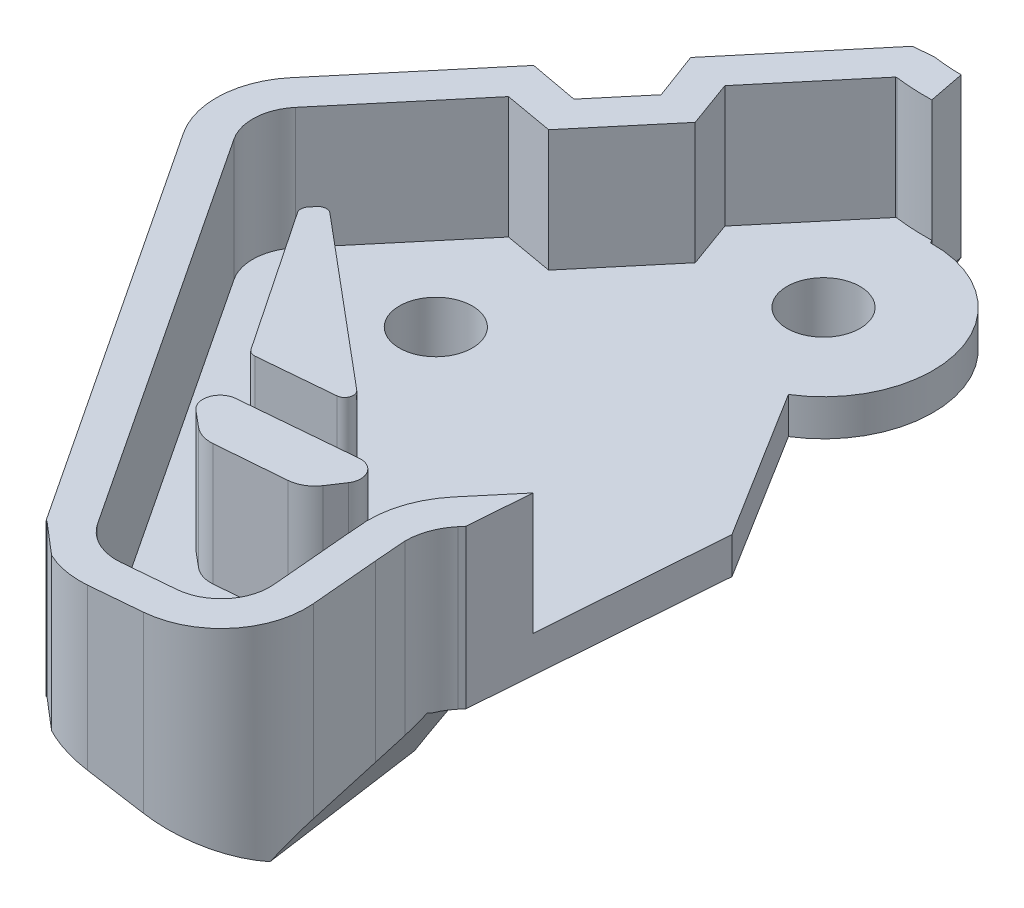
ISO-10303-21;
HEADER;
FILE_DESCRIPTION(('STEP AP214'),'2;1');
FILE_NAME('part.step','',(''),(''),'','','');
FILE_SCHEMA(('AUTOMOTIVE_DESIGN { 1 0 10303 214 1 1 1 1 }'));
ENDSEC;
DATA;
#1=APPLICATION_CONTEXT('core data for automotive mechanical design processes');
#2=APPLICATION_PROTOCOL_DEFINITION('international standard','automotive_design',2000,#1);
#3=PRODUCT_CONTEXT('',#1,'mechanical');
#4=PRODUCT('Part','Part','',(#3));
#5=PRODUCT_RELATED_PRODUCT_CATEGORY('part','',(#4));
#6=PRODUCT_DEFINITION_FORMATION('','',#4);
#7=PRODUCT_DEFINITION_CONTEXT('part definition',#1,'design');
#8=PRODUCT_DEFINITION('design','',#6,#7);
#9=PRODUCT_DEFINITION_SHAPE('','',#8);
#10=(LENGTH_UNIT() NAMED_UNIT(*) SI_UNIT(.MILLI.,.METRE.));
#11=(NAMED_UNIT(*) PLANE_ANGLE_UNIT() SI_UNIT($,.RADIAN.));
#12=(NAMED_UNIT(*) SI_UNIT($,.STERADIAN.) SOLID_ANGLE_UNIT());
#13=UNCERTAINTY_MEASURE_WITH_UNIT(LENGTH_MEASURE(1.E-05),#10,'distance_accuracy_value','');
#14=(GEOMETRIC_REPRESENTATION_CONTEXT(3) GLOBAL_UNCERTAINTY_ASSIGNED_CONTEXT((#13)) GLOBAL_UNIT_ASSIGNED_CONTEXT((#10,
#11,#12)) REPRESENTATION_CONTEXT('',''));
#15=CARTESIAN_POINT('',(0.,0.,0.));
#16=DIRECTION('',(0.,0.,1.));
#17=DIRECTION('',(1.,0.,0.));
#18=AXIS2_PLACEMENT_3D('',#15,#16,#17);
#19=CARTESIAN_POINT('',(-4766.22672796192,-4.49999999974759,-3200.6551043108));
#20=DIRECTION('',(0.834530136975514,0.,-0.550962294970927));
#21=DIRECTION('',(0.550962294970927,0.,0.834530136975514));
#22=AXIS2_PLACEMENT_3D('',#19,#20,#21);
#23=PLANE('',#22);
#24=DIRECTION('',(-0.544435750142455,-0.153463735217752,-0.824644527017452));
#25=VECTOR('',#24,1.);
#26=CARTESIAN_POINT('',(-4726.20864846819,-467.684907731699,-3140.04062367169));
#27=LINE('',#26,#25);
#28=CARTESIAN_POINT('',(-3060.88725645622,1.7303374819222,-617.61594584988));
#29=VERTEX_POINT('',#28);
#30=CARTESIAN_POINT('',(-3068.53489876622,-0.425354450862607,-629.199656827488));
#31=VERTEX_POINT('',#30);
#32=EDGE_CURVE('E608',#29,#31,#27,.T.);
#33=ORIENTED_EDGE('',*,*,#32,.F.);
#34=DIRECTION('',(0.,1.,0.));
#35=VECTOR('',#34,1.);
#36=CARTESIAN_POINT('',(-3060.88725645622,-4.49999999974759,-617.61594584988));
#37=LINE('',#36,#35);
#38=CARTESIAN_POINT('',(-3060.88725645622,8.,-617.61594584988));
#39=VERTEX_POINT('',#38);
#40=EDGE_CURVE('E1387',#29,#39,#37,.T.);
#41=ORIENTED_EDGE('',*,*,#40,.T.);
#42=DIRECTION('',(0.550962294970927,0.,0.834530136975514));
#43=VECTOR('',#42,1.);
#44=CARTESIAN_POINT('',(-4766.22672796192,8.,-3200.6551043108));
#45=LINE('',#44,#43);
#46=CARTESIAN_POINT('',(-3071.78777369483,8.,-634.126712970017));
#47=VERTEX_POINT('',#46);
#48=EDGE_CURVE('E1382',#47,#39,#45,.T.);
#49=ORIENTED_EDGE('',*,*,#48,.F.);
#50=DIRECTION('',(0.,1.,0.));
#51=VECTOR('',#50,1.);
#52=CARTESIAN_POINT('',(-3071.78777369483,-4.49999999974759,-634.126712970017));
#53=LINE('',#52,#51);
#54=CARTESIAN_POINT('',(-3071.78777369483,-0.324513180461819,-634.126712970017));
#55=VERTEX_POINT('',#54);
#56=EDGE_CURVE('E611',#55,#47,#53,.T.);
#57=ORIENTED_EDGE('',*,*,#56,.F.);
#58=DIRECTION('',(0.550881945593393,-0.0170777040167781,0.834408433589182));
#59=VECTOR('',#58,1.);
#60=CARTESIAN_POINT('',(-4765.73560122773,52.188987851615,-3199.91120574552));
#61=LINE('',#60,#59);
#62=EDGE_CURVE('E596',#55,#31,#61,.T.);
#63=ORIENTED_EDGE('',*,*,#62,.T.);
#64=EDGE_LOOP('',(#33,#41,#49,#57,#63));
#65=FACE_BOUND('',#64,.T.);
#66=ADVANCED_FACE('F53',(#65),#23,.F.);
#67=CARTESIAN_POINT('',(-4329.84632053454,-600.462790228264,-3377.01210063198));
#68=DIRECTION('',(-0.152188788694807,-0.948731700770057,0.277032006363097));
#69=DIRECTION('',(-0.168072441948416,-0.251371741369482,-0.953186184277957));
#70=AXIS2_PLACEMENT_3D('',#67,#68,#69);
#71=PLANE('',#70);
#72=DIRECTION('',(-0.718695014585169,0.298643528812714,0.62792477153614));
#73=VECTOR('',#72,1.);
#74=CARTESIAN_POINT('',(-3067.49672745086,-0.856751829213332,-630.106708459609));
#75=LINE('',#74,#73);
#76=CARTESIAN_POINT('',(-3058.72913651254,-4.49999999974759,-637.76696409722));
#77=VERTEX_POINT('',#76);
#78=EDGE_CURVE('E593',#77,#31,#75,.T.);
#79=ORIENTED_EDGE('',*,*,#78,.F.);
#80=DIRECTION('',(0.0967256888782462,-0.293248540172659,-0.951130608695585));
#81=VECTOR('',#80,1.);
#82=CARTESIAN_POINT('',(-3058.72939502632,-4.49921624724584,-637.76442205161));
#83=LINE('',#82,#81);
#84=CARTESIAN_POINT('',(-3060.7887949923,1.74437881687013,-617.513769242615));
#85=VERTEX_POINT('',#84);
#86=EDGE_CURVE('E603',#85,#77,#83,.T.);
#87=ORIENTED_EDGE('',*,*,#86,.F.);
#88=DIRECTION('',(-0.758330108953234,-0.0676734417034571,-0.648348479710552));
#89=VECTOR('',#88,1.);
#90=CARTESIAN_POINT('',(-3060.46904599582,1.77291324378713,-617.240393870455));
#91=LINE('',#90,#89);
#92=CARTESIAN_POINT('',(-3060.79008291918,1.74426388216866,-617.514870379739));
#93=VERTEX_POINT('',#92);
#94=EDGE_CURVE('E991',#85,#93,#91,.T.);
#95=ORIENTED_EDGE('',*,*,#94,.T.);
#96=DIRECTION('',(-0.0661252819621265,0.289442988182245,0.954908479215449));
#97=VECTOR('',#96,1.);
#98=CARTESIAN_POINT('',(-3060.90981457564,2.26835220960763,-615.785837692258));
#99=LINE('',#98,#97);
#100=CARTESIAN_POINT('',(-3060.79252497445,1.75495322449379,-617.479604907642));
#101=VERTEX_POINT('',#100);
#102=EDGE_CURVE('E996',#93,#101,#99,.T.);
#103=ORIENTED_EDGE('',*,*,#102,.T.);
#104=CARTESIAN_POINT('',(-3057.96640097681,0.698706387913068,-619.544313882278));
#105=DIRECTION('',(0.152188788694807,0.948731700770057,-0.277032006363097));
#106=DIRECTION('',(-0.456799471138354,0.316082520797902,0.831520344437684));
#107=AXIS2_PLACEMENT_3D('',#104,#105,#106);
#108=ELLIPSE('',#107,3.68913571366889,3.50000000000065);
#109=EDGE_CURVE('E68',#29,#101,#108,.T.);
#110=ORIENTED_EDGE('',*,*,#109,.F.);
#111=ORIENTED_EDGE('',*,*,#32,.T.);
#112=EDGE_LOOP('',(#79,#87,#95,#103,#110,#111));
#113=FACE_BOUND('',#112,.T.);
#114=ADVANCED_FACE('F615',(#113),#71,.T.);
#115=CARTESIAN_POINT('',(-3050.20855560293,8.,-624.152011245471));
#116=DIRECTION('',(0.,1.,0.));
#117=DIRECTION('',(1.84513515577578E-12,0.,1.));
#118=AXIS2_PLACEMENT_3D('',#115,#116,#117);
#119=PLANE('',#118);
#120=CARTESIAN_POINT('',(-3057.96640097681,8.,-619.544313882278));
#121=DIRECTION('',(0.,-1.,0.));
#122=DIRECTION('',(-0.984807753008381,0.,0.173648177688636));
#123=AXIS2_PLACEMENT_3D('',#120,#121,#122);
#124=CIRCLE('',#123,3.50000000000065);
#125=CARTESIAN_POINT('',(-3060.79252497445,8.,-617.479604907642));
#126=VERTEX_POINT('',#125);
#127=EDGE_CURVE('E1419',#126,#39,#124,.T.);
#128=ORIENTED_EDGE('',*,*,#127,.F.);
#129=DIRECTION('',(0.0690823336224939,0.,-0.997610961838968));
#130=VECTOR('',#129,1.);
#131=CARTESIAN_POINT('',(-3060.79008291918,8.,-617.514870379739));
#132=LINE('',#131,#130);
#133=CARTESIAN_POINT('',(-3060.79008291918,8.,-617.514870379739));
#134=VERTEX_POINT('',#133);
#135=EDGE_CURVE('E998',#126,#134,#132,.T.);
#136=ORIENTED_EDGE('',*,*,#135,.T.);
#137=DIRECTION('',(0.760072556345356,0.,0.649838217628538));
#138=VECTOR('',#137,1.);
#139=CARTESIAN_POINT('',(-3060.79008291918,8.,-617.514870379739));
#140=LINE('',#139,#138);
#141=CARTESIAN_POINT('',(-3059.4634430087,8.,-616.38063482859));
#142=VERTEX_POINT('',#141);
#143=EDGE_CURVE('E994',#134,#142,#140,.T.);
#144=ORIENTED_EDGE('',*,*,#143,.T.);
#145=CARTESIAN_POINT('',(-3057.66135587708,8.,-616.057632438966));
#146=VERTEX_POINT('',#145);
#147=EDGE_CURVE('E1401',#146,#142,#124,.T.);
#148=ORIENTED_EDGE('',*,*,#147,.F.);
#149=DIRECTION('',(0.996194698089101,0.,-0.0871557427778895));
#150=VECTOR('',#149,1.);
#151=CARTESIAN_POINT('',(-3969.65155326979,8.,-536.268828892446));
#152=LINE('',#151,#150);
#153=CARTESIAN_POINT('',(-3055.53954911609,8.,-616.24326647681));
#154=VERTEX_POINT('',#153);
#155=EDGE_CURVE('E1415',#146,#154,#152,.T.);
#156=ORIENTED_EDGE('',*,*,#155,.T.);
#157=CARTESIAN_POINT('',(-3055.84459421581,8.,-619.729947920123));
#158=DIRECTION('',(0.,-1.,0.));
#159=DIRECTION('',(-0.984807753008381,0.,0.173648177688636));
#160=AXIS2_PLACEMENT_3D('',#157,#158,#159);
#161=CIRCLE('',#160,3.50000000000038);
#162=CARTESIAN_POINT('',(-3052.3579127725,8.,-620.034993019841));
#163=VERTEX_POINT('',#162);
#164=EDGE_CURVE('E1416',#163,#154,#161,.T.);
#165=ORIENTED_EDGE('',*,*,#164,.F.);
#166=DIRECTION('',(-0.0871557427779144,0.,-0.996194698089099));
#167=VECTOR('',#166,1.);
#168=CARTESIAN_POINT('',(-3315.92566674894,8.,-3632.62820523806));
#169=LINE('',#168,#167);
#170=CARTESIAN_POINT('',(-3052.60299393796,8.,-622.836283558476));
#171=VERTEX_POINT('',#170);
#172=EDGE_CURVE('E657',#163,#171,#169,.T.);
#173=ORIENTED_EDGE('',*,*,#172,.T.);
#174=DIRECTION('',(0.64278761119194,0.,-0.766044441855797));
#175=VECTOR('',#174,1.);
#176=CARTESIAN_POINT('',(-2098.0279722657,8.,-1760.4544904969));
#177=LINE('',#176,#175);
#178=CARTESIAN_POINT('',(-3052.60291319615,8.,-622.836379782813));
#179=VERTEX_POINT('',#178);
#180=EDGE_CURVE('E649',#171,#179,#177,.T.);
#181=ORIENTED_EDGE('',*,*,#180,.T.);
#182=DIRECTION('',(-0.08045383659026,0.,-0.996758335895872));
#183=VECTOR('',#182,1.);
#184=CARTESIAN_POINT('',(-3295.17328275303,8.,-3628.08818807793));
#185=LINE('',#184,#183);
#186=CARTESIAN_POINT('',(-3052.70854600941,8.,-624.145085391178));
#187=VERTEX_POINT('',#186);
#188=EDGE_CURVE('E1425',#179,#187,#185,.T.);
#189=ORIENTED_EDGE('',*,*,#188,.T.);
#190=CARTESIAN_POINT('',(-3050.20855560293,8.,-624.152011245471));
#191=DIRECTION('',(0.,-1.,0.));
#192=DIRECTION('',(-0.984807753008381,0.,0.173648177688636));
#193=AXIS2_PLACEMENT_3D('',#190,#191,#192);
#194=CIRCLE('',#193,2.49999999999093);
#195=CARTESIAN_POINT('',(-3052.12366671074,8.,-625.758980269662));
#196=VERTEX_POINT('',#195);
#197=EDGE_CURVE('E1428',#187,#196,#194,.T.);
#198=ORIENTED_EDGE('',*,*,#197,.T.);
#199=DIRECTION('',(0.642787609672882,0.,-0.766044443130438));
#200=VECTOR('',#199,1.);
#201=CARTESIAN_POINT('',(-2099.18583739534,8.,-1761.42606191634));
#202=LINE('',#201,#200);
#203=CARTESIAN_POINT('',(-3051.97734479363,8.,-625.933359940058));
#204=VERTEX_POINT('',#203);
#205=EDGE_CURVE('E1431',#196,#204,#202,.T.);
#206=ORIENTED_EDGE('',*,*,#205,.T.);
#207=DIRECTION('',(-0.0747171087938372,0.,0.997204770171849));
#208=VECTOR('',#207,1.);
#209=CARTESIAN_POINT('',(-3052.19819873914,8.,-622.985753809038));
#210=LINE('',#209,#208);
#211=CARTESIAN_POINT('',(-3051.78535361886,8.,-628.49575185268));
#212=VERTEX_POINT('',#211);
#213=EDGE_CURVE('E823',#212,#204,#210,.T.);
#214=ORIENTED_EDGE('',*,*,#213,.F.);
#215=DIRECTION('',(-0.642787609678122,0.,0.766044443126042));
#216=VECTOR('',#215,1.);
#217=CARTESIAN_POINT('',(-3051.12380070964,8.,-629.284159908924));
#218=LINE('',#217,#216);
#219=CARTESIAN_POINT('',(-3053.27273337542,8.,-626.72316168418));
#220=VERTEX_POINT('',#219);
#221=EDGE_CURVE('E1146',#212,#220,#218,.T.);
#222=ORIENTED_EDGE('',*,*,#221,.T.);
#223=CARTESIAN_POINT('',(-3050.20855560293,8.,-624.152011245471));
#224=DIRECTION('',(0.,1.,0.));
#225=DIRECTION('',(1.84513515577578E-12,0.,1.));
#226=AXIS2_PLACEMENT_3D('',#223,#224,#225);
#227=CIRCLE('',#226,3.99999999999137);
#228=CARTESIAN_POINT('',(-3054.2078287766,8.,-624.075761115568));
#229=VERTEX_POINT('',#228);
#230=EDGE_CURVE('E1166',#220,#229,#227,.T.);
#231=ORIENTED_EDGE('',*,*,#230,.T.);
#232=CARTESIAN_POINT('',(-3054.2078287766,8.,-624.075761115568));
#233=DIRECTION('',(0.080453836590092,0.,0.996758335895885));
#234=VECTOR('',#233,1.);
#235=LINE('',#232,#234);
#236=CARTESIAN_POINT('',(-3054.20486299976,8.,-624.039017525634));
#237=VERTEX_POINT('',#236);
#238=EDGE_CURVE('E1241',#229,#237,#235,.T.);
#239=ORIENTED_EDGE('',*,*,#238,.T.);
#240=DIRECTION('',(-0.0804538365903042,0.,-0.996758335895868));
#241=VECTOR('',#240,1.);
#242=CARTESIAN_POINT('',(-3054.09658235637,8.,-622.697507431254));
#243=LINE('',#242,#241);
#244=CARTESIAN_POINT('',(-3054.14756351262,8.,-623.329122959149));
#245=VERTEX_POINT('',#244);
#246=EDGE_CURVE('E828',#245,#237,#243,.T.);
#247=ORIENTED_EDGE('',*,*,#246,.F.);
#248=DIRECTION('',(-0.642787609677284,0.,0.766044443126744));
#249=VECTOR('',#248,1.);
#250=CARTESIAN_POINT('',(-3054.15143762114,8.,-623.324505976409));
#251=LINE('',#250,#249);
#252=CARTESIAN_POINT('',(-3054.15143762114,8.,-623.324505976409));
#253=VERTEX_POINT('',#252);
#254=EDGE_CURVE('E1049',#245,#253,#251,.T.);
#255=ORIENTED_EDGE('',*,*,#254,.T.);
#256=DIRECTION('',(0.0871557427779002,0.,0.9961946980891));
#257=VECTOR('',#256,1.);
#258=CARTESIAN_POINT('',(-3053.85220481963,8.,-619.904259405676));
#259=LINE('',#258,#257);
#260=CARTESIAN_POINT('',(-3053.85220481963,8.,-619.904259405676));
#261=VERTEX_POINT('',#260);
#262=EDGE_CURVE('E1034',#253,#261,#259,.T.);
#263=ORIENTED_EDGE('',*,*,#262,.T.);
#264=CARTESIAN_POINT('',(-3055.84459421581,8.,-619.729947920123));
#265=DIRECTION('',(0.,-1.,0.));
#266=DIRECTION('',(0.984807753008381,0.,-0.173648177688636));
#267=AXIS2_PLACEMENT_3D('',#264,#265,#266);
#268=CIRCLE('',#267,2.00000000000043);
#269=CARTESIAN_POINT('',(-3055.67028273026,8.,-617.737558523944));
#270=VERTEX_POINT('',#269);
#271=EDGE_CURVE('E1029',#261,#270,#268,.T.);
#272=ORIENTED_EDGE('',*,*,#271,.T.);
#273=DIRECTION('',(-0.996194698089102,0.,0.0871557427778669));
#274=VECTOR('',#273,1.);
#275=CARTESIAN_POINT('',(-3057.79208949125,8.,-617.551924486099));
#276=LINE('',#275,#274);
#277=CARTESIAN_POINT('',(-3057.79208949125,8.,-617.551924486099));
#278=VERTEX_POINT('',#277);
#279=EDGE_CURVE('E1024',#270,#278,#276,.T.);
#280=ORIENTED_EDGE('',*,*,#279,.T.);
#281=CARTESIAN_POINT('',(-3057.96640097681,8.,-619.544313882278));
#282=DIRECTION('',(0.,-1.,0.));
#283=DIRECTION('',(0.984807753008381,0.,-0.173648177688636));
#284=AXIS2_PLACEMENT_3D('',#281,#282,#283);
#285=CIRCLE('',#284,2.00000000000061);
#286=CARTESIAN_POINT('',(-3059.63546125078,8.,-618.442389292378));
#287=VERTEX_POINT('',#286);
#288=EDGE_CURVE('E1019',#278,#287,#285,.T.);
#289=ORIENTED_EDGE('',*,*,#288,.T.);
#290=DIRECTION('',(-0.550962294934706,0.,-0.834530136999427));
#291=VECTOR('',#290,1.);
#292=CARTESIAN_POINT('',(-3070.40292478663,8.,-634.751622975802));
#293=LINE('',#292,#291);
#294=CARTESIAN_POINT('',(-3070.53597848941,8.,-634.953156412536));
#295=VERTEX_POINT('',#294);
#296=EDGE_CURVE('E1072',#287,#295,#293,.T.);
#297=ORIENTED_EDGE('',*,*,#296,.T.);
#298=CARTESIAN_POINT('',(-3068.86691821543,8.,-636.055081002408));
#299=DIRECTION('',(0.,-1.,0.));
#300=DIRECTION('',(1.84513515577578E-12,0.,1.));
#301=AXIS2_PLACEMENT_3D('',#298,#299,#300);
#302=CIRCLE('',#301,1.99999999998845);
#303=CARTESIAN_POINT('',(-3070.39900710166,8.,-637.340656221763));
#304=VERTEX_POINT('',#303);
#305=EDGE_CURVE('E1136',#295,#304,#302,.T.);
#306=ORIENTED_EDGE('',*,*,#305,.T.);
#307=DIRECTION('',(0.642787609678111,0.,-0.766044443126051));
#308=VECTOR('',#307,1.);
#309=CARTESIAN_POINT('',(-3070.39900710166,8.,-637.340656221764));
#310=LINE('',#309,#308);
#311=CARTESIAN_POINT('',(-3066.40200615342,8.,-642.104096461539));
#312=VERTEX_POINT('',#311);
#313=EDGE_CURVE('E1131',#304,#312,#310,.T.);
#314=ORIENTED_EDGE('',*,*,#313,.T.);
#315=DIRECTION('',(0.984807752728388,0.,0.173648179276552));
#316=VECTOR('',#315,1.);
#317=CARTESIAN_POINT('',(-3066.40200615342,8.,-642.104096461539));
#318=LINE('',#317,#316);
#319=CARTESIAN_POINT('',(-3064.39577117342,8.,-641.750343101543));
#320=VERTEX_POINT('',#319);
#321=EDGE_CURVE('E1127',#312,#320,#318,.T.);
#322=ORIENTED_EDGE('',*,*,#321,.T.);
#323=DIRECTION('',(0.642787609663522,0.,-0.766044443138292));
#324=VECTOR('',#323,1.);
#325=CARTESIAN_POINT('',(-3064.39577117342,8.,-641.750343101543));
#326=LINE('',#325,#324);
#327=CARTESIAN_POINT('',(-3061.64687446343,8.,-645.026350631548));
#328=VERTEX_POINT('',#327);
#329=EDGE_CURVE('E1123',#320,#328,#326,.T.);
#330=ORIENTED_EDGE('',*,*,#329,.T.);
#331=DIRECTION('',(-0.342020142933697,0.,-0.939692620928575));
#332=VECTOR('',#331,1.);
#333=CARTESIAN_POINT('',(-3061.64687446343,8.,-645.026350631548));
#334=LINE('',#333,#332);
#335=CARTESIAN_POINT('',(-3062.34363256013,8.,-646.940677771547));
#336=VERTEX_POINT('',#335);
#337=EDGE_CURVE('E1118',#328,#336,#334,.T.);
#338=ORIENTED_EDGE('',*,*,#337,.T.);
#339=DIRECTION('',(0.642787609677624,0.,-0.766044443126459));
#340=VECTOR('',#339,1.);
#341=CARTESIAN_POINT('',(-3062.34363256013,8.,-646.940677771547));
#342=LINE('',#341,#340);
#343=CARTESIAN_POINT('',(-3059.13895028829,8.,-650.759869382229));
#344=VERTEX_POINT('',#343);
#345=EDGE_CURVE('E1113',#336,#344,#342,.T.);
#346=ORIENTED_EDGE('',*,*,#345,.T.);
#347=DIRECTION('',(0.995965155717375,0.,-0.0897407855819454));
#348=VECTOR('',#347,1.);
#349=CARTESIAN_POINT('',(-3059.13895028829,8.,-650.759869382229));
#350=LINE('',#349,#348);
#351=CARTESIAN_POINT('',(-3059.08361338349,8.,-650.764855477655));
#352=VERTEX_POINT('',#351);
#353=EDGE_CURVE('E1079',#344,#352,#350,.T.);
#354=ORIENTED_EDGE('',*,*,#353,.T.);
#355=CARTESIAN_POINT('',(-3057.84215895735,8.,-660.407925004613));
#356=DIRECTION('',(0.,1.,0.));
#357=DIRECTION('',(0.984807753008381,0.,-0.173648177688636));
#358=AXIS2_PLACEMENT_3D('',#355,#356,#357);
#359=CIRCLE('',#358,9.72265390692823);
#360=CARTESIAN_POINT('',(-3057.58092938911,8.,-650.68878110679));
#361=VERTEX_POINT('',#360);
#362=EDGE_CURVE('E1063',#352,#361,#359,.T.);
#363=ORIENTED_EDGE('',*,*,#362,.T.);
#364=DIRECTION('',(-0.190734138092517,0.,-0.981641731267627));
#365=VECTOR('',#364,1.);
#366=CARTESIAN_POINT('',(-3058.25325190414,8.,-654.14898935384));
#367=LINE('',#366,#365);
#368=CARTESIAN_POINT('',(-3057.87170946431,8.,-652.185324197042));
#369=VERTEX_POINT('',#368);
#370=EDGE_CURVE('E1085',#361,#369,#367,.T.);
#371=ORIENTED_EDGE('',*,*,#370,.T.);
#372=CARTESIAN_POINT('',(-3057.84215895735,8.,-660.407925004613));
#373=DIRECTION('',(0.,-1.,0.));
#374=DIRECTION('',(-0.984807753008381,0.,0.173648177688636));
#375=AXIS2_PLACEMENT_3D('',#372,#373,#374);
#376=CIRCLE('',#375,8.22265390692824);
#377=CARTESIAN_POINT('',(-3059.04788275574,8.,-652.274151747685));
#378=VERTEX_POINT('',#377);
#379=EDGE_CURVE('E1434',#369,#378,#376,.T.);
#380=ORIENTED_EDGE('',*,*,#379,.T.);
#381=DIRECTION('',(-0.995965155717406,0.,0.0897407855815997));
#382=VECTOR('',#381,1.);
#383=CARTESIAN_POINT('',(-3964.86093149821,8.,-570.656462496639));
#384=LINE('',#383,#382);
#385=CARTESIAN_POINT('',(-3059.89010493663,8.,-652.198263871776));
#386=VERTEX_POINT('',#385);
#387=EDGE_CURVE('E1437',#378,#386,#384,.T.);
#388=ORIENTED_EDGE('',*,*,#387,.T.);
#389=DIRECTION('',(-0.642787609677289,0.,0.766044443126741));
#390=VECTOR('',#389,1.);
#391=CARTESIAN_POINT('',(-3067.55107281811,8.,-643.068277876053));
#392=LINE('',#391,#390);
#393=CARTESIAN_POINT('',(-3064.04936962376,8.,-647.241445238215));
#394=VERTEX_POINT('',#393);
#395=EDGE_CURVE('E1143',#386,#394,#392,.T.);
#396=ORIENTED_EDGE('',*,*,#395,.T.);
#397=DIRECTION('',(-0.342020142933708,0.,-0.939692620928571));
#398=VECTOR('',#397,1.);
#399=CARTESIAN_POINT('',(-3061.01768759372,8.,-638.911967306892));
#400=LINE('',#399,#398);
#401=CARTESIAN_POINT('',(-3064.04218405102,8.,-647.221703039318));
#402=VERTEX_POINT('',#401);
#403=EDGE_CURVE('E1097',#402,#394,#400,.T.);
#404=ORIENTED_EDGE('',*,*,#403,.F.);
#405=DIRECTION('',(0.348840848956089,0.,0.937181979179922));
#406=VECTOR('',#405,1.);
#407=CARTESIAN_POINT('',(-3064.04218405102,8.,-647.221703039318));
#408=LINE('',#407,#406);
#409=CARTESIAN_POINT('',(-3063.32987395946,8.,-645.308039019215));
#410=VERTEX_POINT('',#409);
#411=EDGE_CURVE('E1036',#402,#410,#408,.T.);
#412=ORIENTED_EDGE('',*,*,#411,.T.);
#413=DIRECTION('',(0.642787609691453,0.,-0.766044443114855));
#414=VECTOR('',#413,1.);
#415=CARTESIAN_POINT('',(-3064.96542987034,8.,-643.35885938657));
#416=LINE('',#415,#414);
#417=CARTESIAN_POINT('',(-3064.96542987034,8.,-643.35885938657));
#418=VERTEX_POINT('',#417);
#419=EDGE_CURVE('E1094',#418,#410,#416,.T.);
#420=ORIENTED_EDGE('',*,*,#419,.F.);
#421=DIRECTION('',(-0.983533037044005,0.,-0.180728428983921));
#422=VECTOR('',#421,1.);
#423=CARTESIAN_POINT('',(-3064.96542987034,8.,-643.35885938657));
#424=LINE('',#423,#422);
#425=CARTESIAN_POINT('',(-3066.97382410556,8.,-643.727910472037));
#426=VERTEX_POINT('',#425);
#427=EDGE_CURVE('E1041',#418,#426,#424,.T.);
#428=ORIENTED_EDGE('',*,*,#427,.T.);
#429=DIRECTION('',(-0.64278760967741,0.,0.766044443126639));
#430=VECTOR('',#429,1.);
#431=CARTESIAN_POINT('',(-3064.03116873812,8.,-647.234830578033));
#432=LINE('',#431,#430);
#433=CARTESIAN_POINT('',(-3066.97371238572,8.,-643.728043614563));
#434=VERTEX_POINT('',#433);
#435=EDGE_CURVE('E1078',#434,#426,#432,.T.);
#436=ORIENTED_EDGE('',*,*,#435,.F.);
#437=DIRECTION('',(-0.984807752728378,0.,-0.173648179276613));
#438=VECTOR('',#437,1.);
#439=CARTESIAN_POINT('',(-3066.14153388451,8.,-643.581308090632));
#440=LINE('',#439,#438);
#441=CARTESIAN_POINT('',(-3066.99440241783,8.,-643.731691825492));
#442=VERTEX_POINT('',#441);
#443=EDGE_CURVE('E1102',#434,#442,#440,.T.);
#444=ORIENTED_EDGE('',*,*,#443,.T.);
#445=DIRECTION('',(-0.642787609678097,0.,0.766044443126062));
#446=VECTOR('',#445,1.);
#447=CARTESIAN_POINT('',(-2116.76217617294,8.,-1776.17436127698));
#448=LINE('',#447,#446);
#449=CARTESIAN_POINT('',(-3071.54807376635,8.,-638.304837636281));
#450=VERTEX_POINT('',#449);
#451=EDGE_CURVE('E1439',#442,#450,#448,.T.);
#452=ORIENTED_EDGE('',*,*,#451,.T.);
#453=CARTESIAN_POINT('',(-3068.86691821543,8.,-636.055081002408));
#454=DIRECTION('',(0.,-1.,0.));
#455=DIRECTION('',(-0.984807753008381,0.,0.173648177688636));
#456=AXIS2_PLACEMENT_3D('',#453,#454,#455);
#457=CIRCLE('',#456,3.49999999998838);
#458=EDGE_CURVE('E1442',#47,#450,#457,.T.);
#459=ORIENTED_EDGE('',*,*,#458,.F.);
#460=ORIENTED_EDGE('',*,*,#48,.T.);
#461=EDGE_LOOP('',(#128,#136,#144,#148,#156,#165,#173,#181,#189,#198,#206,#214,#222,#231,#239,
#247,#255,#263,#272,#280,#289,#297,#306,#314,#322,#330,#338,#346,#354,#363,#371,#380,#388,#396,
#404,#412,#420,#428,#436,#444,#452,#459,#460));
#462=FACE_BOUND('',#461,.T.);
#463=ADVANCED_FACE('F1253',(#462),#119,.T.);
#464=CARTESIAN_POINT('',(-3792.847460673,-308.438525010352,-3629.15671156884));
#465=DIRECTION('',(0.811035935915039,-0.567660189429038,-0.141359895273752));
#466=DIRECTION('',(0.559036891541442,0.823262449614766,-0.0985732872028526));
#467=AXIS2_PLACEMENT_3D('',#464,#465,#466);
#468=PLANE('',#467);
#469=DIRECTION('',(0.298058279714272,0.193055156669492,0.93482135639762));
#470=VECTOR('',#469,1.);
#471=CARTESIAN_POINT('',(-3974.93106839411,-597.932625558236,-3511.31616902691));
#472=LINE('',#471,#470);
#473=CARTESIAN_POINT('',(-3055.36234158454,-2.31929519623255,-627.207445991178));
#474=VERTEX_POINT('',#473);
#475=CARTESIAN_POINT('',(-3052.57773911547,-0.515681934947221,-618.473899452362));
#476=VERTEX_POINT('',#475);
#477=EDGE_CURVE('E929',#474,#476,#472,.T.);
#478=ORIENTED_EDGE('',*,*,#477,.F.);
#479=CARTESIAN_POINT('',(-3056.02510191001,-2.5375964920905,-630.133321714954));
#480=DIRECTION('',(-0.811035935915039,0.567660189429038,0.141359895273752));
#481=DIRECTION('',(-0.559229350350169,-0.823262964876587,0.0974711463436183));
#482=AXIS2_PLACEMENT_3D('',#479,#480,#481);
#483=ELLIPSE('',#482,5.28485184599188,3.00000000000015);
#484=CARTESIAN_POINT('',(-3055.35930360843,-2.31478295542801,-627.208135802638));
#485=VERTEX_POINT('',#484);
#486=EDGE_CURVE('E1224',#485,#474,#483,.F.);
#487=ORIENTED_EDGE('',*,*,#486,.F.);
#488=DIRECTION('',(-0.298297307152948,-0.193435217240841,-0.934666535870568));
#489=VECTOR('',#488,1.);
#490=CARTESIAN_POINT('',(-3975.61446668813,-599.067596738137,-3510.67937328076));
#491=LINE('',#490,#489);
#492=CARTESIAN_POINT('',(-3052.57449204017,-0.508931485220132,-618.482377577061));
#493=VERTEX_POINT('',#492);
#494=EDGE_CURVE('E908',#493,#485,#491,.T.);
#495=ORIENTED_EDGE('',*,*,#494,.F.);
#496=CARTESIAN_POINT('',(-3055.84459421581,-4.87036815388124,-619.729947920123));
#497=DIRECTION('',(-0.811035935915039,0.567660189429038,0.141359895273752));
#498=DIRECTION('',(0.559229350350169,0.823262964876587,-0.0974711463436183));
#499=AXIS2_PLACEMENT_3D('',#496,#497,#498);
#500=ELLIPSE('',#499,6.16566048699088,3.50000000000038);
#501=EDGE_CURVE('E667',#476,#493,#500,.T.);
#502=ORIENTED_EDGE('',*,*,#501,.F.);
#503=EDGE_LOOP('',(#478,#487,#495,#502));
#504=FACE_BOUND('',#503,.T.);
#505=ADVANCED_FACE('F55',(#504),#468,.T.);
#506=CARTESIAN_POINT('',(-3060.79008291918,8.,-617.514870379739));
#507=DIRECTION('',(-0.649838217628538,0.,0.760072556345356));
#508=DIRECTION('',(-0.760072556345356,0.,-0.649838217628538));
#509=AXIS2_PLACEMENT_3D('',#506,#507,#508);
#510=PLANE('',#509);
#511=ORIENTED_EDGE('',*,*,#143,.F.);
#512=DIRECTION('',(0.,-1.,0.));
#513=VECTOR('',#512,1.);
#514=CARTESIAN_POINT('',(-3060.79008291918,8.,-617.514870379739));
#515=LINE('',#514,#513);
#516=EDGE_CURVE('E999',#134,#93,#515,.T.);
#517=ORIENTED_EDGE('',*,*,#516,.T.);
#518=ORIENTED_EDGE('',*,*,#94,.F.);
#519=DIRECTION('',(0.168390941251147,0.975149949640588,0.143968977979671));
#520=VECTOR('',#519,1.);
#521=CARTESIAN_POINT('',(-3059.76164506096,7.6925919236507,-616.635588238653));
#522=LINE('',#521,#520);
#523=CARTESIAN_POINT('',(-3060.78782431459,1.75000000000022,-617.512939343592));
#524=VERTEX_POINT('',#523);
#525=EDGE_CURVE('E1012',#85,#524,#522,.T.);
#526=ORIENTED_EDGE('',*,*,#525,.T.);
#527=DIRECTION('',(0.760072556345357,0.,0.649838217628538));
#528=VECTOR('',#527,1.);
#529=CARTESIAN_POINT('',(-3060.79008291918,1.75000000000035,-617.514870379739));
#530=LINE('',#529,#528);
#531=CARTESIAN_POINT('',(-3060.72580554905,1.75000000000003,-617.45991524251));
#532=VERTEX_POINT('',#531);
#533=EDGE_CURVE('E1011',#524,#532,#530,.T.);
#534=ORIENTED_EDGE('',*,*,#533,.T.);
#535=CARTESIAN_POINT('',(-3060.45768481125,1.77392711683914,-617.230680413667));
#536=VERTEX_POINT('',#535);
#537=EDGE_CURVE('E995',#536,#532,#91,.T.);
#538=ORIENTED_EDGE('',*,*,#537,.F.);
#539=DIRECTION('',(-0.111681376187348,-0.989146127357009,-0.0954840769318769));
#540=VECTOR('',#539,1.);
#541=CARTESIAN_POINT('',(-3059.7770719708,7.80201862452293,-616.648777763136));
#542=LINE('',#541,#540);
#543=CARTESIAN_POINT('',(-3060.46038634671,1.75000000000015,-617.232990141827));
#544=VERTEX_POINT('',#543);
#545=EDGE_CURVE('E988',#536,#544,#542,.T.);
#546=ORIENTED_EDGE('',*,*,#545,.T.);
#547=DIRECTION('',(-0.760072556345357,0.,-0.649838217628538));
#548=VECTOR('',#547,1.);
#549=CARTESIAN_POINT('',(-3060.79008291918,1.75000000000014,-617.514870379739));
#550=LINE('',#549,#548);
#551=CARTESIAN_POINT('',(-3059.4634430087,1.75000000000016,-616.38063482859));
#552=VERTEX_POINT('',#551);
#553=EDGE_CURVE('E932',#552,#544,#550,.T.);
#554=ORIENTED_EDGE('',*,*,#553,.F.);
#555=DIRECTION('',(0.,1.,0.));
#556=VECTOR('',#555,1.);
#557=CARTESIAN_POINT('',(-3059.4634430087,-4.49999999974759,-616.38063482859));
#558=LINE('',#557,#556);
#559=EDGE_CURVE('E675',#142,#552,#558,.F.);
#560=ORIENTED_EDGE('',*,*,#559,.F.);
#561=EDGE_LOOP('',(#511,#517,#518,#526,#534,#538,#546,#554,#560));
#562=FACE_BOUND('',#561,.T.);
#563=ADVANCED_FACE('F1404',(#562),#510,.T.);
#564=CARTESIAN_POINT('',(-4139.35427843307,329.009951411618,-3549.61315793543));
#565=DIRECTION('',(-0.275164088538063,-0.961364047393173,-0.00799329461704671));
#566=DIRECTION('',(0.948228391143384,-0.270014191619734,-0.167198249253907));
#567=AXIS2_PLACEMENT_3D('',#564,#565,#566);
#568=PLANE('',#567);
#569=DIRECTION('',(0.632882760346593,-0.174874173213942,-0.754240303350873));
#570=VECTOR('',#569,1.);
#571=CARTESIAN_POINT('',(-2146.05192941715,-256.553716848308,-1741.26819262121));
#572=LINE('',#571,#570);
#573=CARTESIAN_POINT('',(-3071.54807376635,-0.82645866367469,-638.304837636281));
#574=VERTEX_POINT('',#573);
#575=CARTESIAN_POINT('',(-3066.99440241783,-2.08470041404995,-643.731691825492));
#576=VERTEX_POINT('',#575);
#577=EDGE_CURVE('E670',#574,#576,#572,.T.);
#578=ORIENTED_EDGE('',*,*,#577,.T.);
#579=DIRECTION('',(-0.947513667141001,0.272588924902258,-0.167072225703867));
#580=VECTOR('',#579,1.);
#581=CARTESIAN_POINT('',(-3068.80959993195,-1.56248869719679,-644.051760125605));
#582=LINE('',#581,#580);
#583=CARTESIAN_POINT('',(-3066.97371238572,-2.09065270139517,-643.728043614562));
#584=VERTEX_POINT('',#583);
#585=EDGE_CURVE('E1103',#584,#576,#582,.T.);
#586=ORIENTED_EDGE('',*,*,#585,.F.);
#587=DIRECTION('',(-0.632882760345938,0.174874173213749,0.754240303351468));
#588=VECTOR('',#587,1.);
#589=CARTESIAN_POINT('',(-3065.23793606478,-2.57027146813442,-645.796661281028));
#590=LINE('',#589,#588);
#591=CARTESIAN_POINT('',(-3066.97382410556,-2.09062183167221,-643.727910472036));
#592=VERTEX_POINT('',#591);
#593=EDGE_CURVE('E1084',#584,#592,#590,.T.);
#594=ORIENTED_EDGE('',*,*,#593,.T.);
#595=DIRECTION('',(0.946363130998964,-0.272316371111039,0.173898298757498));
#596=VECTOR('',#595,1.);
#597=CARTESIAN_POINT('',(-3067.71482067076,-1.87739977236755,-643.864071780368));
#598=LINE('',#597,#596);
#599=CARTESIAN_POINT('',(-3064.96542987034,-2.66853807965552,-643.35885938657));
#600=VERTEX_POINT('',#599);
#601=EDGE_CURVE('E1044',#592,#600,#598,.T.);
#602=ORIENTED_EDGE('',*,*,#601,.T.);
#603=DIRECTION('',(0.632882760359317,-0.174874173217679,-0.75424030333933));
#604=VECTOR('',#603,1.);
#605=CARTESIAN_POINT('',(-3066.14616871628,-2.34228376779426,-641.951709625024));
#606=LINE('',#605,#604);
#607=CARTESIAN_POINT('',(-3064.08348246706,-2.91223222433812,-644.409923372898));
#608=VERTEX_POINT('',#607);
#609=EDGE_CURVE('E1091',#600,#608,#606,.T.);
#610=ORIENTED_EDGE('',*,*,#609,.T.);
#611=DIRECTION('',(-0.616956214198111,0.182951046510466,-0.76543709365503));
#612=VECTOR('',#611,1.);
#613=CARTESIAN_POINT('',(-4882.79071012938,536.403821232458,-2900.81960450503));
#614=LINE('',#613,#612);
#615=EDGE_CURVE('E1039',#77,#608,#614,.T.);
#616=ORIENTED_EDGE('',*,*,#615,.F.);
#617=DIRECTION('',(-0.959543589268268,0.274107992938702,0.0643498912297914));
#618=VECTOR('',#617,1.);
#619=CARTESIAN_POINT('',(-3961.47794609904,253.383713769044,-577.225902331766));
#620=LINE('',#619,#618);
#621=CARTESIAN_POINT('',(-3061.69630123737,-3.65238497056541,-637.567977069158));
#622=VERTEX_POINT('',#621);
#623=EDGE_CURVE('E599',#77,#622,#620,.T.);
#624=ORIENTED_EDGE('',*,*,#623,.T.);
#625=CARTESIAN_POINT('',(-3064.69190543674,-2.79632524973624,-637.405633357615));
#626=DIRECTION('',(0.275164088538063,0.961364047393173,0.00799329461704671));
#627=DIRECTION('',(0.960958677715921,-0.275280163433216,0.0279150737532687));
#628=AXIS2_PLACEMENT_3D('',#625,#626,#627);
#629=ELLIPSE('',#628,3.1205660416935,3.00000000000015);
#630=CARTESIAN_POINT('',(-3067.68236215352,-1.94237704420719,-637.166533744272));
#631=VERTEX_POINT('',#630);
#632=EDGE_CURVE('E1230',#631,#622,#629,.F.);
#633=ORIENTED_EDGE('',*,*,#632,.F.);
#634=CARTESIAN_POINT('',(-3072.27342489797,-0.630871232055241,-636.858643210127));
#635=VERTEX_POINT('',#634);
#636=EDGE_CURVE('E982',#631,#635,#620,.T.);
#637=ORIENTED_EDGE('',*,*,#636,.T.);
#638=CARTESIAN_POINT('',(-3068.86691821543,-1.61257157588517,-636.055081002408));
#639=DIRECTION('',(0.275164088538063,0.961364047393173,0.00799329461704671));
#640=DIRECTION('',(-0.960958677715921,0.275280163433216,-0.0279150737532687));
#641=AXIS2_PLACEMENT_3D('',#638,#639,#640);
#642=ELLIPSE('',#641,3.64066038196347,3.49999999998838);
#643=EDGE_CURVE('E628',#574,#635,#642,.T.);
#644=ORIENTED_EDGE('',*,*,#643,.F.);
#645=EDGE_LOOP('',(#578,#586,#594,#602,#610,#616,#624,#633,#637,#644));
#646=FACE_BOUND('',#645,.T.);
#647=ADVANCED_FACE('F1340',(#646),#568,.T.);
#648=CARTESIAN_POINT('',(-3060.79008291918,8.,-617.514870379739));
#649=DIRECTION('',(0.997610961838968,0.,0.0690823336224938));
#650=DIRECTION('',(-0.0690823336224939,0.,0.997610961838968));
#651=AXIS2_PLACEMENT_3D('',#648,#649,#650);
#652=PLANE('',#651);
#653=ORIENTED_EDGE('',*,*,#102,.F.);
#654=ORIENTED_EDGE('',*,*,#516,.F.);
#655=ORIENTED_EDGE('',*,*,#135,.F.);
#656=DIRECTION('',(0.,1.,0.));
#657=VECTOR('',#656,1.);
#658=CARTESIAN_POINT('',(-3060.79252497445,-4.49999999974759,-617.479604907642));
#659=LINE('',#658,#657);
#660=EDGE_CURVE('E612',#101,#126,#659,.T.);
#661=ORIENTED_EDGE('',*,*,#660,.F.);
#662=EDGE_LOOP('',(#653,#654,#655,#661));
#663=FACE_BOUND('',#662,.T.);
#664=ADVANCED_FACE('F1470',(#663),#652,.T.);
#665=CARTESIAN_POINT('',(-4350.00243026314,-479.861239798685,-3416.11205927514));
#666=DIRECTION('',(0.227387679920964,0.936781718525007,-0.265960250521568));
#667=DIRECTION('',(-0.946255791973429,0.27705759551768,0.166850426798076));
#668=AXIS2_PLACEMENT_3D('',#665,#666,#667);
#669=PLANE('',#668);
#670=CARTESIAN_POINT('',(-3057.96640097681,0.488423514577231,-619.544313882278));
#671=DIRECTION('',(-0.227387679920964,-0.936781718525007,0.265960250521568));
#672=DIRECTION('',(-0.608756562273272,0.349914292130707,0.712022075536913));
#673=AXIS2_PLACEMENT_3D('',#670,#671,#672);
#674=ELLIPSE('',#673,3.73619588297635,3.50000000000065);
#675=CARTESIAN_POINT('',(-3057.66135587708,1.40427739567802,-616.057632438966));
#676=VERTEX_POINT('',#675);
#677=EDGE_CURVE('E1393',#676,#552,#674,.T.);
#678=ORIENTED_EDGE('',*,*,#677,.T.);
#679=ORIENTED_EDGE('',*,*,#553,.T.);
#680=DIRECTION('',(-0.0803969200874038,0.290241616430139,0.953570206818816));
#681=VECTOR('',#680,1.);
#682=CARTESIAN_POINT('',(-2842.98381446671,-783.364052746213,-3196.67483194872));
#683=LINE('',#682,#681);
#684=CARTESIAN_POINT('',(-3060.46004827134,1.74877951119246,-617.23699997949));
#685=VERTEX_POINT('',#684);
#686=EDGE_CURVE('E1006',#685,#544,#683,.T.);
#687=ORIENTED_EDGE('',*,*,#686,.F.);
#688=DIRECTION('',(0.762157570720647,-0.00120104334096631,0.647390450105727));
#689=VECTOR('',#688,1.);
#690=CARTESIAN_POINT('',(-3060.78886105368,1.74929766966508,-617.516299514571));
#691=LINE('',#690,#689);
#692=CARTESIAN_POINT('',(-3060.72554930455,1.74919790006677,-617.462521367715));
#693=VERTEX_POINT('',#692);
#694=EDGE_CURVE('E962',#693,#685,#691,.T.);
#695=ORIENTED_EDGE('',*,*,#694,.F.);
#696=DIRECTION('',(-0.0935615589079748,0.292867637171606,0.951564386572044));
#697=VECTOR('',#696,1.);
#698=CARTESIAN_POINT('',(-2809.6515540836,-784.165964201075,-3171.00133618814));
#699=LINE('',#698,#697);
#700=EDGE_CURVE('E1002',#693,#532,#699,.T.);
#701=ORIENTED_EDGE('',*,*,#700,.T.);
#702=ORIENTED_EDGE('',*,*,#533,.F.);
#703=DIRECTION('',(0.0966694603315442,-0.293480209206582,-0.951064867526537));
#704=VECTOR('',#703,1.);
#705=CARTESIAN_POINT('',(-3058.72913651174,-4.49999999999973,-637.766964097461));
#706=LINE('',#705,#704);
#707=EDGE_CURVE('E1008',#524,#77,#706,.T.);
#708=ORIENTED_EDGE('',*,*,#707,.T.);
#709=DIRECTION('',(0.296590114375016,0.193516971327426,0.935192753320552));
#710=VECTOR('',#709,1.);
#711=CARTESIAN_POINT('',(-3049.18047887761,1.73023902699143,-607.658626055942));
#712=LINE('',#711,#710);
#713=CARTESIAN_POINT('',(-3057.63043846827,-3.78312945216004,-634.302605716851));
#714=VERTEX_POINT('',#713);
#715=EDGE_CURVE('E1003',#77,#714,#712,.T.);
#716=ORIENTED_EDGE('',*,*,#715,.T.);
#717=DIRECTION('',(-0.173909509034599,0.307788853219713,0.93542584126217));
#718=VECTOR('',#717,1.);
#719=CARTESIAN_POINT('',(-3057.10974594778,-4.70466246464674,-637.103310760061));
#720=LINE('',#719,#718);
#721=CARTESIAN_POINT('',(-3057.62827366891,-3.78696076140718,-634.314249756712));
#722=VERTEX_POINT('',#721);
#723=EDGE_CURVE('E924',#722,#714,#720,.T.);
#724=ORIENTED_EDGE('',*,*,#723,.F.);
#725=CARTESIAN_POINT('',(-3057.1782597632,-3.49548251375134,-632.902839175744));
#726=VERTEX_POINT('',#725);
#727=EDGE_CURVE('E933',#722,#726,#472,.T.);
#728=ORIENTED_EDGE('',*,*,#727,.T.);
#729=CARTESIAN_POINT('',(-3056.02510191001,-2.98910236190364,-630.133321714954));
#730=DIRECTION('',(-0.227387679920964,-0.936781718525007,0.265960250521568));
#731=DIRECTION('',(0.608756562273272,-0.349914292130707,-0.712022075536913));
#732=AXIS2_PLACEMENT_3D('',#729,#730,#731);
#733=ELLIPSE('',#732,3.2024536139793,3.00000000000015);
#734=EDGE_CURVE('E957',#726,#474,#733,.F.);
#735=ORIENTED_EDGE('',*,*,#734,.T.);
#736=ORIENTED_EDGE('',*,*,#477,.T.);
#737=CARTESIAN_POINT('',(-3055.84459421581,-0.0793117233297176,-619.729947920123));
#738=DIRECTION('',(-0.227387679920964,-0.936781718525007,0.265960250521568));
#739=DIRECTION('',(-0.608756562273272,0.349914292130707,0.712022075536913));
#740=AXIS2_PLACEMENT_3D('',#737,#738,#739);
#741=ELLIPSE('',#740,3.73619588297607,3.50000000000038);
#742=CARTESIAN_POINT('',(-3055.53954911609,0.83654215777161,-616.24326647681));
#743=VERTEX_POINT('',#742);
#744=EDGE_CURVE('E625',#476,#743,#741,.T.);
#745=ORIENTED_EDGE('',*,*,#744,.T.);
#746=DIRECTION('',(0.96258525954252,-0.257560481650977,-0.0842152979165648));
#747=VECTOR('',#746,1.);
#748=CARTESIAN_POINT('',(-3908.80433923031,229.145970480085,-541.592270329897));
#749=LINE('',#748,#747);
#750=EDGE_CURVE('E617',#676,#743,#749,.T.);
#751=ORIENTED_EDGE('',*,*,#750,.F.);
#752=EDGE_LOOP('',(#678,#679,#687,#695,#701,#702,#708,#716,#724,#728,#735,#736,#745,#751));
#753=FACE_BOUND('',#752,.T.);
#754=ADVANCED_FACE('F1269',(#753),#669,.F.);
#755=CARTESIAN_POINT('',(1.18838272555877E-09,3.,-5.65902880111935E-09));
#756=DIRECTION('',(0.,1.,0.));
#757=DIRECTION('',(1.84513515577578E-12,0.,1.));
#758=AXIS2_PLACEMENT_3D('',#755,#756,#757);
#759=PLANE('',#758);
#760=CARTESIAN_POINT('',(-3064.69190543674,3.,-637.405633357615));
#761=DIRECTION('',(0.,-1.,0.));
#762=DIRECTION('',(-1.84513515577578E-12,0.,-1.));
#763=AXIS2_PLACEMENT_3D('',#760,#761,#762);
#764=CIRCLE('',#763,1.50000000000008);
#765=CARTESIAN_POINT('',(-3064.69190543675,3.,-638.905633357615));
#766=VERTEX_POINT('',#765);
#767=EDGE_CURVE('E1122',#766,#766,#764,.T.);
#768=ORIENTED_EDGE('',*,*,#767,.T.);
#769=EDGE_LOOP('',(#768));
#770=FACE_BOUND('',#769,.T.);
#771=CARTESIAN_POINT('',(-3056.02510191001,3.,-630.133321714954));
#772=DIRECTION('',(0.,-1.,0.));
#773=DIRECTION('',(-1.84513515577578E-12,0.,-1.));
#774=AXIS2_PLACEMENT_3D('',#771,#772,#773);
#775=CIRCLE('',#774,1.50000000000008);
#776=CARTESIAN_POINT('',(-3056.02510191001,3.,-631.633321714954));
#777=VERTEX_POINT('',#776);
#778=EDGE_CURVE('E1149',#777,#777,#775,.T.);
#779=ORIENTED_EDGE('',*,*,#778,.T.);
#780=EDGE_LOOP('',(#779));
#781=FACE_BOUND('',#780,.T.);
#782=CARTESIAN_POINT('',(-3057.4195937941,3.,-646.072436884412));
#783=DIRECTION('',(0.,-1.,0.));
#784=DIRECTION('',(-0.984807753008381,0.,0.173648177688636));
#785=AXIS2_PLACEMENT_3D('',#782,#783,#784);
#786=CIRCLE('',#785,1.50000000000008);
#787=CARTESIAN_POINT('',(-3058.89680542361,3.,-645.811964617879));
#788=VERTEX_POINT('',#787);
#789=EDGE_CURVE('E848',#788,#788,#786,.T.);
#790=ORIENTED_EDGE('',*,*,#789,.T.);
#791=EDGE_LOOP('',(#790));
#792=FACE_BOUND('',#791,.T.);
#793=DIRECTION('',(-0.528463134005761,0.,-0.848956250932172));
#794=VECTOR('',#793,1.);
#795=CARTESIAN_POINT('',(-1913.70870070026,3.,1191.25631789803));
#796=LINE('',#795,#794);
#797=CARTESIAN_POINT('',(-3051.21519614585,3.,-636.10530421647));
#798=VERTEX_POINT('',#797);
#799=CARTESIAN_POINT('',(-3055.04150969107,3.,-642.252133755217));
#800=VERTEX_POINT('',#799);
#801=EDGE_CURVE('E819',#798,#800,#796,.T.);
#802=ORIENTED_EDGE('',*,*,#801,.T.);
#803=CARTESIAN_POINT('',(-3057.4195937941,3.,-646.072436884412));
#804=DIRECTION('',(0.,1.,0.));
#805=DIRECTION('',(0.984807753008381,0.,-0.173648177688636));
#806=AXIS2_PLACEMENT_3D('',#803,#804,#805);
#807=CIRCLE('',#806,4.50000000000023);
#808=CARTESIAN_POINT('',(-3057.51987099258,3.,-650.571319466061));
#809=VERTEX_POINT('',#808);
#810=EDGE_CURVE('E921',#800,#809,#807,.T.);
#811=ORIENTED_EDGE('',*,*,#810,.T.);
#812=DIRECTION('',(0.461223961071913,0.,0.88728375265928));
#813=VECTOR('',#812,1.);
#814=CARTESIAN_POINT('',(-3051.06213032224,3.,-638.148182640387));
#815=LINE('',#814,#813);
#816=CARTESIAN_POINT('',(-3057.58092938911,3.,-650.68878110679));
#817=VERTEX_POINT('',#816);
#818=EDGE_CURVE('E967',#817,#809,#815,.T.);
#819=ORIENTED_EDGE('',*,*,#818,.F.);
#820=CARTESIAN_POINT('',(-3057.84215895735,3.,-660.407925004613));
#821=DIRECTION('',(0.,-1.,0.));
#822=DIRECTION('',(-0.984807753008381,0.,0.173648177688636));
#823=AXIS2_PLACEMENT_3D('',#820,#821,#822);
#824=CIRCLE('',#823,9.72265390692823);
#825=CARTESIAN_POINT('',(-3059.08361338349,3.,-650.764855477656));
#826=VERTEX_POINT('',#825);
#827=EDGE_CURVE('E1066',#817,#826,#824,.T.);
#828=ORIENTED_EDGE('',*,*,#827,.T.);
#829=DIRECTION('',(0.995965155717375,0.,-0.0897407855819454));
#830=VECTOR('',#829,1.);
#831=CARTESIAN_POINT('',(-3059.13895028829,3.,-650.759869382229));
#832=LINE('',#831,#830);
#833=CARTESIAN_POINT('',(-3059.13895028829,3.,-650.759869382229));
#834=VERTEX_POINT('',#833);
#835=EDGE_CURVE('E1157',#834,#826,#832,.T.);
#836=ORIENTED_EDGE('',*,*,#835,.F.);
#837=DIRECTION('',(-0.642787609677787,0.,0.766044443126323));
#838=VECTOR('',#837,1.);
#839=CARTESIAN_POINT('',(-3059.12969451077,3.,-650.770899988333));
#840=LINE('',#839,#838);
#841=CARTESIAN_POINT('',(-3062.34363256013,3.,-646.940677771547));
#842=VERTEX_POINT('',#841);
#843=EDGE_CURVE('E1117',#834,#842,#840,.T.);
#844=ORIENTED_EDGE('',*,*,#843,.T.);
#845=DIRECTION('',(-0.342020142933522,0.,-0.939692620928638));
#846=VECTOR('',#845,1.);
#847=CARTESIAN_POINT('',(-3061.64687446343,3.,-645.026350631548));
#848=LINE('',#847,#846);
#849=CARTESIAN_POINT('',(-3061.64687446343,3.,-645.026350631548));
#850=VERTEX_POINT('',#849);
#851=EDGE_CURVE('E1172',#850,#842,#848,.T.);
#852=ORIENTED_EDGE('',*,*,#851,.F.);
#853=DIRECTION('',(0.642787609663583,0.,-0.766044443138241));
#854=VECTOR('',#853,1.);
#855=CARTESIAN_POINT('',(-3061.64687446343,3.,-645.026350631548));
#856=LINE('',#855,#854);
#857=CARTESIAN_POINT('',(-3064.39577117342,3.,-641.750343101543));
#858=VERTEX_POINT('',#857);
#859=EDGE_CURVE('E1169',#858,#850,#856,.T.);
#860=ORIENTED_EDGE('',*,*,#859,.F.);
#861=DIRECTION('',(0.984807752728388,0.,0.173648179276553));
#862=VECTOR('',#861,1.);
#863=CARTESIAN_POINT('',(-3064.39577117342,3.,-641.750343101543));
#864=LINE('',#863,#862);
#865=CARTESIAN_POINT('',(-3066.40200615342,3.,-642.104096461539));
#866=VERTEX_POINT('',#865);
#867=EDGE_CURVE('E1162',#866,#858,#864,.T.);
#868=ORIENTED_EDGE('',*,*,#867,.F.);
#869=DIRECTION('',(-0.642787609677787,0.,0.766044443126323));
#870=VECTOR('',#869,1.);
#871=CARTESIAN_POINT('',(-3059.12969451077,3.,-650.770899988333));
#872=LINE('',#871,#870);
#873=CARTESIAN_POINT('',(-3070.39900710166,3.,-637.340656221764));
#874=VERTEX_POINT('',#873);
#875=EDGE_CURVE('E1163',#866,#874,#872,.T.);
#876=ORIENTED_EDGE('',*,*,#875,.T.);
#877=CARTESIAN_POINT('',(-3068.86691821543,3.,-636.055081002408));
#878=DIRECTION('',(0.,1.,0.));
#879=DIRECTION('',(1.84513515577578E-12,0.,1.));
#880=AXIS2_PLACEMENT_3D('',#877,#878,#879);
#881=CIRCLE('',#880,1.99999999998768);
#882=CARTESIAN_POINT('',(-3070.53597848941,3.,-634.953156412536));
#883=VERTEX_POINT('',#882);
#884=EDGE_CURVE('E1062',#883,#874,#881,.F.);
#885=ORIENTED_EDGE('',*,*,#884,.F.);
#886=DIRECTION('',(0.550962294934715,0.,0.834530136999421));
#887=VECTOR('',#886,1.);
#888=CARTESIAN_POINT('',(-3070.53597848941,3.,-634.953156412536));
#889=LINE('',#888,#887);
#890=CARTESIAN_POINT('',(-3059.63546125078,3.,-618.442389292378));
#891=VERTEX_POINT('',#890);
#892=EDGE_CURVE('E1015',#883,#891,#889,.T.);
#893=ORIENTED_EDGE('',*,*,#892,.T.);
#894=CARTESIAN_POINT('',(-3057.96640097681,3.,-619.544313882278));
#895=DIRECTION('',(0.,1.,0.));
#896=DIRECTION('',(0.984807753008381,0.,-0.173648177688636));
#897=AXIS2_PLACEMENT_3D('',#894,#895,#896);
#898=CIRCLE('',#897,2.00000000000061);
#899=CARTESIAN_POINT('',(-3057.79208949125,3.,-617.551924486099));
#900=VERTEX_POINT('',#899);
#901=EDGE_CURVE('E1016',#891,#900,#898,.T.);
#902=ORIENTED_EDGE('',*,*,#901,.T.);
#903=DIRECTION('',(0.996194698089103,0.,-0.0871557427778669));
#904=VECTOR('',#903,1.);
#905=CARTESIAN_POINT('',(-3057.79208949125,3.,-617.551924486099));
#906=LINE('',#905,#904);
#907=CARTESIAN_POINT('',(-3055.67028273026,3.,-617.737558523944));
#908=VERTEX_POINT('',#907);
#909=EDGE_CURVE('E1021',#900,#908,#906,.T.);
#910=ORIENTED_EDGE('',*,*,#909,.T.);
#911=CARTESIAN_POINT('',(-3055.84459421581,3.,-619.729947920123));
#912=DIRECTION('',(0.,1.,0.));
#913=DIRECTION('',(0.984807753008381,0.,-0.173648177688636));
#914=AXIS2_PLACEMENT_3D('',#911,#912,#913);
#915=CIRCLE('',#914,2.00000000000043);
#916=CARTESIAN_POINT('',(-3053.85220481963,3.,-619.904259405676));
#917=VERTEX_POINT('',#916);
#918=EDGE_CURVE('E1026',#908,#917,#915,.T.);
#919=ORIENTED_EDGE('',*,*,#918,.T.);
#920=DIRECTION('',(-0.0871557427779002,0.,-0.9961946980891));
#921=VECTOR('',#920,1.);
#922=CARTESIAN_POINT('',(-3053.85220481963,3.,-619.904259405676));
#923=LINE('',#922,#921);
#924=CARTESIAN_POINT('',(-3054.15143762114,3.,-623.324505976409));
#925=VERTEX_POINT('',#924);
#926=EDGE_CURVE('E1031',#917,#925,#923,.T.);
#927=ORIENTED_EDGE('',*,*,#926,.T.);
#928=DIRECTION('',(-0.642787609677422,0.,0.766044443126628));
#929=VECTOR('',#928,1.);
#930=CARTESIAN_POINT('',(-3040.66811336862,3.,-639.393306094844));
#931=LINE('',#930,#929);
#932=CARTESIAN_POINT('',(-3054.14756351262,3.,-623.329122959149));
#933=VERTEX_POINT('',#932);
#934=EDGE_CURVE('E1154',#933,#925,#931,.T.);
#935=ORIENTED_EDGE('',*,*,#934,.F.);
#936=DIRECTION('',(-0.0804538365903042,0.,-0.996758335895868));
#937=VECTOR('',#936,1.);
#938=CARTESIAN_POINT('',(-3054.09658235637,3.,-622.697507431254));
#939=LINE('',#938,#937);
#940=CARTESIAN_POINT('',(-3054.20486299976,3.,-624.039017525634));
#941=VERTEX_POINT('',#940);
#942=EDGE_CURVE('E829',#933,#941,#939,.T.);
#943=ORIENTED_EDGE('',*,*,#942,.T.);
#944=CARTESIAN_POINT('',(-3053.90788328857,3.,-624.08147987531));
#945=DIRECTION('',(0.,1.,0.));
#946=DIRECTION('',(1.84513515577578E-12,0.,1.));
#947=AXIS2_PLACEMENT_3D('',#944,#945,#946);
#948=CIRCLE('',#947,0.3);
#949=CARTESIAN_POINT('',(-3054.2078287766,3.,-624.075761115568));
#950=VERTEX_POINT('',#949);
#951=EDGE_CURVE('E1201',#941,#950,#948,.F.);
#952=ORIENTED_EDGE('',*,*,#951,.T.);
#953=CARTESIAN_POINT('',(-3050.20855560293,3.,-624.152011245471));
#954=DIRECTION('',(0.,1.,0.));
#955=DIRECTION('',(1.84513515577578E-12,0.,1.));
#956=AXIS2_PLACEMENT_3D('',#953,#954,#955);
#957=CIRCLE('',#956,3.99999999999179);
#958=CARTESIAN_POINT('',(-3053.27273337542,3.,-626.72316168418));
#959=VERTEX_POINT('',#958);
#960=EDGE_CURVE('E1139',#950,#959,#957,.F.);
#961=ORIENTED_EDGE('',*,*,#960,.T.);
#962=DIRECTION('',(0.642787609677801,0.,-0.766044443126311));
#963=VECTOR('',#962,1.);
#964=CARTESIAN_POINT('',(-3043.851489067,3.,-637.950963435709));
#965=LINE('',#964,#963);
#966=CARTESIAN_POINT('',(-3051.78535361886,3.,-628.49575185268));
#967=VERTEX_POINT('',#966);
#968=EDGE_CURVE('E1112',#959,#967,#965,.T.);
#969=ORIENTED_EDGE('',*,*,#968,.T.);
#970=DIRECTION('',(-0.0747171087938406,0.,0.997204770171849));
#971=VECTOR('',#970,1.);
#972=CARTESIAN_POINT('',(-3052.19819873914,3.,-622.985753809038));
#973=LINE('',#972,#971);
#974=EDGE_CURVE('E972',#798,#967,#973,.T.);
#975=ORIENTED_EDGE('',*,*,#974,.F.);
#976=EDGE_LOOP('',(#802,#811,#819,#828,#836,#844,#852,#860,#868,#876,#885,#893,#902,#910,#919,
#927,#935,#943,#952,#961,#969,#975));
#977=FACE_BOUND('',#976,.T.);
#978=DIRECTION('',(0.766044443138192,0.,0.642787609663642));
#979=VECTOR('',#978,1.);
#980=CARTESIAN_POINT('',(-3065.93313930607,3.,-634.29181463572));
#981=LINE('',#980,#979);
#982=CARTESIAN_POINT('',(-3065.93313930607,3.,-634.29181463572));
#983=VERTEX_POINT('',#982);
#984=CARTESIAN_POINT('',(-3059.07766199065,3.,-628.53938614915));
#985=VERTEX_POINT('',#984);
#986=EDGE_CURVE('E754',#983,#985,#981,.T.);
#987=ORIENTED_EDGE('',*,*,#986,.T.);
#988=CARTESIAN_POINT('',(-3059.30263765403,3.,-628.271270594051));
#989=DIRECTION('',(0.,-1.,0.));
#990=DIRECTION('',(-0.984807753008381,0.,0.173648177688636));
#991=AXIS2_PLACEMENT_3D('',#988,#989,#990);
#992=CIRCLE('',#991,0.350000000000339);
#993=CARTESIAN_POINT('',(-3059.27213314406,3.,-627.92260244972));
#994=VERTEX_POINT('',#993);
#995=EDGE_CURVE('E778',#985,#994,#992,.T.);
#996=ORIENTED_EDGE('',*,*,#995,.T.);
#997=DIRECTION('',(-0.996194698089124,0.,0.0871557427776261));
#998=VECTOR('',#997,1.);
#999=CARTESIAN_POINT('',(-3059.27213314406,3.,-627.92260244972));
#1000=LINE('',#999,#998);
#1001=CARTESIAN_POINT('',(-3062.3703466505,3.,-627.65154389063));
#1002=VERTEX_POINT('',#1001);
#1003=EDGE_CURVE('E809',#994,#1002,#1000,.T.);
#1004=ORIENTED_EDGE('',*,*,#1003,.T.);
#1005=CARTESIAN_POINT('',(-3062.40085116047,3.,-628.000212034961));
#1006=DIRECTION('',(0.,-1.,0.));
#1007=DIRECTION('',(-0.984807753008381,0.,0.173648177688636));
#1008=AXIS2_PLACEMENT_3D('',#1005,#1006,#1007);
#1009=CIRCLE('',#1008,0.349999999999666);
#1010=CARTESIAN_POINT('',(-3062.691369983,3.,-627.805022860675));
#1011=VERTEX_POINT('',#1010);
#1012=EDGE_CURVE('E806',#1002,#1011,#1009,.T.);
#1013=ORIENTED_EDGE('',*,*,#1012,.T.);
#1014=DIRECTION('',(-0.557683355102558,0.,-0.830053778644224));
#1015=VECTOR('',#1014,1.);
#1016=CARTESIAN_POINT('',(-3062.691369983,3.,-627.805022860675));
#1017=LINE('',#1016,#1015);
#1018=CARTESIAN_POINT('',(-3066.60951656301,3.,-633.636777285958));
#1019=VERTEX_POINT('',#1018);
#1020=EDGE_CURVE('E803',#1011,#1019,#1017,.T.);
#1021=ORIENTED_EDGE('',*,*,#1020,.T.);
#1022=CARTESIAN_POINT('',(-3066.31899774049,3.,-633.831966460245));
#1023=DIRECTION('',(0.,-1.,0.));
#1024=DIRECTION('',(-0.984807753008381,0.,0.173648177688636));
#1025=AXIS2_PLACEMENT_3D('',#1022,#1023,#1024);
#1026=CIRCLE('',#1025,0.349999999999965);
#1027=CARTESIAN_POINT('',(-3066.58711329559,3.,-634.056942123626));
#1028=VERTEX_POINT('',#1027);
#1029=EDGE_CURVE('E800',#1019,#1028,#1026,.T.);
#1030=ORIENTED_EDGE('',*,*,#1029,.T.);
#1031=DIRECTION('',(0.64278760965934,0.,-0.766044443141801));
#1032=VECTOR('',#1031,1.);
#1033=CARTESIAN_POINT('',(-3066.58711329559,3.,-634.056942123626));
#1034=LINE('',#1033,#1032);
#1035=CARTESIAN_POINT('',(-3066.42623052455,3.,-634.248674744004));
#1036=VERTEX_POINT('',#1035);
#1037=EDGE_CURVE('E797',#1028,#1036,#1034,.T.);
#1038=ORIENTED_EDGE('',*,*,#1037,.T.);
#1039=CARTESIAN_POINT('',(-3066.15811496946,3.,-634.023699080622));
#1040=DIRECTION('',(0.,-1.,0.));
#1041=DIRECTION('',(-0.984807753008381,0.,0.173648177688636));
#1042=AXIS2_PLACEMENT_3D('',#1039,#1040,#1041);
#1043=CIRCLE('',#1042,0.349999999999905);
#1044=EDGE_CURVE('E794',#1036,#983,#1043,.T.);
#1045=ORIENTED_EDGE('',*,*,#1044,.T.);
#1046=EDGE_LOOP('',(#987,#996,#1004,#1013,#1021,#1030,#1038,#1045));
#1047=FACE_BOUND('',#1046,.T.);
#1048=DIRECTION('',(-0.996794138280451,0.,0.0800090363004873));
#1049=VECTOR('',#1048,1.);
#1050=CARTESIAN_POINT('',(-3057.27549328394,3.,-623.904148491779));
#1051=LINE('',#1050,#1049);
#1052=CARTESIAN_POINT('',(-3057.27549328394,3.,-623.904148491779));
#1053=VERTEX_POINT('',#1052);
#1054=CARTESIAN_POINT('',(-3060.11781551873,3.,-623.676005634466));
#1055=VERTEX_POINT('',#1054);
#1056=EDGE_CURVE('E706',#1053,#1055,#1051,.T.);
#1057=ORIENTED_EDGE('',*,*,#1056,.T.);
#1058=CARTESIAN_POINT('',(-3060.21515188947,3.,-624.888672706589));
#1059=DIRECTION('',(0.,-1.,0.));
#1060=DIRECTION('',(-0.984807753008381,0.,0.173648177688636));
#1061=AXIS2_PLACEMENT_3D('',#1058,#1059,#1060);
#1062=CIRCLE('',#1061,1.21656721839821);
#1063=CARTESIAN_POINT('',(-3060.99570697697,3.,-623.955522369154));
#1064=VERTEX_POINT('',#1063);
#1065=EDGE_CURVE('E684',#1055,#1064,#1062,.T.);
#1066=ORIENTED_EDGE('',*,*,#1065,.T.);
#1067=DIRECTION('',(-0.767035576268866,0.,-0.641604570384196));
#1068=VECTOR('',#1067,1.);
#1069=CARTESIAN_POINT('',(-3060.99570697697,3.,-623.955522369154));
#1070=LINE('',#1069,#1068);
#1071=CARTESIAN_POINT('',(-3061.65524827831,3.,-624.507210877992));
#1072=VERTEX_POINT('',#1071);
#1073=EDGE_CURVE('E687',#1064,#1072,#1070,.T.);
#1074=ORIENTED_EDGE('',*,*,#1073,.T.);
#1075=CARTESIAN_POINT('',(-3061.20349160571,3.,-625.047284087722));
#1076=DIRECTION('',(0.,-1.,0.));
#1077=DIRECTION('',(-0.984807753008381,0.,0.173648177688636));
#1078=AXIS2_PLACEMENT_3D('',#1075,#1076,#1077);
#1079=CIRCLE('',#1078,0.704104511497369);
#1080=CARTESIAN_POINT('',(-3061.2648583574,3.,-625.748709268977));
#1081=VERTEX_POINT('',#1080);
#1082=EDGE_CURVE('E691',#1072,#1081,#1079,.T.);
#1083=ORIENTED_EDGE('',*,*,#1082,.T.);
#1084=DIRECTION('',(0.996194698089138,0.,-0.0871557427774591));
#1085=VECTOR('',#1084,1.);
#1086=CARTESIAN_POINT('',(-3061.2648583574,3.,-625.748709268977));
#1087=LINE('',#1086,#1085);
#1088=CARTESIAN_POINT('',(-3056.59420754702,3.,-626.157338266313));
#1089=VERTEX_POINT('',#1088);
#1090=EDGE_CURVE('E694',#1081,#1089,#1087,.T.);
#1091=ORIENTED_EDGE('',*,*,#1090,.T.);
#1092=CARTESIAN_POINT('',(-3056.53284079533,3.,-625.455913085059));
#1093=DIRECTION('',(0.,-1.,0.));
#1094=DIRECTION('',(-0.984807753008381,0.,0.173648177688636));
#1095=AXIS2_PLACEMENT_3D('',#1092,#1093,#1094);
#1096=CIRCLE('',#1095,0.704104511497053);
#1097=CARTESIAN_POINT('',(-3055.9461312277,3.,-625.066638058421));
#1098=VERTEX_POINT('',#1097);
#1099=EDGE_CURVE('E697',#1089,#1098,#1096,.T.);
#1100=ORIENTED_EDGE('',*,*,#1099,.T.);
#1101=DIRECTION('',(-0.552865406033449,0.,0.833270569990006));
#1102=VECTOR('',#1101,1.);
#1103=CARTESIAN_POINT('',(-3055.9461312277,3.,-625.066638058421));
#1104=LINE('',#1103,#1102);
#1105=CARTESIAN_POINT('',(-3056.35909999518,3.,-624.444217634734));
#1106=VERTEX_POINT('',#1105);
#1107=EDGE_CURVE('E700',#1098,#1106,#1104,.T.);
#1108=ORIENTED_EDGE('',*,*,#1107,.T.);
#1109=CARTESIAN_POINT('',(-3057.37282965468,3.,-625.116815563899));
#1110=DIRECTION('',(0.,-1.,0.));
#1111=DIRECTION('',(-0.984807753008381,0.,0.173648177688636));
#1112=AXIS2_PLACEMENT_3D('',#1109,#1110,#1111);
#1113=CIRCLE('',#1112,1.21656721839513);
#1114=EDGE_CURVE('E703',#1106,#1053,#1113,.T.);
#1115=ORIENTED_EDGE('',*,*,#1114,.T.);
#1116=EDGE_LOOP('',(#1057,#1066,#1074,#1083,#1091,#1100,#1108,#1115));
#1117=FACE_BOUND('',#1116,.T.);
#1118=ADVANCED_FACE('F1265',(#770,#781,#792,#977,#1047,#1117),#759,.T.);
#1119=CARTESIAN_POINT('',(-4233.52435234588,1.5,-3552.34872255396));
#1120=DIRECTION('',(0.,1.,0.));
#1121=DIRECTION('',(-0.984807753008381,0.,0.173648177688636));
#1122=AXIS2_PLACEMENT_3D('',#1119,#1120,#1121);
#1123=PLANE('',#1122);
#1124=CARTESIAN_POINT('',(-3050.20855560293,1.5,-624.152011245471));
#1125=DIRECTION('',(0.,-1.,0.));
#1126=DIRECTION('',(-0.984807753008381,0.,0.173648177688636));
#1127=AXIS2_PLACEMENT_3D('',#1124,#1125,#1126);
#1128=CIRCLE('',#1127,2.49999999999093);
#1129=CARTESIAN_POINT('',(-3052.53271539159,1.5,-625.073033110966));
#1130=VERTEX_POINT('',#1129);
#1131=CARTESIAN_POINT('',(-3052.12366671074,1.5,-625.758980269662));
#1132=VERTEX_POINT('',#1131);
#1133=EDGE_CURVE('E613',#1130,#1132,#1128,.T.);
#1134=ORIENTED_EDGE('',*,*,#1133,.F.);
#1135=DIRECTION('',(-0.193043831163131,0.,-0.981190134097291));
#1136=VECTOR('',#1135,1.);
#1137=CARTESIAN_POINT('',(-3651.00665569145,1.5,-3666.95591638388));
#1138=LINE('',#1137,#1136);
#1139=CARTESIAN_POINT('',(-3053.28707862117,1.5,-628.907259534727));
#1140=VERTEX_POINT('',#1139);
#1141=EDGE_CURVE('E912',#1130,#1140,#1138,.T.);
#1142=ORIENTED_EDGE('',*,*,#1141,.T.);
#1143=CARTESIAN_POINT('',(-3056.02510191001,1.5,-630.133321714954));
#1144=DIRECTION('',(0.,1.,0.));
#1145=DIRECTION('',(0.984807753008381,0.,-0.173648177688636));
#1146=AXIS2_PLACEMENT_3D('',#1143,#1144,#1145);
#1147=CIRCLE('',#1146,3.00000000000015);
#1148=CARTESIAN_POINT('',(-3053.95561204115,1.5,-632.305236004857));
#1149=VERTEX_POINT('',#1148);
#1150=EDGE_CURVE('E851',#1140,#1149,#1147,.T.);
#1151=ORIENTED_EDGE('',*,*,#1150,.T.);
#1152=CARTESIAN_POINT('',(-3056.13120331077,1.5,-643.363184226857));
#1153=VERTEX_POINT('',#1152);
#1154=EDGE_CURVE('E917',#1149,#1153,#1138,.T.);
#1155=ORIENTED_EDGE('',*,*,#1154,.T.);
#1156=CARTESIAN_POINT('',(-3057.4195937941,1.5,-646.072436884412));
#1157=DIRECTION('',(0.,1.,0.));
#1158=DIRECTION('',(0.984807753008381,0.,-0.173648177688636));
#1159=AXIS2_PLACEMENT_3D('',#1156,#1157,#1158);
#1160=CIRCLE('',#1159,3.00000000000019);
#1161=CARTESIAN_POINT('',(-3057.25356316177,1.5,-649.067838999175));
#1162=VERTEX_POINT('',#1161);
#1163=EDGE_CURVE('E872',#1153,#1162,#1160,.T.);
#1164=ORIENTED_EDGE('',*,*,#1163,.T.);
#1165=CARTESIAN_POINT('',(-3057.56732597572,1.5,-650.662611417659));
#1166=VERTEX_POINT('',#1165);
#1167=EDGE_CURVE('E2633',#1162,#1166,#1138,.T.);
#1168=ORIENTED_EDGE('',*,*,#1167,.T.);
#1169=DIRECTION('',(0.461223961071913,0.,0.88728375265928));
#1170=VECTOR('',#1169,1.);
#1171=CARTESIAN_POINT('',(-3051.06213032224,1.5,-638.148182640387));
#1172=LINE('',#1171,#1170);
#1173=CARTESIAN_POINT('',(-3057.51987099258,1.5,-650.571319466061));
#1174=VERTEX_POINT('',#1173);
#1175=EDGE_CURVE('E968',#1166,#1174,#1172,.T.);
#1176=ORIENTED_EDGE('',*,*,#1175,.T.);
#1177=CARTESIAN_POINT('',(-3057.4195937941,1.5,-646.072436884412));
#1178=DIRECTION('',(0.,1.,0.));
#1179=DIRECTION('',(0.984807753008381,0.,-0.173648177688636));
#1180=AXIS2_PLACEMENT_3D('',#1177,#1178,#1179);
#1181=CIRCLE('',#1180,4.50000000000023);
#1182=CARTESIAN_POINT('',(-3055.04150969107,1.5,-642.252133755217));
#1183=VERTEX_POINT('',#1182);
#1184=EDGE_CURVE('E920',#1183,#1174,#1181,.T.);
#1185=ORIENTED_EDGE('',*,*,#1184,.F.);
#1186=DIRECTION('',(0.528463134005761,0.,0.848956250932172));
#1187=VECTOR('',#1186,1.);
#1188=CARTESIAN_POINT('',(-3051.21519614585,1.5,-636.10530421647));
#1189=LINE('',#1188,#1187);
#1190=CARTESIAN_POINT('',(-3051.21519614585,1.5,-636.10530421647));
#1191=VERTEX_POINT('',#1190);
#1192=EDGE_CURVE('E730',#1183,#1191,#1189,.T.);
#1193=ORIENTED_EDGE('',*,*,#1192,.T.);
#1194=DIRECTION('',(-0.0747171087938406,0.,0.997204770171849));
#1195=VECTOR('',#1194,1.);
#1196=CARTESIAN_POINT('',(-3052.19819873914,1.5,-622.985753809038));
#1197=LINE('',#1196,#1195);
#1198=CARTESIAN_POINT('',(-3051.97734479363,1.5,-625.933359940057));
#1199=VERTEX_POINT('',#1198);
#1200=EDGE_CURVE('E971',#1191,#1199,#1197,.T.);
#1201=ORIENTED_EDGE('',*,*,#1200,.T.);
#1202=DIRECTION('',(0.642787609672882,0.,-0.766044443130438));
#1203=VECTOR('',#1202,1.);
#1204=CARTESIAN_POINT('',(-2099.18583739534,1.5,-1761.42606191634));
#1205=LINE('',#1204,#1203);
#1206=EDGE_CURVE('E680',#1132,#1199,#1205,.T.);
#1207=ORIENTED_EDGE('',*,*,#1206,.F.);
#1208=EDGE_LOOP('',(#1134,#1142,#1151,#1155,#1164,#1168,#1176,#1185,#1193,#1201,#1207));
#1209=FACE_BOUND('',#1208,.T.);
#1210=ADVANCED_FACE('F1268',(#1209),#1123,.F.);
#1211=CARTESIAN_POINT('',(-3797.12772333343,-265.089327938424,-3636.76206626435));
#1212=DIRECTION('',(0.843225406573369,-0.512217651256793,-0.163107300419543));
#1213=DIRECTION('',(0.504486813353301,0.858824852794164,-0.0889546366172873));
#1214=AXIS2_PLACEMENT_3D('',#1211,#1212,#1213);
#1215=PLANE('',#1214);
#1216=CARTESIAN_POINT('',(-3050.20855560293,5.19133352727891,-624.152011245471));
#1217=DIRECTION('',(-0.843225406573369,0.512217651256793,0.163107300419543));
#1218=DIRECTION('',(0.502895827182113,0.858855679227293,-0.0972764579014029));
#1219=AXIS2_PLACEMENT_3D('',#1216,#1217,#1218);
#1220=ELLIPSE('',#1219,4.88073769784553,2.49999999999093);
#1221=CARTESIAN_POINT('',(-3052.57909319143,1.54175516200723,-624.946084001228));
#1222=VERTEX_POINT('',#1221);
#1223=CARTESIAN_POINT('',(-3052.70854600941,1.07358186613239,-624.145085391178));
#1224=VERTEX_POINT('',#1223);
#1225=EDGE_CURVE('E1389',#1222,#1224,#1220,.T.);
#1226=ORIENTED_EDGE('',*,*,#1225,.T.);
#1227=DIRECTION('',(0.0791120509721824,-0.181871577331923,0.980134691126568));
#1228=VECTOR('',#1227,1.);
#1229=CARTESIAN_POINT('',(-3287.13776408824,540.005528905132,-3528.53457383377));
#1230=LINE('',#1229,#1228);
#1231=CARTESIAN_POINT('',(-3052.60291319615,0.830741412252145,-622.836379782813));
#1232=VERTEX_POINT('',#1231);
#1233=EDGE_CURVE('E11',#1224,#1232,#1230,.T.);
#1234=ORIENTED_EDGE('',*,*,#1233,.T.);
#1235=DIRECTION('',(-0.391515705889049,-0.793100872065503,0.466590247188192));
#1236=VECTOR('',#1235,1.);
#1237=CARTESIAN_POINT('',(-2698.72214958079,717.693789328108,-1044.57504948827));
#1238=LINE('',#1237,#1236);
#1239=CARTESIAN_POINT('',(-3052.60299393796,0.830577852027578,-622.836283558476));
#1240=VERTEX_POINT('',#1239);
#1241=EDGE_CURVE('E61',#1232,#1240,#1238,.T.);
#1242=ORIENTED_EDGE('',*,*,#1241,.T.);
#1243=DIRECTION('',(0.0858693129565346,-0.171179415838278,0.981490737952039));
#1244=VECTOR('',#1243,1.);
#1245=CARTESIAN_POINT('',(-3308.19747374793,510.355019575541,-3544.29455506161));
#1246=LINE('',#1245,#1244);
#1247=CARTESIAN_POINT('',(-3052.3579127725,0.342011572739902,-620.034993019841));
#1248=VERTEX_POINT('',#1247);
#1249=EDGE_CURVE('E633',#1240,#1248,#1246,.T.);
#1250=ORIENTED_EDGE('',*,*,#1249,.T.);
#1251=CARTESIAN_POINT('',(-3055.84459421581,-5.49498653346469,-619.729947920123));
#1252=DIRECTION('',(-0.843225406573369,0.512217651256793,0.163107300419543));
#1253=DIRECTION('',(0.502895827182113,0.858855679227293,-0.0972764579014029));
#1254=AXIS2_PLACEMENT_3D('',#1251,#1252,#1253);
#1255=ELLIPSE('',#1254,6.83303277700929,3.50000000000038);
#1256=EDGE_CURVE('E664',#493,#1248,#1255,.T.);
#1257=ORIENTED_EDGE('',*,*,#1256,.F.);
#1258=ORIENTED_EDGE('',*,*,#494,.T.);
#1259=CARTESIAN_POINT('',(-3056.02510191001,-2.47935921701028,-630.133321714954));
#1260=DIRECTION('',(-0.843225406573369,0.512217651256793,0.163107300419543));
#1261=DIRECTION('',(-0.502895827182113,-0.858855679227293,0.0972764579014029));
#1262=AXIS2_PLACEMENT_3D('',#1259,#1260,#1261);
#1263=ELLIPSE('',#1262,5.8568852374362,3.00000000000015);
#1264=CARTESIAN_POINT('',(-3053.82151239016,0.50000000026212,-628.097592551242));
#1265=VERTEX_POINT('',#1264);
#1266=EDGE_CURVE('E911',#485,#1265,#1263,.T.);
#1267=ORIENTED_EDGE('',*,*,#1266,.T.);
#1268=CARTESIAN_POINT('',(-3056.02510191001,-2.47935921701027,-630.133321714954));
#1269=DIRECTION('',(-0.843225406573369,0.512217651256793,0.163107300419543));
#1270=DIRECTION('',(-0.502895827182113,-0.858855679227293,0.0972764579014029));
#1271=AXIS2_PLACEMENT_3D('',#1268,#1269,#1270);
#1272=ELLIPSE('',#1271,5.8568852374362,3.00000000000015);
#1273=CARTESIAN_POINT('',(-3053.34651352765,1.5,-628.782335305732));
#1274=VERTEX_POINT('',#1273);
#1275=EDGE_CURVE('E863',#1265,#1274,#1272,.T.);
#1276=ORIENTED_EDGE('',*,*,#1275,.T.);
#1277=DIRECTION('',(0.189912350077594,0.,0.981801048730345));
#1278=VECTOR('',#1277,1.);
#1279=CARTESIAN_POINT('',(-3641.02855110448,1.5,-3666.95673827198));
#1280=LINE('',#1279,#1278);
#1281=CARTESIAN_POINT('',(-3054.04352865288,1.5,-632.385735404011));
#1282=VERTEX_POINT('',#1281);
#1283=EDGE_CURVE('E854',#1282,#1274,#1280,.T.);
#1284=ORIENTED_EDGE('',*,*,#1283,.F.);
#1285=CARTESIAN_POINT('',(-3054.73961321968,0.50000000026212,-632.843952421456));
#1286=VERTEX_POINT('',#1285);
#1287=EDGE_CURVE('E860',#1282,#1286,#1272,.T.);
#1288=ORIENTED_EDGE('',*,*,#1287,.T.);
#1289=CARTESIAN_POINT('',(-3057.17693488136,-3.49345232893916,-632.903390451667));
#1290=VERTEX_POINT('',#1289);
#1291=EDGE_CURVE('E907',#1286,#1290,#1263,.T.);
#1292=ORIENTED_EDGE('',*,*,#1291,.T.);
#1293=EDGE_CURVE('E904',#1290,#77,#491,.T.);
#1294=ORIENTED_EDGE('',*,*,#1293,.T.);
#1295=DIRECTION('',(-0.0272670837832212,-0.343786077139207,0.938652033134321));
#1296=VECTOR('',#1295,1.);
#1297=CARTESIAN_POINT('',(-2984.96371586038,925.541686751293,-3177.09469788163));
#1298=LINE('',#1297,#1296);
#1299=CARTESIAN_POINT('',(-3058.56837430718,-2.47309428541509,-643.301100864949));
#1300=VERTEX_POINT('',#1299);
#1301=EDGE_CURVE('E1235',#1300,#77,#1298,.T.);
#1302=ORIENTED_EDGE('',*,*,#1301,.F.);
#1303=CARTESIAN_POINT('',(-3057.4195937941,0.300543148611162,-646.072436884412));
#1304=DIRECTION('',(-0.843225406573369,0.512217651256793,0.163107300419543));
#1305=DIRECTION('',(-0.502895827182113,-0.858855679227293,0.0972764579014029));
#1306=AXIS2_PLACEMENT_3D('',#1303,#1304,#1305);
#1307=ELLIPSE('',#1306,5.8568852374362,3.00000000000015);
#1308=CARTESIAN_POINT('',(-3056.73351450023,0.50000000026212,-643.151941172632));
#1309=VERTEX_POINT('',#1308);
#1310=EDGE_CURVE('E903',#1300,#1309,#1307,.T.);
#1311=ORIENTED_EDGE('',*,*,#1310,.T.);
#1312=CARTESIAN_POINT('',(-3057.4195937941,0.30054314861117,-646.072436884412));
#1313=DIRECTION('',(-0.843225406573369,0.512217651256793,0.163107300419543));
#1314=DIRECTION('',(-0.502895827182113,-0.858855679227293,0.0972764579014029));
#1315=AXIS2_PLACEMENT_3D('',#1312,#1313,#1314);
#1316=ELLIPSE('',#1315,5.85688523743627,3.00000000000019);
#1317=CARTESIAN_POINT('',(-3056.16395894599,1.5,-643.347848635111));
#1318=VERTEX_POINT('',#1317);
#1319=EDGE_CURVE('E876',#1309,#1318,#1316,.T.);
#1320=ORIENTED_EDGE('',*,*,#1319,.T.);
#1321=DIRECTION('',(0.189912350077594,0.,0.981801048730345));
#1322=VECTOR('',#1321,1.);
#1323=CARTESIAN_POINT('',(-3641.02855110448,1.5,-3666.95673827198));
#1324=LINE('',#1323,#1322);
#1325=CARTESIAN_POINT('',(-3056.46687449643,1.5,-644.913848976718));
#1326=VERTEX_POINT('',#1325);
#1327=EDGE_CURVE('E877',#1326,#1318,#1324,.T.);
#1328=ORIENTED_EDGE('',*,*,#1327,.F.);
#1329=CARTESIAN_POINT('',(-3057.4195937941,0.300543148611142,-646.072436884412));
#1330=DIRECTION('',(-0.843225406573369,0.512217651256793,0.163107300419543));
#1331=DIRECTION('',(-0.502895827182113,-0.858855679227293,0.0972764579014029));
#1332=AXIS2_PLACEMENT_3D('',#1329,#1330,#1331);
#1333=ELLIPSE('',#1332,2.9284426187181,1.50000000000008);
#1334=CARTESIAN_POINT('',(-3056.45996416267,1.51319649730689,-644.91956613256));
#1335=VERTEX_POINT('',#1334);
#1336=EDGE_CURVE('E847',#1326,#1335,#1333,.T.);
#1337=ORIENTED_EDGE('',*,*,#1336,.T.);
#1338=DIRECTION('',(-0.190733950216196,-0.00140357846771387,-0.981640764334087));
#1339=VECTOR('',#1338,1.);
#1340=CARTESIAN_POINT('',(-3049.37576745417,1.56532788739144,-608.459689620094));
#1341=LINE('',#1340,#1339);
#1342=EDGE_CURVE('E896',#1222,#1335,#1341,.T.);
#1343=ORIENTED_EDGE('',*,*,#1342,.F.);
#1344=EDGE_LOOP('',(#1226,#1234,#1242,#1250,#1257,#1258,#1267,#1276,#1284,#1288,#1292,#1294,
#1302,#1311,#1320,#1328,#1337,#1343));
#1345=FACE_BOUND('',#1344,.T.);
#1346=ADVANCED_FACE('F639',(#1345),#1215,.T.);
#1347=CARTESIAN_POINT('',(-3043.66817139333,-1.90175389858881,-609.563724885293));
#1348=DIRECTION('',(-0.502584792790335,-0.858854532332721,0.0988808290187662));
#1349=DIRECTION('',(0.84584979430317,-0.5121460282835,-0.149146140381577));
#1350=AXIS2_PLACEMENT_3D('',#1347,#1348,#1349);
#1351=PLANE('',#1350);
#1352=CARTESIAN_POINT('',(-3057.4195937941,1.94202167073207,-646.072436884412));
#1353=DIRECTION('',(0.502584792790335,0.858854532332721,-0.0988808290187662));
#1354=DIRECTION('',(0.842699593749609,-0.512219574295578,-0.165796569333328));
#1355=AXIS2_PLACEMENT_3D('',#1352,#1353,#1354);
#1356=ELLIPSE('',#1355,1.74651229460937,1.50000000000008);
#1357=CARTESIAN_POINT('',(-3056.94413300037,1.5,-647.495088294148));
#1358=VERTEX_POINT('',#1357);
#1359=CARTESIAN_POINT('',(-3056.96149582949,1.50950581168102,-647.50077376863));
#1360=VERTEX_POINT('',#1359);
#1361=EDGE_CURVE('E840',#1358,#1360,#1356,.T.);
#1362=ORIENTED_EDGE('',*,*,#1361,.T.);
#1363=CARTESIAN_POINT('',(-3057.58092938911,1.50494750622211,-650.68878110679));
#1364=VERTEX_POINT('',#1363);
#1365=EDGE_CURVE('E900',#1360,#1364,#1341,.T.);
#1366=ORIENTED_EDGE('',*,*,#1365,.T.);
#1367=DIRECTION('',(0.454868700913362,-0.165433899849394,0.875057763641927));
#1368=VECTOR('',#1367,1.);
#1369=CARTESIAN_POINT('',(-3051.24016695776,-0.801162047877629,-638.490682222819));
#1370=LINE('',#1369,#1368);
#1371=EDGE_CURVE('E915',#1364,#1166,#1370,.T.);
#1372=ORIENTED_EDGE('',*,*,#1371,.T.);
#1373=ORIENTED_EDGE('',*,*,#1167,.F.);
#1374=EDGE_CURVE('E918',#1358,#1162,#1138,.T.);
#1375=ORIENTED_EDGE('',*,*,#1374,.F.);
#1376=EDGE_LOOP('',(#1362,#1366,#1372,#1373,#1375));
#1377=FACE_BOUND('',#1376,.T.);
#1378=ADVANCED_FACE('F1281',(#1377),#1351,.T.);
#1379=CARTESIAN_POINT('',(-3058.89603951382,7.000025,-653.382944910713));
#1380=DIRECTION('',(0.766044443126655,0.,0.642787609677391));
#1381=DIRECTION('',(0.642787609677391,0.,-0.766044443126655));
#1382=AXIS2_PLACEMENT_3D('',#1379,#1380,#1381);
#1383=PLANE('',#1382);
#1384=DIRECTION('',(-0.601837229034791,-0.351221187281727,0.717241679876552));
#1385=VECTOR('',#1384,1.);
#1386=CARTESIAN_POINT('',(-3057.65416339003,1.84961708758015,-654.862955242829));
#1387=LINE('',#1386,#1385);
#1388=CARTESIAN_POINT('',(-3059.89010493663,0.544762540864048,-652.198263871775));
#1389=VERTEX_POINT('',#1388);
#1390=CARTESIAN_POINT('',(-3064.04936962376,-1.88250817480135,-647.241445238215));
#1391=VERTEX_POINT('',#1390);
#1392=EDGE_CURVE('E892',#1389,#1391,#1387,.T.);
#1393=ORIENTED_EDGE('',*,*,#1392,.T.);
#1394=DIRECTION('',(0.,1.,0.));
#1395=VECTOR('',#1394,1.);
#1396=CARTESIAN_POINT('',(-3064.04936962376,7.000025,-647.241445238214));
#1397=LINE('',#1396,#1395);
#1398=EDGE_CURVE('E1088',#1391,#394,#1397,.T.);
#1399=ORIENTED_EDGE('',*,*,#1398,.T.);
#1400=ORIENTED_EDGE('',*,*,#395,.F.);
#1401=DIRECTION('',(0.,1.,0.));
#1402=VECTOR('',#1401,1.);
#1403=CARTESIAN_POINT('',(-3059.89010493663,-4.49999999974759,-652.198263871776));
#1404=LINE('',#1403,#1402);
#1405=EDGE_CURVE('E1364',#1389,#386,#1404,.T.);
#1406=ORIENTED_EDGE('',*,*,#1405,.F.);
#1407=EDGE_LOOP('',(#1393,#1399,#1400,#1406));
#1408=FACE_BOUND('',#1407,.T.);
#1409=ADVANCED_FACE('F1277',(#1408),#1383,.F.);
#1410=CARTESIAN_POINT('',(-3057.4195937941,0.50000000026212,-646.072436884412));
#1411=DIRECTION('',(0.,-1.,0.));
#1412=DIRECTION('',(0.984807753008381,0.,-0.173648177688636));
#1413=AXIS2_PLACEMENT_3D('',#1410,#1411,#1412);
#1414=CYLINDRICAL_SURFACE('',#1413,3.00000000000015);
#1415=CARTESIAN_POINT('',(-3057.87209247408,0.50000000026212,-649.038114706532));
#1416=VERTEX_POINT('',#1415);
#1417=CARTESIAN_POINT('',(-3058.4055627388,-0.420350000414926,-648.905785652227));
#1418=VERTEX_POINT('',#1417);
#1419=EDGE_CURVE('E899',#1416,#1418,#1307,.T.);
#1420=ORIENTED_EDGE('',*,*,#1419,.F.);
#1421=CARTESIAN_POINT('',(-3057.4195937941,0.50000000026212,-646.072436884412));
#1422=DIRECTION('',(0.,-1.,0.));
#1423=DIRECTION('',(-0.984807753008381,0.,0.173648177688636));
#1424=AXIS2_PLACEMENT_3D('',#1421,#1422,#1423);
#1425=CIRCLE('',#1424,3.00000000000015);
#1426=EDGE_CURVE('E942',#1309,#1416,#1425,.T.);
#1427=ORIENTED_EDGE('',*,*,#1426,.F.);
#1428=ORIENTED_EDGE('',*,*,#1310,.F.);
#1429=CARTESIAN_POINT('',(-3057.4195937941,-1.29530431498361,-646.072436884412));
#1430=DIRECTION('',(-0.141831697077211,0.93083203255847,0.336801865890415));
#1431=DIRECTION('',(-0.361259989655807,-0.365447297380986,0.857869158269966));
#1432=AXIS2_PLACEMENT_3D('',#1429,#1430,#1431);
#1433=ELLIPSE('',#1432,3.22292303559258,3.00000000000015);
#1434=EDGE_CURVE('E884',#1418,#1300,#1433,.T.);
#1435=ORIENTED_EDGE('',*,*,#1434,.F.);
#1436=EDGE_LOOP('',(#1420,#1427,#1428,#1435));
#1437=FACE_BOUND('',#1436,.T.);
#1438=ADVANCED_FACE('F1280',(#1437),#1414,.F.);
#1439=CARTESIAN_POINT('',(-3063.35261152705,8.,-645.3271180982));
#1440=DIRECTION('',(0.939692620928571,0.,-0.342020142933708));
#1441=DIRECTION('',(-0.342020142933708,0.,-0.939692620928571));
#1442=AXIS2_PLACEMENT_3D('',#1439,#1440,#1441);
#1443=PLANE('',#1442);
#1444=DIRECTION('',(0.328670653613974,-0.276657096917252,0.903015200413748));
#1445=VECTOR('',#1444,1.);
#1446=CARTESIAN_POINT('',(-3064.30454806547,-1.66771282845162,-647.942542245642));
#1447=LINE('',#1446,#1445);
#1448=CARTESIAN_POINT('',(-3064.04218405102,-1.88855659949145,-647.221703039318));
#1449=VERTEX_POINT('',#1448);
#1450=EDGE_CURVE('E889',#1391,#1449,#1447,.T.);
#1451=ORIENTED_EDGE('',*,*,#1450,.T.);
#1452=DIRECTION('',(0.,-1.,0.));
#1453=VECTOR('',#1452,1.);
#1454=CARTESIAN_POINT('',(-3064.04218405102,8.,-647.221703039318));
#1455=LINE('',#1454,#1453);
#1456=EDGE_CURVE('E1108',#402,#1449,#1455,.T.);
#1457=ORIENTED_EDGE('',*,*,#1456,.F.);
#1458=ORIENTED_EDGE('',*,*,#403,.T.);
#1459=ORIENTED_EDGE('',*,*,#1398,.F.);
#1460=EDGE_LOOP('',(#1451,#1457,#1458,#1459));
#1461=FACE_BOUND('',#1460,.T.);
#1462=ADVANCED_FACE('F2186',(#1461),#1443,.F.);
#1463=CARTESIAN_POINT('',(-3064.96542987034,8.,-643.35885938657));
#1464=DIRECTION('',(-0.766044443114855,0.,-0.642787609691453));
#1465=DIRECTION('',(-0.642787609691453,0.,0.766044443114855));
#1466=AXIS2_PLACEMENT_3D('',#1463,#1464,#1465);
#1467=PLANE('',#1466);
#1468=ORIENTED_EDGE('',*,*,#609,.F.);
#1469=DIRECTION('',(0.,-1.,0.));
#1470=VECTOR('',#1469,1.);
#1471=CARTESIAN_POINT('',(-3064.96542987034,8.,-643.35885938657));
#1472=LINE('',#1471,#1470);
#1473=EDGE_CURVE('E1089',#418,#600,#1472,.T.);
#1474=ORIENTED_EDGE('',*,*,#1473,.F.);
#1475=ORIENTED_EDGE('',*,*,#419,.T.);
#1476=DIRECTION('',(0.,-1.,0.));
#1477=VECTOR('',#1476,1.);
#1478=CARTESIAN_POINT('',(-3063.32987395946,8.,-645.308039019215));
#1479=LINE('',#1478,#1477);
#1480=CARTESIAN_POINT('',(-3063.32987395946,-2.47244009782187,-645.308039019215));
#1481=VERTEX_POINT('',#1480);
#1482=EDGE_CURVE('E1040',#410,#1481,#1479,.T.);
#1483=ORIENTED_EDGE('',*,*,#1482,.T.);
#1484=DIRECTION('',(0.601837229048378,0.351221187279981,-0.717241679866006));
#1485=VECTOR('',#1484,1.);
#1486=CARTESIAN_POINT('',(-3062.5500304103,-2.01733768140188,-646.237420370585));
#1487=LINE('',#1486,#1485);
#1488=EDGE_CURVE('E881',#608,#1481,#1487,.T.);
#1489=ORIENTED_EDGE('',*,*,#1488,.F.);
#1490=EDGE_LOOP('',(#1468,#1474,#1475,#1483,#1489));
#1491=FACE_BOUND('',#1490,.T.);
#1492=ADVANCED_FACE('F2177',(#1491),#1467,.T.);
#1493=CARTESIAN_POINT('',(-3064.04218405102,8.,-647.221703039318));
#1494=DIRECTION('',(-0.937181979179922,0.,0.348840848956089));
#1495=DIRECTION('',(-0.348840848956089,0.,-0.937181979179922));
#1496=AXIS2_PLACEMENT_3D('',#1493,#1494,#1495);
#1497=PLANE('',#1496);
#1498=ORIENTED_EDGE('',*,*,#1482,.F.);
#1499=ORIENTED_EDGE('',*,*,#411,.F.);
#1500=ORIENTED_EDGE('',*,*,#1456,.T.);
#1501=DIRECTION('',(-0.335398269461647,0.274927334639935,-0.901067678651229));
#1502=VECTOR('',#1501,1.);
#1503=CARTESIAN_POINT('',(-3064.95400936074,-1.14112965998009,-649.671376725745));
#1504=LINE('',#1503,#1502);
#1505=EDGE_CURVE('E887',#1481,#1449,#1504,.T.);
#1506=ORIENTED_EDGE('',*,*,#1505,.F.);
#1507=EDGE_LOOP('',(#1498,#1499,#1500,#1506));
#1508=FACE_BOUND('',#1507,.T.);
#1509=ADVANCED_FACE('F2169',(#1508),#1497,.T.);
#1510=CARTESIAN_POINT('',(-3057.84215895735,4.16980669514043,-660.407925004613));
#1511=DIRECTION('',(-0.843225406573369,0.512217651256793,0.163107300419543));
#1512=DIRECTION('',(0.502895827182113,0.858855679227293,-0.0972764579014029));
#1513=AXIS2_PLACEMENT_3D('',#1510,#1511,#1512);
#1514=ELLIPSE('',#1513,16.0530467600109,8.22265390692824);
#1515=CARTESIAN_POINT('',(-3058.30990954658,0.785654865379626,-652.198586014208));
#1516=VERTEX_POINT('',#1515);
#1517=CARTESIAN_POINT('',(-3057.87170946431,1.50280770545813,-652.185324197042));
#1518=VERTEX_POINT('',#1517);
#1519=EDGE_CURVE('E1383',#1516,#1518,#1514,.T.);
#1520=ORIENTED_EDGE('',*,*,#1519,.T.);
#1521=EDGE_CURVE('E895',#1364,#1518,#1341,.T.);
#1522=ORIENTED_EDGE('',*,*,#1521,.F.);
#1523=ORIENTED_EDGE('',*,*,#1365,.F.);
#1524=CARTESIAN_POINT('',(-3056.96764904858,1.5,-647.502732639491));
#1525=VERTEX_POINT('',#1524);
#1526=EDGE_CURVE('E843',#1360,#1525,#1333,.T.);
#1527=ORIENTED_EDGE('',*,*,#1526,.T.);
#1528=CARTESIAN_POINT('',(-3057.27056459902,1.5,-649.068732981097));
#1529=VERTEX_POINT('',#1528);
#1530=EDGE_CURVE('E880',#1529,#1525,#1324,.T.);
#1531=ORIENTED_EDGE('',*,*,#1530,.F.);
#1532=EDGE_CURVE('E870',#1529,#1416,#1316,.T.);
#1533=ORIENTED_EDGE('',*,*,#1532,.T.);
#1534=ORIENTED_EDGE('',*,*,#1419,.T.);
#1535=EDGE_CURVE('E1238',#1516,#1418,#1298,.T.);
#1536=ORIENTED_EDGE('',*,*,#1535,.F.);
#1537=EDGE_LOOP('',(#1520,#1522,#1523,#1527,#1531,#1533,#1534,#1536));
#1538=FACE_BOUND('',#1537,.T.);
#1539=ADVANCED_FACE('F2160',(#1538),#1215,.T.);
#1540=CARTESIAN_POINT('',(-3051.06213032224,1.5,-638.148182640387));
#1541=DIRECTION('',(0.88728375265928,0.,-0.461223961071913));
#1542=DIRECTION('',(0.461223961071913,0.,0.88728375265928));
#1543=AXIS2_PLACEMENT_3D('',#1540,#1541,#1542);
#1544=PLANE('',#1543);
#1545=DIRECTION('',(0.,1.,0.));
#1546=VECTOR('',#1545,1.);
#1547=CARTESIAN_POINT('',(-3057.58092938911,1.5,-650.68878110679));
#1548=LINE('',#1547,#1546);
#1549=EDGE_CURVE('E975',#1364,#817,#1548,.T.);
#1550=ORIENTED_EDGE('',*,*,#1549,.T.);
#1551=ORIENTED_EDGE('',*,*,#818,.T.);
#1552=DIRECTION('',(0.,-1.,0.));
#1553=VECTOR('',#1552,1.);
#1554=CARTESIAN_POINT('',(-3057.51987099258,3.,-650.571319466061));
#1555=LINE('',#1554,#1553);
#1556=EDGE_CURVE('E1233',#809,#1174,#1555,.T.);
#1557=ORIENTED_EDGE('',*,*,#1556,.T.);
#1558=ORIENTED_EDGE('',*,*,#1175,.F.);
#1559=ORIENTED_EDGE('',*,*,#1371,.F.);
#1560=EDGE_LOOP('',(#1550,#1551,#1557,#1558,#1559));
#1561=FACE_BOUND('',#1560,.T.);
#1562=ADVANCED_FACE('F2152',(#1561),#1544,.T.);
#1563=EDGE_CURVE('E1227',#726,#1290,#483,.F.);
#1564=ORIENTED_EDGE('',*,*,#1563,.F.);
#1565=ORIENTED_EDGE('',*,*,#727,.F.);
#1566=DIRECTION('',(0.285939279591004,0.595486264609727,-0.750756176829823));
#1567=VECTOR('',#1566,1.);
#1568=CARTESIAN_POINT('',(-2526.70976994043,1101.88371536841,-2028.28274068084));
#1569=LINE('',#1568,#1567);
#1570=CARTESIAN_POINT('',(-3057.63428834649,-3.79948670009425,-634.298457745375));
#1571=VERTEX_POINT('',#1570);
#1572=EDGE_CURVE('E940',#1571,#722,#1569,.T.);
#1573=ORIENTED_EDGE('',*,*,#1572,.F.);
#1574=DIRECTION('',(0.295581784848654,0.18912117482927,0.936410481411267));
#1575=VECTOR('',#1574,1.);
#1576=CARTESIAN_POINT('',(-3967.83286743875,-586.169014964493,-3517.83030347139));
#1577=LINE('',#1576,#1575);
#1578=EDGE_CURVE('E602',#77,#1571,#1577,.T.);
#1579=ORIENTED_EDGE('',*,*,#1578,.F.);
#1580=ORIENTED_EDGE('',*,*,#1293,.F.);
#1581=EDGE_LOOP('',(#1564,#1565,#1573,#1579,#1580));
#1582=FACE_BOUND('',#1581,.T.);
#1583=ADVANCED_FACE('F2142',(#1582),#468,.T.);
#1584=CARTESIAN_POINT('',(-3056.02510191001,0.50000000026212,-630.133321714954));
#1585=DIRECTION('',(0.,-1.,0.));
#1586=DIRECTION('',(0.984807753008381,0.,-0.173648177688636));
#1587=AXIS2_PLACEMENT_3D('',#1584,#1585,#1586);
#1588=CYLINDRICAL_SURFACE('',#1587,3.00000000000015);
#1589=ORIENTED_EDGE('',*,*,#486,.T.);
#1590=ORIENTED_EDGE('',*,*,#734,.F.);
#1591=ORIENTED_EDGE('',*,*,#1563,.T.);
#1592=ORIENTED_EDGE('',*,*,#1291,.F.);
#1593=CARTESIAN_POINT('',(-3056.02510191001,0.50000000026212,-630.133321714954));
#1594=DIRECTION('',(0.,-1.,0.));
#1595=DIRECTION('',(-0.984807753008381,0.,0.173648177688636));
#1596=AXIS2_PLACEMENT_3D('',#1593,#1594,#1595);
#1597=CIRCLE('',#1596,3.00000000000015);
#1598=EDGE_CURVE('E943',#1265,#1286,#1597,.T.);
#1599=ORIENTED_EDGE('',*,*,#1598,.F.);
#1600=ORIENTED_EDGE('',*,*,#1266,.F.);
#1601=EDGE_LOOP('',(#1589,#1590,#1591,#1592,#1599,#1600));
#1602=FACE_BOUND('',#1601,.T.);
#1603=ADVANCED_FACE('F2132',(#1602),#1588,.F.);
#1604=CARTESIAN_POINT('',(-3058.25325190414,1.5,-654.14898935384));
#1605=DIRECTION('',(-0.981641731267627,0.,0.190734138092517));
#1606=DIRECTION('',(-0.190734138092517,0.,-0.981641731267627));
#1607=AXIS2_PLACEMENT_3D('',#1604,#1605,#1606);
#1608=PLANE('',#1607);
#1609=ORIENTED_EDGE('',*,*,#370,.F.);
#1610=DIRECTION('',(0.,-1.,0.));
#1611=VECTOR('',#1610,1.);
#1612=CARTESIAN_POINT('',(-3057.58092938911,8.,-650.68878110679));
#1613=LINE('',#1612,#1611);
#1614=EDGE_CURVE('E1052',#361,#817,#1613,.T.);
#1615=ORIENTED_EDGE('',*,*,#1614,.T.);
#1616=ORIENTED_EDGE('',*,*,#1549,.F.);
#1617=ORIENTED_EDGE('',*,*,#1521,.T.);
#1618=DIRECTION('',(0.,1.,0.));
#1619=VECTOR('',#1618,1.);
#1620=CARTESIAN_POINT('',(-3057.87170946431,-4.49999999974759,-652.185324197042));
#1621=LINE('',#1620,#1619);
#1622=EDGE_CURVE('E1386',#369,#1518,#1621,.F.);
#1623=ORIENTED_EDGE('',*,*,#1622,.F.);
#1624=EDGE_LOOP('',(#1609,#1615,#1616,#1617,#1623));
#1625=FACE_BOUND('',#1624,.T.);
#1626=ADVANCED_FACE('F1287',(#1625),#1608,.F.);
#1627=CARTESIAN_POINT('',(-3057.4195937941,2.,-646.072436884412));
#1628=DIRECTION('',(0.,-1.,0.));
#1629=DIRECTION('',(-1.84513515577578E-12,0.,-1.));
#1630=AXIS2_PLACEMENT_3D('',#1627,#1628,#1629);
#1631=CYLINDRICAL_SURFACE('',#1630,1.50000000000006);
#1632=CARTESIAN_POINT('',(-3057.4195937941,1.5,-646.072436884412));
#1633=DIRECTION('',(0.,1.,0.));
#1634=DIRECTION('',(0.984807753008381,0.,-0.173648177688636));
#1635=AXIS2_PLACEMENT_3D('',#1632,#1633,#1634);
#1636=CIRCLE('',#1635,1.50000000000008);
#1637=EDGE_CURVE('E864',#1358,#1525,#1636,.T.);
#1638=ORIENTED_EDGE('',*,*,#1637,.T.);
#1639=ORIENTED_EDGE('',*,*,#1526,.F.);
#1640=ORIENTED_EDGE('',*,*,#1361,.F.);
#1641=EDGE_LOOP('',(#1638,#1639,#1640));
#1642=FACE_BOUND('',#1641,.T.);
#1643=CARTESIAN_POINT('',(-3057.4195937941,0.50000000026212,-646.072436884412));
#1644=DIRECTION('',(0.,-1.,0.));
#1645=DIRECTION('',(-0.984807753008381,0.,0.173648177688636));
#1646=AXIS2_PLACEMENT_3D('',#1643,#1644,#1645);
#1647=CIRCLE('',#1646,1.50000000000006);
#1648=CARTESIAN_POINT('',(-3058.89680542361,0.50000000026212,-645.811964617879));
#1649=VERTEX_POINT('',#1648);
#1650=EDGE_CURVE('E946',#1649,#1649,#1647,.F.);
#1651=ORIENTED_EDGE('',*,*,#1650,.F.);
#1652=EDGE_LOOP('',(#1651));
#1653=FACE_BOUND('',#1652,.T.);
#1654=CARTESIAN_POINT('',(-3056.44063347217,1.50000000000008,-644.935934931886));
#1655=VERTEX_POINT('',#1654);
#1656=EDGE_CURVE('E867',#1326,#1655,#1636,.T.);
#1657=ORIENTED_EDGE('',*,*,#1656,.T.);
#1658=EDGE_CURVE('E844',#1335,#1655,#1356,.T.);
#1659=ORIENTED_EDGE('',*,*,#1658,.F.);
#1660=ORIENTED_EDGE('',*,*,#1336,.F.);
#1661=EDGE_LOOP('',(#1657,#1659,#1660));
#1662=FACE_BOUND('',#1661,.T.);
#1663=ORIENTED_EDGE('',*,*,#789,.F.);
#1664=EDGE_LOOP('',(#1663));
#1665=FACE_BOUND('',#1664,.T.);
#1666=ADVANCED_FACE('F1283',(#1642,#1653,#1662,#1665),#1631,.F.);
#1667=CARTESIAN_POINT('',(-3052.19819873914,1.5,-622.985753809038));
#1668=DIRECTION('',(0.997204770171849,0.,0.0747171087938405));
#1669=DIRECTION('',(-0.0747171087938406,0.,0.997204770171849));
#1670=AXIS2_PLACEMENT_3D('',#1667,#1668,#1669);
#1671=PLANE('',#1670);
#1672=DIRECTION('',(0.,-1.,0.));
#1673=VECTOR('',#1672,1.);
#1674=CARTESIAN_POINT('',(-3051.97734479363,1.5,-625.933359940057));
#1675=LINE('',#1674,#1673);
#1676=EDGE_CURVE('E631',#204,#1199,#1675,.T.);
#1677=ORIENTED_EDGE('',*,*,#1676,.T.);
#1678=ORIENTED_EDGE('',*,*,#1200,.F.);
#1679=DIRECTION('',(0.,-1.,0.));
#1680=VECTOR('',#1679,1.);
#1681=CARTESIAN_POINT('',(-3051.21519614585,8.00425053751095,-636.10530421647));
#1682=LINE('',#1681,#1680);
#1683=EDGE_CURVE('E817',#798,#1191,#1682,.T.);
#1684=ORIENTED_EDGE('',*,*,#1683,.F.);
#1685=ORIENTED_EDGE('',*,*,#974,.T.);
#1686=DIRECTION('',(0.,-1.,0.));
#1687=VECTOR('',#1686,1.);
#1688=CARTESIAN_POINT('',(-3051.78535361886,8.,-628.49575185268));
#1689=LINE('',#1688,#1687);
#1690=EDGE_CURVE('E826',#212,#967,#1689,.T.);
#1691=ORIENTED_EDGE('',*,*,#1690,.F.);
#1692=ORIENTED_EDGE('',*,*,#213,.T.);
#1693=EDGE_LOOP('',(#1677,#1678,#1684,#1685,#1691,#1692));
#1694=FACE_BOUND('',#1693,.T.);
#1695=ADVANCED_FACE('F1286',(#1694),#1671,.T.);
#1696=CARTESIAN_POINT('',(-3057.4195937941,0.50000000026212,-646.072436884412));
#1697=DIRECTION('',(0.,1.,0.));
#1698=DIRECTION('',(-0.984807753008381,0.,0.173648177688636));
#1699=AXIS2_PLACEMENT_3D('',#1696,#1697,#1698);
#1700=PLANE('',#1699);
#1701=ORIENTED_EDGE('',*,*,#1650,.T.);
#1702=EDGE_LOOP('',(#1701));
#1703=FACE_BOUND('',#1702,.T.);
#1704=CARTESIAN_POINT('',(-3057.4195937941,0.50000000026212,-646.072436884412));
#1705=DIRECTION('',(0.,1.,0.));
#1706=DIRECTION('',(0.984807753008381,0.,-0.173648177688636));
#1707=AXIS2_PLACEMENT_3D('',#1704,#1705,#1706);
#1708=CIRCLE('',#1707,3.00000000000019);
#1709=EDGE_CURVE('E866',#1309,#1416,#1708,.T.);
#1710=ORIENTED_EDGE('',*,*,#1709,.F.);
#1711=ORIENTED_EDGE('',*,*,#1426,.T.);
#1712=EDGE_LOOP('',(#1710,#1711));
#1713=FACE_BOUND('',#1712,.T.);
#1714=ADVANCED_FACE('F2101',(#1703,#1713),#1700,.F.);
#1715=CARTESIAN_POINT('',(-3056.02510191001,0.50000000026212,-630.133321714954));
#1716=DIRECTION('',(0.,1.,0.));
#1717=DIRECTION('',(-0.984807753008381,0.,0.173648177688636));
#1718=AXIS2_PLACEMENT_3D('',#1715,#1716,#1717);
#1719=PLANE('',#1718);
#1720=CARTESIAN_POINT('',(-3056.02510191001,0.50000000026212,-630.133321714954));
#1721=DIRECTION('',(0.,-1.,0.));
#1722=DIRECTION('',(-0.984807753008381,0.,0.173648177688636));
#1723=AXIS2_PLACEMENT_3D('',#1720,#1721,#1722);
#1724=CIRCLE('',#1723,1.50000000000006);
#1725=CARTESIAN_POINT('',(-3057.50231353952,0.50000000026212,-629.872849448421));
#1726=VERTEX_POINT('',#1725);
#1727=EDGE_CURVE('E954',#1726,#1726,#1724,.F.);
#1728=ORIENTED_EDGE('',*,*,#1727,.T.);
#1729=EDGE_LOOP('',(#1728));
#1730=FACE_BOUND('',#1729,.T.);
#1731=ORIENTED_EDGE('',*,*,#1598,.T.);
#1732=CARTESIAN_POINT('',(-3056.02510191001,0.50000000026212,-630.133321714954));
#1733=DIRECTION('',(0.,1.,0.));
#1734=DIRECTION('',(0.984807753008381,0.,-0.173648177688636));
#1735=AXIS2_PLACEMENT_3D('',#1732,#1733,#1734);
#1736=CIRCLE('',#1735,3.00000000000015);
#1737=EDGE_CURVE('E852',#1265,#1286,#1736,.T.);
#1738=ORIENTED_EDGE('',*,*,#1737,.F.);
#1739=EDGE_LOOP('',(#1731,#1738));
#1740=FACE_BOUND('',#1739,.T.);
#1741=ADVANCED_FACE('F2094',(#1730,#1740),#1719,.F.);
#1742=CARTESIAN_POINT('',(-4271.16626713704,-136.945597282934,-3530.300126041));
#1743=DIRECTION('',(0.261900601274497,0.952824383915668,-0.153407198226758));
#1744=DIRECTION('',(-0.943624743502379,0.286160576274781,0.166386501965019));
#1745=AXIS2_PLACEMENT_3D('',#1742,#1743,#1744);
#1746=PLANE('',#1745);
#1747=ORIENTED_EDGE('',*,*,#62,.F.);
#1748=CARTESIAN_POINT('',(-3068.86691821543,-1.43783412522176,-636.055081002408));
#1749=DIRECTION('',(-0.261900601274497,-0.952824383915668,0.153407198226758));
#1750=DIRECTION('',(-0.822164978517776,0.303522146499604,0.481579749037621));
#1751=AXIS2_PLACEMENT_3D('',#1748,#1749,#1750);
#1752=ELLIPSE('',#1751,3.67328970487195,3.49999999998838);
#1753=EDGE_CURVE('E673',#55,#635,#1752,.T.);
#1754=ORIENTED_EDGE('',*,*,#1753,.T.);
#1755=ORIENTED_EDGE('',*,*,#636,.F.);
#1756=CARTESIAN_POINT('',(-3064.69190543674,-2.80285251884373,-637.405633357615));
#1757=DIRECTION('',(-0.261900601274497,-0.952824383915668,0.153407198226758));
#1758=DIRECTION('',(0.822164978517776,-0.303522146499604,-0.481579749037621));
#1759=AXIS2_PLACEMENT_3D('',#1756,#1757,#1758);
#1760=ELLIPSE('',#1759,3.148534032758,3.00000000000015);
#1761=EDGE_CURVE('E960',#631,#622,#1760,.F.);
#1762=ORIENTED_EDGE('',*,*,#1761,.T.);
#1763=ORIENTED_EDGE('',*,*,#623,.F.);
#1764=ORIENTED_EDGE('',*,*,#78,.T.);
#1765=EDGE_LOOP('',(#1747,#1754,#1755,#1762,#1763,#1764));
#1766=FACE_BOUND('',#1765,.T.);
#1767=ADVANCED_FACE('F595',(#1766),#1746,.F.);
#1768=CARTESIAN_POINT('',(-3051.63800076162,-8.39415106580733,-604.784226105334));
#1769=DIRECTION('',(0.927539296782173,-0.291532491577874,-0.233836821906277));
#1770=DIRECTION('',(0.287793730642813,0.956347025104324,-0.0507457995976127));
#1771=AXIS2_PLACEMENT_3D('',#1768,#1769,#1770);
#1772=PLANE('',#1771);
#1773=DIRECTION('',(0.22738767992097,0.936781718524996,-0.265960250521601));
#1774=VECTOR('',#1773,1.);
#1775=CARTESIAN_POINT('',(-3060.08796035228,-13.90751954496,-631.428205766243));
#1776=LINE('',#1775,#1774);
#1777=CARTESIAN_POINT('',(-3057.63439419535,-3.79942608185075,-634.297978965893));
#1778=VERTEX_POINT('',#1777);
#1779=EDGE_CURVE('E938',#1778,#714,#1776,.T.);
#1780=ORIENTED_EDGE('',*,*,#1779,.T.);
#1781=ORIENTED_EDGE('',*,*,#715,.F.);
#1782=DIRECTION('',(-0.295519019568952,-0.189115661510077,-0.936431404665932));
#1783=VECTOR('',#1782,1.);
#1784=CARTESIAN_POINT('',(-3049.20006892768,1.59807085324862,-607.571553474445));
#1785=LINE('',#1784,#1783);
#1786=EDGE_CURVE('E1007',#1778,#77,#1785,.T.);
#1787=ORIENTED_EDGE('',*,*,#1786,.F.);
#1788=EDGE_LOOP('',(#1780,#1781,#1787));
#1789=FACE_BOUND('',#1788,.T.);
#1790=ADVANCED_FACE('F2078',(#1789),#1772,.F.);
#1791=CARTESIAN_POINT('',(-4148.99608000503,-602.081402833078,-3457.43166811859));
#1792=DIRECTION('',(-0.137366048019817,0.978436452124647,-0.154248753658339));
#1793=DIRECTION('',(0.170912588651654,0.176802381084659,0.969293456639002));
#1794=AXIS2_PLACEMENT_3D('',#1791,#1792,#1793);
#1795=PLANE('',#1794);
#1796=DIRECTION('',(-0.214237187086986,0.122690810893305,0.969045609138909));
#1797=VECTOR('',#1796,1.);
#1798=CARTESIAN_POINT('',(-2505.90106487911,-319.76982548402,-3129.91868543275));
#1799=LINE('',#1798,#1797);
#1800=EDGE_CURVE('E936',#1571,#1778,#1799,.T.);
#1801=ORIENTED_EDGE('',*,*,#1800,.T.);
#1802=ORIENTED_EDGE('',*,*,#1786,.T.);
#1803=ORIENTED_EDGE('',*,*,#1578,.T.);
#1804=EDGE_LOOP('',(#1801,#1802,#1803));
#1805=FACE_BOUND('',#1804,.T.);
#1806=ADVANCED_FACE('F2068',(#1805),#1795,.F.);
#1807=CARTESIAN_POINT('',(-3062.13460106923,-7.95309655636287,-613.436930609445));
#1808=DIRECTION('',(0.985089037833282,-0.122850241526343,0.120446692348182));
#1809=DIRECTION('',(-0.121366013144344,0.,0.992607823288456));
#1810=AXIS2_PLACEMENT_3D('',#1807,#1808,#1809);
#1811=PLANE('',#1810);
#1812=ORIENTED_EDGE('',*,*,#545,.F.);
#1813=DIRECTION('',(-0.080238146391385,0.291231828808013,0.953281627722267));
#1814=VECTOR('',#1813,1.);
#1815=CARTESIAN_POINT('',(-3060.53136314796,2.04134950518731,-616.355333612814));
#1816=LINE('',#1815,#1814);
#1817=CARTESIAN_POINT('',(-3060.45653824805,1.76976555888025,-617.244302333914));
#1818=VERTEX_POINT('',#1817);
#1819=EDGE_CURVE('E986',#1818,#536,#1816,.T.);
#1820=ORIENTED_EDGE('',*,*,#1819,.F.);
#1821=DIRECTION('',(0.156030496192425,0.932889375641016,-0.324610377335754));
#1822=VECTOR('',#1821,1.);
#1823=CARTESIAN_POINT('',(-3062.10548352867,-8.08909902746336,-613.813788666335));
#1824=LINE('',#1823,#1822);
#1825=EDGE_CURVE('E985',#685,#1818,#1824,.T.);
#1826=ORIENTED_EDGE('',*,*,#1825,.F.);
#1827=ORIENTED_EDGE('',*,*,#686,.T.);
#1828=EDGE_LOOP('',(#1812,#1820,#1826,#1827));
#1829=FACE_BOUND('',#1828,.T.);
#1830=ADVANCED_FACE('F2060',(#1829),#1811,.F.);
#1831=CARTESIAN_POINT('',(-3066.14153388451,8.,-643.581308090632));
#1832=DIRECTION('',(-0.173648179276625,0.,0.984807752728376));
#1833=DIRECTION('',(0.984807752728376,0.,0.173648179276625));
#1834=AXIS2_PLACEMENT_3D('',#1831,#1832,#1833);
#1835=PLANE('',#1834);
#1836=ORIENTED_EDGE('',*,*,#585,.T.);
#1837=DIRECTION('',(0.,-1.,0.));
#1838=VECTOR('',#1837,1.);
#1839=CARTESIAN_POINT('',(-3066.99440241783,7.000025,-643.731691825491));
#1840=LINE('',#1839,#1838);
#1841=EDGE_CURVE('E1106',#442,#576,#1840,.T.);
#1842=ORIENTED_EDGE('',*,*,#1841,.F.);
#1843=ORIENTED_EDGE('',*,*,#443,.F.);
#1844=DIRECTION('',(0.,1.,0.));
#1845=VECTOR('',#1844,1.);
#1846=CARTESIAN_POINT('',(-3066.97371238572,8.,-643.728043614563));
#1847=LINE('',#1846,#1845);
#1848=EDGE_CURVE('E1100',#584,#434,#1847,.T.);
#1849=ORIENTED_EDGE('',*,*,#1848,.F.);
#1850=EDGE_LOOP('',(#1836,#1842,#1843,#1849));
#1851=FACE_BOUND('',#1850,.T.);
#1852=ADVANCED_FACE('F1263',(#1851),#1835,.F.);
#1853=CARTESIAN_POINT('',(-3064.03116873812,8.,-647.234830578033));
#1854=DIRECTION('',(0.766044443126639,0.,0.64278760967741));
#1855=DIRECTION('',(0.64278760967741,0.,-0.766044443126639));
#1856=AXIS2_PLACEMENT_3D('',#1853,#1854,#1855);
#1857=PLANE('',#1856);
#1858=ORIENTED_EDGE('',*,*,#1848,.T.);
#1859=ORIENTED_EDGE('',*,*,#435,.T.);
#1860=DIRECTION('',(0.,-1.,0.));
#1861=VECTOR('',#1860,1.);
#1862=CARTESIAN_POINT('',(-3066.97382410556,8.,-643.727910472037));
#1863=LINE('',#1862,#1861);
#1864=EDGE_CURVE('E1082',#426,#592,#1863,.T.);
#1865=ORIENTED_EDGE('',*,*,#1864,.T.);
#1866=ORIENTED_EDGE('',*,*,#593,.F.);
#1867=EDGE_LOOP('',(#1858,#1859,#1865,#1866));
#1868=FACE_BOUND('',#1867,.T.);
#1869=ADVANCED_FACE('F2043',(#1868),#1857,.T.);
#1870=CARTESIAN_POINT('',(-3064.96542987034,8.,-643.35885938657));
#1871=DIRECTION('',(0.180728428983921,0.,-0.983533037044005));
#1872=DIRECTION('',(0.983533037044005,0.,0.180728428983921));
#1873=AXIS2_PLACEMENT_3D('',#1870,#1871,#1872);
#1874=PLANE('',#1873);
#1875=ORIENTED_EDGE('',*,*,#1864,.F.);
#1876=ORIENTED_EDGE('',*,*,#427,.F.);
#1877=ORIENTED_EDGE('',*,*,#1473,.T.);
#1878=ORIENTED_EDGE('',*,*,#601,.F.);
#1879=EDGE_LOOP('',(#1875,#1876,#1877,#1878));
#1880=FACE_BOUND('',#1879,.T.);
#1881=ADVANCED_FACE('F2034',(#1880),#1874,.T.);
#1882=CARTESIAN_POINT('',(-3061.18665839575,-14.6243900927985,-634.892564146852));
#1883=DIRECTION('',(-0.968994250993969,0.19055019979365,-0.157291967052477));
#1884=DIRECTION('',(0.160227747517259,0.,-0.987080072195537));
#1885=AXIS2_PLACEMENT_3D('',#1882,#1883,#1884);
#1886=PLANE('',#1885);
#1887=ORIENTED_EDGE('',*,*,#86,.T.);
#1888=ORIENTED_EDGE('',*,*,#707,.F.);
#1889=ORIENTED_EDGE('',*,*,#525,.F.);
#1890=EDGE_LOOP('',(#1887,#1888,#1889));
#1891=FACE_BOUND('',#1890,.T.);
#1892=ADVANCED_FACE('F1309',(#1891),#1886,.F.);
#1893=CARTESIAN_POINT('',(-3070.53597848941,1.5,-634.953156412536));
#1894=DIRECTION('',(0.83453013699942,0.,-0.550962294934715));
#1895=DIRECTION('',(0.,-1.,0.));
#1896=AXIS2_PLACEMENT_3D('',#1893,#1894,#1895);
#1897=PLANE('',#1896);
#1898=ORIENTED_EDGE('',*,*,#892,.F.);
#1899=DIRECTION('',(0.,1.,0.));
#1900=VECTOR('',#1899,1.);
#1901=CARTESIAN_POINT('',(-3070.53597848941,1.5,-634.953156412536));
#1902=LINE('',#1901,#1900);
#1903=EDGE_CURVE('E1140',#883,#295,#1902,.T.);
#1904=ORIENTED_EDGE('',*,*,#1903,.T.);
#1905=ORIENTED_EDGE('',*,*,#296,.F.);
#1906=DIRECTION('',(0.,-1.,0.));
#1907=VECTOR('',#1906,1.);
#1908=CARTESIAN_POINT('',(-3059.63546125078,8.,-618.442389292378));
#1909=LINE('',#1908,#1907);
#1910=EDGE_CURVE('E1020',#287,#891,#1909,.T.);
#1911=ORIENTED_EDGE('',*,*,#1910,.T.);
#1912=EDGE_LOOP('',(#1898,#1904,#1905,#1911));
#1913=FACE_BOUND('',#1912,.T.);
#1914=ADVANCED_FACE('F1305',(#1913),#1897,.T.);
#1915=CARTESIAN_POINT('',(-3053.85220481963,8.,-619.904259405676));
#1916=DIRECTION('',(-0.9961946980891,0.,0.0871557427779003));
#1917=DIRECTION('',(-0.0871557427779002,0.,-0.9961946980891));
#1918=AXIS2_PLACEMENT_3D('',#1915,#1916,#1917);
#1919=PLANE('',#1918);
#1920=ORIENTED_EDGE('',*,*,#262,.F.);
#1921=DIRECTION('',(0.,-1.,0.));
#1922=VECTOR('',#1921,1.);
#1923=CARTESIAN_POINT('',(-3054.15143762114,8.,-623.324505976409));
#1924=LINE('',#1923,#1922);
#1925=EDGE_CURVE('E1053',#253,#925,#1924,.T.);
#1926=ORIENTED_EDGE('',*,*,#1925,.T.);
#1927=ORIENTED_EDGE('',*,*,#926,.F.);
#1928=DIRECTION('',(0.,-1.,0.));
#1929=VECTOR('',#1928,1.);
#1930=CARTESIAN_POINT('',(-3053.85220481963,8.,-619.904259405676));
#1931=LINE('',#1930,#1929);
#1932=EDGE_CURVE('E1035',#261,#917,#1931,.T.);
#1933=ORIENTED_EDGE('',*,*,#1932,.F.);
#1934=EDGE_LOOP('',(#1920,#1926,#1927,#1933));
#1935=FACE_BOUND('',#1934,.T.);
#1936=ADVANCED_FACE('F1308',(#1935),#1919,.T.);
#1937=CARTESIAN_POINT('',(-3055.84459421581,8.,-619.729947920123));
#1938=DIRECTION('',(0.,-1.,0.));
#1939=DIRECTION('',(0.984807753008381,0.,-0.173648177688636));
#1940=AXIS2_PLACEMENT_3D('',#1937,#1938,#1939);
#1941=CYLINDRICAL_SURFACE('',#1940,2.00000000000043);
#1942=DIRECTION('',(0.,-1.,0.));
#1943=VECTOR('',#1942,1.);
#1944=CARTESIAN_POINT('',(-3055.67028273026,8.,-617.737558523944));
#1945=LINE('',#1944,#1943);
#1946=EDGE_CURVE('E1030',#270,#908,#1945,.T.);
#1947=ORIENTED_EDGE('',*,*,#1946,.F.);
#1948=ORIENTED_EDGE('',*,*,#271,.F.);
#1949=ORIENTED_EDGE('',*,*,#1932,.T.);
#1950=ORIENTED_EDGE('',*,*,#918,.F.);
#1951=EDGE_LOOP('',(#1947,#1948,#1949,#1950));
#1952=FACE_BOUND('',#1951,.T.);
#1953=ADVANCED_FACE('F2004',(#1952),#1941,.F.);
#1954=CARTESIAN_POINT('',(-3057.79208949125,8.,-617.551924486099));
#1955=DIRECTION('',(-0.0871557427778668,0.,-0.996194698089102));
#1956=DIRECTION('',(0.996194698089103,0.,-0.0871557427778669));
#1957=AXIS2_PLACEMENT_3D('',#1954,#1955,#1956);
#1958=PLANE('',#1957);
#1959=DIRECTION('',(0.,-1.,0.));
#1960=VECTOR('',#1959,1.);
#1961=CARTESIAN_POINT('',(-3057.79208949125,8.,-617.551924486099));
#1962=LINE('',#1961,#1960);
#1963=EDGE_CURVE('E1025',#278,#900,#1962,.T.);
#1964=ORIENTED_EDGE('',*,*,#1963,.F.);
#1965=ORIENTED_EDGE('',*,*,#279,.F.);
#1966=ORIENTED_EDGE('',*,*,#1946,.T.);
#1967=ORIENTED_EDGE('',*,*,#909,.F.);
#1968=EDGE_LOOP('',(#1964,#1965,#1966,#1967));
#1969=FACE_BOUND('',#1968,.T.);
#1970=ADVANCED_FACE('F1994',(#1969),#1958,.T.);
#1971=CARTESIAN_POINT('',(-3057.96640097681,8.,-619.544313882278));
#1972=DIRECTION('',(0.,-1.,0.));
#1973=DIRECTION('',(0.984807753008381,0.,-0.173648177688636));
#1974=AXIS2_PLACEMENT_3D('',#1971,#1972,#1973);
#1975=CYLINDRICAL_SURFACE('',#1974,2.00000000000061);
#1976=ORIENTED_EDGE('',*,*,#1910,.F.);
#1977=ORIENTED_EDGE('',*,*,#288,.F.);
#1978=ORIENTED_EDGE('',*,*,#1963,.T.);
#1979=ORIENTED_EDGE('',*,*,#901,.F.);
#1980=EDGE_LOOP('',(#1976,#1977,#1978,#1979));
#1981=FACE_BOUND('',#1980,.T.);
#1982=ADVANCED_FACE('F1323',(#1981),#1975,.F.);
#1983=CARTESIAN_POINT('',(-3059.12969451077,1.5,-650.770899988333));
#1984=DIRECTION('',(0.766044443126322,0.,0.642787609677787));
#1985=DIRECTION('',(0.,-1.,0.));
#1986=AXIS2_PLACEMENT_3D('',#1983,#1984,#1985);
#1987=PLANE('',#1986);
#1988=ORIENTED_EDGE('',*,*,#843,.F.);
#1989=DIRECTION('',(0.,-1.,0.));
#1990=VECTOR('',#1989,1.);
#1991=CARTESIAN_POINT('',(-3059.13895028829,7.,-650.759869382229));
#1992=LINE('',#1991,#1990);
#1993=EDGE_CURVE('E1116',#344,#834,#1992,.T.);
#1994=ORIENTED_EDGE('',*,*,#1993,.F.);
#1995=ORIENTED_EDGE('',*,*,#345,.F.);
#1996=DIRECTION('',(0.,-1.,0.));
#1997=VECTOR('',#1996,1.);
#1998=CARTESIAN_POINT('',(-3062.34363256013,7.,-646.940677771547));
#1999=LINE('',#1998,#1997);
#2000=EDGE_CURVE('E1121',#336,#842,#1999,.T.);
#2001=ORIENTED_EDGE('',*,*,#2000,.T.);
#2002=EDGE_LOOP('',(#1988,#1994,#1995,#2001));
#2003=FACE_BOUND('',#2002,.T.);
#2004=ADVANCED_FACE('F1303',(#2003),#1987,.T.);
#2005=CARTESIAN_POINT('',(-3056.02510191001,2.,-630.133321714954));
#2006=DIRECTION('',(0.,-1.,0.));
#2007=DIRECTION('',(-1.84513515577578E-12,0.,-1.));
#2008=AXIS2_PLACEMENT_3D('',#2005,#2006,#2007);
#2009=CYLINDRICAL_SURFACE('',#2008,1.50000000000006);
#2010=ORIENTED_EDGE('',*,*,#1727,.F.);
#2011=EDGE_LOOP('',(#2010));
#2012=FACE_BOUND('',#2011,.T.);
#2013=ORIENTED_EDGE('',*,*,#778,.F.);
#2014=EDGE_LOOP('',(#2013));
#2015=FACE_BOUND('',#2014,.T.);
#2016=ADVANCED_FACE('F1299',(#2012,#2015),#2009,.F.);
#2017=CARTESIAN_POINT('',(-3064.69190543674,2.,-637.405633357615));
#2018=DIRECTION('',(0.,-1.,0.));
#2019=DIRECTION('',(-1.84513515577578E-12,0.,-1.));
#2020=AXIS2_PLACEMENT_3D('',#2017,#2018,#2019);
#2021=CYLINDRICAL_SURFACE('',#2020,1.50000000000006);
#2022=CARTESIAN_POINT('',(-3064.69190543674,0.50000000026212,-637.405633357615));
#2023=DIRECTION('',(0.,-1.,0.));
#2024=DIRECTION('',(-0.984807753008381,0.,0.173648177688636));
#2025=AXIS2_PLACEMENT_3D('',#2022,#2023,#2024);
#2026=CIRCLE('',#2025,1.50000000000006);
#2027=CARTESIAN_POINT('',(-3066.16911706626,0.50000000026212,-637.145161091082));
#2028=VERTEX_POINT('',#2027);
#2029=EDGE_CURVE('E959',#2028,#2028,#2026,.F.);
#2030=ORIENTED_EDGE('',*,*,#2029,.F.);
#2031=EDGE_LOOP('',(#2030));
#2032=FACE_BOUND('',#2031,.T.);
#2033=ORIENTED_EDGE('',*,*,#767,.F.);
#2034=EDGE_LOOP('',(#2033));
#2035=FACE_BOUND('',#2034,.T.);
#2036=ADVANCED_FACE('F1295',(#2032,#2035),#2021,.F.);
#2037=CARTESIAN_POINT('',(-3061.64687446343,7.,-645.026350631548));
#2038=DIRECTION('',(-0.939692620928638,0.,0.342020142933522));
#2039=DIRECTION('',(0.,1.,0.));
#2040=AXIS2_PLACEMENT_3D('',#2037,#2038,#2039);
#2041=PLANE('',#2040);
#2042=DIRECTION('',(0.,-1.,0.));
#2043=VECTOR('',#2042,1.);
#2044=CARTESIAN_POINT('',(-3061.64687446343,7.,-645.026350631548));
#2045=LINE('',#2044,#2043);
#2046=EDGE_CURVE('E1126',#328,#850,#2045,.T.);
#2047=ORIENTED_EDGE('',*,*,#2046,.T.);
#2048=ORIENTED_EDGE('',*,*,#851,.T.);
#2049=ORIENTED_EDGE('',*,*,#2000,.F.);
#2050=ORIENTED_EDGE('',*,*,#337,.F.);
#2051=EDGE_LOOP('',(#2047,#2048,#2049,#2050));
#2052=FACE_BOUND('',#2051,.T.);
#2053=ADVANCED_FACE('F1298',(#2052),#2041,.F.);
#2054=CARTESIAN_POINT('',(-3061.64687446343,7.,-645.026350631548));
#2055=DIRECTION('',(-0.766044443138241,0.,-0.642787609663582));
#2056=DIRECTION('',(-0.642787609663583,0.,0.766044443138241));
#2057=AXIS2_PLACEMENT_3D('',#2054,#2055,#2056);
#2058=PLANE('',#2057);
#2059=DIRECTION('',(0.,-1.,0.));
#2060=VECTOR('',#2059,1.);
#2061=CARTESIAN_POINT('',(-3064.39577117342,7.,-641.750343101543));
#2062=LINE('',#2061,#2060);
#2063=EDGE_CURVE('E1130',#320,#858,#2062,.T.);
#2064=ORIENTED_EDGE('',*,*,#2063,.T.);
#2065=ORIENTED_EDGE('',*,*,#859,.T.);
#2066=ORIENTED_EDGE('',*,*,#2046,.F.);
#2067=ORIENTED_EDGE('',*,*,#329,.F.);
#2068=EDGE_LOOP('',(#2064,#2065,#2066,#2067));
#2069=FACE_BOUND('',#2068,.T.);
#2070=ADVANCED_FACE('F1327',(#2069),#2058,.F.);
#2071=CARTESIAN_POINT('',(-3064.39577117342,7.,-641.750343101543));
#2072=DIRECTION('',(0.173648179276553,0.,-0.984807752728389));
#2073=DIRECTION('',(0.,-1.,0.));
#2074=AXIS2_PLACEMENT_3D('',#2071,#2072,#2073);
#2075=PLANE('',#2074);
#2076=DIRECTION('',(0.,-1.,0.));
#2077=VECTOR('',#2076,1.);
#2078=CARTESIAN_POINT('',(-3066.40200615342,7.,-642.104096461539));
#2079=LINE('',#2078,#2077);
#2080=EDGE_CURVE('E1134',#312,#866,#2079,.T.);
#2081=ORIENTED_EDGE('',*,*,#2080,.T.);
#2082=ORIENTED_EDGE('',*,*,#867,.T.);
#2083=ORIENTED_EDGE('',*,*,#2063,.F.);
#2084=ORIENTED_EDGE('',*,*,#321,.F.);
#2085=EDGE_LOOP('',(#2081,#2082,#2083,#2084));
#2086=FACE_BOUND('',#2085,.T.);
#2087=ADVANCED_FACE('F1293',(#2086),#2075,.F.);
#2088=CARTESIAN_POINT('',(-3068.86691821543,1.5,-636.055081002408));
#2089=DIRECTION('',(0.,1.,0.));
#2090=DIRECTION('',(1.84513515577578E-12,0.,1.));
#2091=AXIS2_PLACEMENT_3D('',#2088,#2089,#2090);
#2092=CYLINDRICAL_SURFACE('',#2091,1.99999999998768);
#2093=ORIENTED_EDGE('',*,*,#1903,.F.);
#2094=ORIENTED_EDGE('',*,*,#884,.T.);
#2095=DIRECTION('',(0.,1.,0.));
#2096=VECTOR('',#2095,1.);
#2097=CARTESIAN_POINT('',(-3070.39900710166,1.5,-637.340656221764));
#2098=LINE('',#2097,#2096);
#2099=EDGE_CURVE('E1135',#874,#304,#2098,.T.);
#2100=ORIENTED_EDGE('',*,*,#2099,.T.);
#2101=ORIENTED_EDGE('',*,*,#305,.F.);
#2102=EDGE_LOOP('',(#2093,#2094,#2100,#2101));
#2103=FACE_BOUND('',#2102,.T.);
#2104=ADVANCED_FACE('F1289',(#2103),#2092,.F.);
#2105=CARTESIAN_POINT('',(-3050.20855560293,1.5,-624.152011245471));
#2106=DIRECTION('',(0.,1.,0.));
#2107=DIRECTION('',(1.84513515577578E-12,0.,1.));
#2108=AXIS2_PLACEMENT_3D('',#2105,#2106,#2107);
#2109=CYLINDRICAL_SURFACE('',#2108,3.99999999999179);
#2110=ORIENTED_EDGE('',*,*,#960,.F.);
#2111=DIRECTION('',(0.,1.,0.));
#2112=VECTOR('',#2111,1.);
#2113=CARTESIAN_POINT('',(-3054.2078287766,1.5,-624.075761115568));
#2114=LINE('',#2113,#2112);
#2115=EDGE_CURVE('E1074',#950,#229,#2114,.T.);
#2116=ORIENTED_EDGE('',*,*,#2115,.T.);
#2117=ORIENTED_EDGE('',*,*,#230,.F.);
#2118=DIRECTION('',(0.,1.,0.));
#2119=VECTOR('',#2118,1.);
#2120=CARTESIAN_POINT('',(-3053.27273337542,1.5,-626.72316168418));
#2121=LINE('',#2120,#2119);
#2122=EDGE_CURVE('E1181',#959,#220,#2121,.T.);
#2123=ORIENTED_EDGE('',*,*,#2122,.F.);
#2124=EDGE_LOOP('',(#2110,#2116,#2117,#2123));
#2125=FACE_BOUND('',#2124,.T.);
#2126=ADVANCED_FACE('F1292',(#2125),#2109,.T.);
#2127=CARTESIAN_POINT('',(-3059.12969451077,1.5,-650.770899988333));
#2128=DIRECTION('',(0.766044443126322,0.,0.642787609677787));
#2129=DIRECTION('',(0.,-1.,0.));
#2130=AXIS2_PLACEMENT_3D('',#2127,#2128,#2129);
#2131=PLANE('',#2130);
#2132=ORIENTED_EDGE('',*,*,#875,.F.);
#2133=ORIENTED_EDGE('',*,*,#2080,.F.);
#2134=ORIENTED_EDGE('',*,*,#313,.F.);
#2135=ORIENTED_EDGE('',*,*,#2099,.F.);
#2136=EDGE_LOOP('',(#2132,#2133,#2134,#2135));
#2137=FACE_BOUND('',#2136,.T.);
#2138=ADVANCED_FACE('F1313',(#2137),#2131,.T.);
#2139=CARTESIAN_POINT('',(-3043.851489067,1.5,-637.950963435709));
#2140=DIRECTION('',(-0.766044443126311,0.,-0.6427876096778));
#2141=DIRECTION('',(-0.642787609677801,0.,0.766044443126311));
#2142=AXIS2_PLACEMENT_3D('',#2139,#2140,#2141);
#2143=PLANE('',#2142);
#2144=ORIENTED_EDGE('',*,*,#968,.F.);
#2145=ORIENTED_EDGE('',*,*,#2122,.T.);
#2146=ORIENTED_EDGE('',*,*,#221,.F.);
#2147=ORIENTED_EDGE('',*,*,#1690,.T.);
#2148=EDGE_LOOP('',(#2144,#2145,#2146,#2147));
#2149=FACE_BOUND('',#2148,.T.);
#2150=ADVANCED_FACE('F1275',(#2149),#2143,.T.);
#2151=CARTESIAN_POINT('',(-3059.13895028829,7.,-650.759869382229));
#2152=DIRECTION('',(-0.0897407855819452,0.,-0.995965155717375));
#2153=DIRECTION('',(-0.995965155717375,0.,0.0897407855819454));
#2154=AXIS2_PLACEMENT_3D('',#2151,#2152,#2153);
#2155=PLANE('',#2154);
#2156=ORIENTED_EDGE('',*,*,#353,.F.);
#2157=ORIENTED_EDGE('',*,*,#1993,.T.);
#2158=ORIENTED_EDGE('',*,*,#835,.T.);
#2159=DIRECTION('',(0.,-1.,0.));
#2160=VECTOR('',#2159,1.);
#2161=CARTESIAN_POINT('',(-3059.08361338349,8.,-650.764855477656));
#2162=LINE('',#2161,#2160);
#2163=EDGE_CURVE('E1076',#352,#826,#2162,.T.);
#2164=ORIENTED_EDGE('',*,*,#2163,.F.);
#2165=EDGE_LOOP('',(#2156,#2157,#2158,#2164));
#2166=FACE_BOUND('',#2165,.T.);
#2167=ADVANCED_FACE('F1271',(#2166),#2155,.F.);
#2168=CARTESIAN_POINT('',(-3053.90788328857,1.5,-624.08147987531));
#2169=DIRECTION('',(0.,1.,0.));
#2170=DIRECTION('',(1.84513515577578E-12,0.,1.));
#2171=AXIS2_PLACEMENT_3D('',#2168,#2169,#2170);
#2172=CYLINDRICAL_SURFACE('',#2171,0.3);
#2173=DIRECTION('',(0.,1.,0.));
#2174=VECTOR('',#2173,1.);
#2175=CARTESIAN_POINT('',(-3054.20486299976,1.5,-624.039017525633));
#2176=LINE('',#2175,#2174);
#2177=EDGE_CURVE('E832',#941,#237,#2176,.T.);
#2178=ORIENTED_EDGE('',*,*,#2177,.T.);
#2179=ORIENTED_EDGE('',*,*,#238,.F.);
#2180=ORIENTED_EDGE('',*,*,#2115,.F.);
#2181=ORIENTED_EDGE('',*,*,#951,.F.);
#2182=EDGE_LOOP('',(#2178,#2179,#2180,#2181));
#2183=FACE_BOUND('',#2182,.T.);
#2184=ADVANCED_FACE('F1274',(#2183),#2172,.T.);
#2185=CARTESIAN_POINT('',(-3054.15143762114,8.,-623.324505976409));
#2186=DIRECTION('',(-0.766044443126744,0.,-0.642787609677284));
#2187=DIRECTION('',(0.642787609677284,0.,-0.766044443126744));
#2188=AXIS2_PLACEMENT_3D('',#2185,#2186,#2187);
#2189=PLANE('',#2188);
#2190=DIRECTION('',(0.,-1.,0.));
#2191=VECTOR('',#2190,1.);
#2192=CARTESIAN_POINT('',(-3054.14756351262,8.,-623.329122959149));
#2193=LINE('',#2192,#2191);
#2194=EDGE_CURVE('E1239',#245,#933,#2193,.T.);
#2195=ORIENTED_EDGE('',*,*,#2194,.T.);
#2196=ORIENTED_EDGE('',*,*,#934,.T.);
#2197=ORIENTED_EDGE('',*,*,#1925,.F.);
#2198=ORIENTED_EDGE('',*,*,#254,.F.);
#2199=EDGE_LOOP('',(#2195,#2196,#2197,#2198));
#2200=FACE_BOUND('',#2199,.T.);
#2201=ADVANCED_FACE('F1338',(#2200),#2189,.T.);
#2202=CARTESIAN_POINT('',(-3057.84215895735,8.,-660.407925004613));
#2203=DIRECTION('',(0.,-1.,0.));
#2204=DIRECTION('',(0.984807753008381,0.,-0.173648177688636));
#2205=AXIS2_PLACEMENT_3D('',#2202,#2203,#2204);
#2206=CYLINDRICAL_SURFACE('',#2205,9.72265390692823);
#2207=ORIENTED_EDGE('',*,*,#1614,.F.);
#2208=ORIENTED_EDGE('',*,*,#362,.F.);
#2209=ORIENTED_EDGE('',*,*,#2163,.T.);
#2210=ORIENTED_EDGE('',*,*,#827,.F.);
#2211=EDGE_LOOP('',(#2207,#2208,#2209,#2210));
#2212=FACE_BOUND('',#2211,.T.);
#2213=ADVANCED_FACE('F1907',(#2212),#2206,.T.);
#2214=DIRECTION('',(0.775246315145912,0.0592726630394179,0.628871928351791));
#2215=VECTOR('',#2214,1.);
#2216=CARTESIAN_POINT('',(-5196.51300296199,-161.545754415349,-2349.99158766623));
#2217=LINE('',#2216,#2215);
#2218=EDGE_CURVE('E965',#693,#1818,#2217,.T.);
#2219=ORIENTED_EDGE('',*,*,#2218,.T.);
#2220=ORIENTED_EDGE('',*,*,#1819,.T.);
#2221=ORIENTED_EDGE('',*,*,#537,.T.);
#2222=ORIENTED_EDGE('',*,*,#700,.F.);
#2223=EDGE_LOOP('',(#2219,#2220,#2221,#2222));
#2224=FACE_BOUND('',#2223,.T.);
#2225=ADVANCED_FACE('F1493',(#2224),#71,.T.);
#2226=CARTESIAN_POINT('',(-3060.56147337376,2.68607938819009,-617.782259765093));
#2227=DIRECTION('',(-0.60614410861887,0.349912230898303,0.714248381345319));
#2228=DIRECTION('',(-0.762448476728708,0.,-0.647048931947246));
#2229=AXIS2_PLACEMENT_3D('',#2226,#2227,#2228);
#2230=PLANE('',#2229);
#2231=ORIENTED_EDGE('',*,*,#694,.T.);
#2232=ORIENTED_EDGE('',*,*,#1825,.T.);
#2233=ORIENTED_EDGE('',*,*,#2218,.F.);
#2234=EDGE_LOOP('',(#2231,#2232,#2233));
#2235=FACE_BOUND('',#2234,.T.);
#2236=ADVANCED_FACE('F1890',(#2235),#2230,.T.);
#2237=CARTESIAN_POINT('',(-3064.69190543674,0.50000000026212,-637.405633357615));
#2238=DIRECTION('',(0.,-1.,0.));
#2239=DIRECTION('',(0.984807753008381,0.,-0.173648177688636));
#2240=AXIS2_PLACEMENT_3D('',#2237,#2238,#2239);
#2241=CYLINDRICAL_SURFACE('',#2240,3.00000000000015);
#2242=CARTESIAN_POINT('',(-3064.69190543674,0.50000000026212,-637.405633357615));
#2243=DIRECTION('',(0.,-1.,0.));
#2244=DIRECTION('',(-0.984807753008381,0.,0.173648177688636));
#2245=AXIS2_PLACEMENT_3D('',#2242,#2243,#2244);
#2246=CIRCLE('',#2245,3.00000000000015);
#2247=CARTESIAN_POINT('',(-3067.64632869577,0.50000000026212,-636.884688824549));
#2248=VERTEX_POINT('',#2247);
#2249=EDGE_CURVE('E947',#2248,#2248,#2246,.T.);
#2250=ORIENTED_EDGE('',*,*,#2249,.F.);
#2251=EDGE_LOOP('',(#2250));
#2252=FACE_BOUND('',#2251,.T.);
#2253=ORIENTED_EDGE('',*,*,#1761,.F.);
#2254=ORIENTED_EDGE('',*,*,#632,.T.);
#2255=EDGE_LOOP('',(#2253,#2254));
#2256=FACE_BOUND('',#2255,.T.);
#2257=ADVANCED_FACE('F1462',(#2252,#2256),#2241,.F.);
#2258=CARTESIAN_POINT('',(-3064.69190543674,0.50000000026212,-637.405633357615));
#2259=DIRECTION('',(0.,1.,0.));
#2260=DIRECTION('',(-0.984807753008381,0.,0.173648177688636));
#2261=AXIS2_PLACEMENT_3D('',#2258,#2259,#2260);
#2262=PLANE('',#2261);
#2263=ORIENTED_EDGE('',*,*,#2249,.T.);
#2264=EDGE_LOOP('',(#2263));
#2265=FACE_BOUND('',#2264,.T.);
#2266=ORIENTED_EDGE('',*,*,#2029,.T.);
#2267=EDGE_LOOP('',(#2266));
#2268=FACE_BOUND('',#2267,.T.);
#2269=ADVANCED_FACE('F1873',(#2265,#2268),#2262,.F.);
#2270=CARTESIAN_POINT('',(-3057.3371336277,-5.64144418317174,-636.83735050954));
#2271=DIRECTION('',(0.958149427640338,-0.166451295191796,0.232902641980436));
#2272=DIRECTION('',(-0.236197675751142,0.,0.971705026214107));
#2273=AXIS2_PLACEMENT_3D('',#2270,#2271,#2272);
#2274=PLANE('',#2273);
#2275=ORIENTED_EDGE('',*,*,#1800,.F.);
#2276=ORIENTED_EDGE('',*,*,#1572,.T.);
#2277=ORIENTED_EDGE('',*,*,#723,.T.);
#2278=ORIENTED_EDGE('',*,*,#1779,.F.);
#2279=EDGE_LOOP('',(#2275,#2276,#2277,#2278));
#2280=FACE_BOUND('',#2279,.T.);
#2281=ADVANCED_FACE('F1863',(#2280),#2274,.T.);
#2282=CARTESIAN_POINT('',(-3057.4195937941,3.,-646.072436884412));
#2283=DIRECTION('',(0.,-1.,0.));
#2284=DIRECTION('',(0.984807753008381,0.,-0.173648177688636));
#2285=AXIS2_PLACEMENT_3D('',#2282,#2283,#2284);
#2286=CYLINDRICAL_SURFACE('',#2285,4.50000000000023);
#2287=ORIENTED_EDGE('',*,*,#810,.F.);
#2288=DIRECTION('',(0.,-1.,0.));
#2289=VECTOR('',#2288,1.);
#2290=CARTESIAN_POINT('',(-3055.04150969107,8.00425053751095,-642.252133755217));
#2291=LINE('',#2290,#2289);
#2292=EDGE_CURVE('E816',#800,#1183,#2291,.T.);
#2293=ORIENTED_EDGE('',*,*,#2292,.T.);
#2294=ORIENTED_EDGE('',*,*,#1184,.T.);
#2295=ORIENTED_EDGE('',*,*,#1556,.F.);
#2296=EDGE_LOOP('',(#2287,#2293,#2294,#2295));
#2297=FACE_BOUND('',#2296,.T.);
#2298=ADVANCED_FACE('F1853',(#2297),#2286,.T.);
#2299=CARTESIAN_POINT('',(-3050.20855560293,0.245985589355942,-624.152011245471));
#2300=DIRECTION('',(0.502584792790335,0.858854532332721,-0.0988808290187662));
#2301=DIRECTION('',(-0.842699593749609,0.512219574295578,0.165796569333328));
#2302=AXIS2_PLACEMENT_3D('',#2299,#2300,#2301);
#2303=ELLIPSE('',#2302,2.91085382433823,2.49999999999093);
#2304=EDGE_CURVE('E76',#1130,#1222,#2303,.T.);
#2305=ORIENTED_EDGE('',*,*,#2304,.T.);
#2306=ORIENTED_EDGE('',*,*,#1342,.T.);
#2307=ORIENTED_EDGE('',*,*,#1658,.T.);
#2308=EDGE_CURVE('E885',#1153,#1655,#1138,.T.);
#2309=ORIENTED_EDGE('',*,*,#2308,.F.);
#2310=ORIENTED_EDGE('',*,*,#1154,.F.);
#2311=EDGE_CURVE('E916',#1140,#1149,#1138,.T.);
#2312=ORIENTED_EDGE('',*,*,#2311,.F.);
#2313=ORIENTED_EDGE('',*,*,#1141,.F.);
#2314=EDGE_LOOP('',(#2305,#2306,#2307,#2309,#2310,#2312,#2313));
#2315=FACE_BOUND('',#2314,.T.);
#2316=ADVANCED_FACE('F1843',(#2315),#1351,.T.);
#2317=CARTESIAN_POINT('',(-4348.52498582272,754.741539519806,-3279.26147385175));
#2318=DIRECTION('',(0.141831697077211,-0.93083203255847,-0.336801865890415));
#2319=DIRECTION('',(-0.164907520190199,0.313268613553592,-0.93523702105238));
#2320=AXIS2_PLACEMENT_3D('',#2317,#2318,#2319);
#2321=PLANE('',#2320);
#2322=DIRECTION('',(0.979482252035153,0.181177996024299,-0.0882556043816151));
#2323=VECTOR('',#2322,1.);
#2324=CARTESIAN_POINT('',(-3935.25151608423,-161.373665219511,-573.324399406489));
#2325=LINE('',#2324,#2323);
#2326=CARTESIAN_POINT('',(-3059.04788275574,0.700551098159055,-652.274151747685));
#2327=VERTEX_POINT('',#2326);
#2328=EDGE_CURVE('E619',#1389,#2327,#2325,.T.);
#2329=ORIENTED_EDGE('',*,*,#2328,.T.);
#2330=CARTESIAN_POINT('',(-3057.84215895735,3.82730196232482,-660.407925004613));
#2331=DIRECTION('',(-0.141831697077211,0.93083203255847,0.336801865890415));
#2332=DIRECTION('',(0.361259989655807,0.365447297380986,-0.857869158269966));
#2333=AXIS2_PLACEMENT_3D('',#2330,#2331,#2332);
#2334=ELLIPSE('',#2333,8.83366023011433,8.22265390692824);
#2335=EDGE_CURVE('E1348',#2327,#1516,#2334,.T.);
#2336=ORIENTED_EDGE('',*,*,#2335,.T.);
#2337=ORIENTED_EDGE('',*,*,#1535,.T.);
#2338=ORIENTED_EDGE('',*,*,#1434,.T.);
#2339=ORIENTED_EDGE('',*,*,#1301,.T.);
#2340=ORIENTED_EDGE('',*,*,#615,.T.);
#2341=ORIENTED_EDGE('',*,*,#1488,.T.);
#2342=ORIENTED_EDGE('',*,*,#1505,.T.);
#2343=ORIENTED_EDGE('',*,*,#1450,.F.);
#2344=ORIENTED_EDGE('',*,*,#1392,.F.);
#2345=EDGE_LOOP('',(#2329,#2336,#2337,#2338,#2339,#2340,#2341,#2342,#2343,#2344));
#2346=FACE_BOUND('',#2345,.T.);
#2347=ADVANCED_FACE('F1357',(#2346),#2321,.T.);
#2348=CARTESIAN_POINT('',(-3057.4195937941,1.5,-646.072436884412));
#2349=DIRECTION('',(0.,-1.,0.));
#2350=DIRECTION('',(0.984807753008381,0.,-0.173648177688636));
#2351=AXIS2_PLACEMENT_3D('',#2348,#2349,#2350);
#2352=PLANE('',#2351);
#2353=ORIENTED_EDGE('',*,*,#2308,.T.);
#2354=ORIENTED_EDGE('',*,*,#1656,.F.);
#2355=ORIENTED_EDGE('',*,*,#1327,.T.);
#2356=EDGE_CURVE('E871',#1318,#1153,#1160,.T.);
#2357=ORIENTED_EDGE('',*,*,#2356,.T.);
#2358=EDGE_LOOP('',(#2353,#2354,#2355,#2357));
#2359=FACE_BOUND('',#2358,.T.);
#2360=ADVANCED_FACE('F1816',(#2359),#2352,.F.);
#2361=CARTESIAN_POINT('',(-3057.4195937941,1.5,-646.072436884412));
#2362=DIRECTION('',(0.,-1.,0.));
#2363=DIRECTION('',(0.984807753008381,0.,-0.173648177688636));
#2364=AXIS2_PLACEMENT_3D('',#2361,#2362,#2363);
#2365=CYLINDRICAL_SURFACE('',#2364,3.00000000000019);
#2366=ORIENTED_EDGE('',*,*,#1709,.T.);
#2367=ORIENTED_EDGE('',*,*,#1532,.F.);
#2368=EDGE_CURVE('E868',#1162,#1529,#1160,.T.);
#2369=ORIENTED_EDGE('',*,*,#2368,.F.);
#2370=ORIENTED_EDGE('',*,*,#1163,.F.);
#2371=ORIENTED_EDGE('',*,*,#2356,.F.);
#2372=ORIENTED_EDGE('',*,*,#1319,.F.);
#2373=EDGE_LOOP('',(#2366,#2367,#2369,#2370,#2371,#2372));
#2374=FACE_BOUND('',#2373,.T.);
#2375=ADVANCED_FACE('F1813',(#2374),#2365,.T.);
#2376=ORIENTED_EDGE('',*,*,#1374,.T.);
#2377=ORIENTED_EDGE('',*,*,#2368,.T.);
#2378=ORIENTED_EDGE('',*,*,#1530,.T.);
#2379=ORIENTED_EDGE('',*,*,#1637,.F.);
#2380=EDGE_LOOP('',(#2376,#2377,#2378,#2379));
#2381=FACE_BOUND('',#2380,.T.);
#2382=ADVANCED_FACE('F1804',(#2381),#2352,.F.);
#2383=CARTESIAN_POINT('',(-3056.02510191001,1.5,-630.133321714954));
#2384=DIRECTION('',(0.,-1.,0.));
#2385=DIRECTION('',(0.984807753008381,0.,-0.173648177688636));
#2386=AXIS2_PLACEMENT_3D('',#2383,#2384,#2385);
#2387=CYLINDRICAL_SURFACE('',#2386,3.00000000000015);
#2388=ORIENTED_EDGE('',*,*,#1737,.T.);
#2389=ORIENTED_EDGE('',*,*,#1287,.F.);
#2390=EDGE_CURVE('E855',#1149,#1282,#1147,.T.);
#2391=ORIENTED_EDGE('',*,*,#2390,.F.);
#2392=ORIENTED_EDGE('',*,*,#1150,.F.);
#2393=EDGE_CURVE('E857',#1274,#1140,#1147,.T.);
#2394=ORIENTED_EDGE('',*,*,#2393,.F.);
#2395=ORIENTED_EDGE('',*,*,#1275,.F.);
#2396=EDGE_LOOP('',(#2388,#2389,#2391,#2392,#2394,#2395));
#2397=FACE_BOUND('',#2396,.T.);
#2398=ADVANCED_FACE('F1794',(#2397),#2387,.T.);
#2399=CARTESIAN_POINT('',(-3056.02510191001,1.5,-630.133321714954));
#2400=DIRECTION('',(0.,-1.,0.));
#2401=DIRECTION('',(0.984807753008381,0.,-0.173648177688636));
#2402=AXIS2_PLACEMENT_3D('',#2399,#2400,#2401);
#2403=PLANE('',#2402);
#2404=ORIENTED_EDGE('',*,*,#1283,.T.);
#2405=ORIENTED_EDGE('',*,*,#2393,.T.);
#2406=ORIENTED_EDGE('',*,*,#2311,.T.);
#2407=ORIENTED_EDGE('',*,*,#2390,.T.);
#2408=EDGE_LOOP('',(#2404,#2405,#2406,#2407));
#2409=FACE_BOUND('',#2408,.T.);
#2410=ADVANCED_FACE('F1784',(#2409),#2403,.F.);
#2411=CARTESIAN_POINT('',(-3054.09658235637,3.,-622.697507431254));
#2412=DIRECTION('',(-0.996758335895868,0.,0.0804538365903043));
#2413=DIRECTION('',(-0.0804538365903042,0.,-0.996758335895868));
#2414=AXIS2_PLACEMENT_3D('',#2411,#2412,#2413);
#2415=PLANE('',#2414);
#2416=ORIENTED_EDGE('',*,*,#942,.F.);
#2417=ORIENTED_EDGE('',*,*,#2194,.F.);
#2418=ORIENTED_EDGE('',*,*,#246,.T.);
#2419=ORIENTED_EDGE('',*,*,#2177,.F.);
#2420=EDGE_LOOP('',(#2416,#2417,#2418,#2419));
#2421=FACE_BOUND('',#2420,.T.);
#2422=ADVANCED_FACE('F1775',(#2421),#2415,.T.);
#2423=CARTESIAN_POINT('',(-3051.21519614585,8.00425053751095,-636.10530421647));
#2424=DIRECTION('',(-0.848956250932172,0.,0.528463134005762));
#2425=DIRECTION('',(-0.528463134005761,0.,-0.848956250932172));
#2426=AXIS2_PLACEMENT_3D('',#2423,#2424,#2425);
#2427=PLANE('',#2426);
#2428=ORIENTED_EDGE('',*,*,#801,.F.);
#2429=ORIENTED_EDGE('',*,*,#1683,.T.);
#2430=ORIENTED_EDGE('',*,*,#1192,.F.);
#2431=ORIENTED_EDGE('',*,*,#2292,.F.);
#2432=EDGE_LOOP('',(#2428,#2429,#2430,#2431));
#2433=FACE_BOUND('',#2432,.T.);
#2434=ADVANCED_FACE('F1766',(#2433),#2427,.F.);
#2435=CARTESIAN_POINT('',(-3059.30263765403,3.,-628.271270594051));
#2436=DIRECTION('',(0.,1.,0.));
#2437=DIRECTION('',(-0.984807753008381,0.,0.173648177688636));
#2438=AXIS2_PLACEMENT_3D('',#2435,#2436,#2437);
#2439=CYLINDRICAL_SURFACE('',#2438,0.350000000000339);
#2440=CARTESIAN_POINT('',(-3059.30263765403,8.,-628.271270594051));
#2441=DIRECTION('',(0.,-1.,0.));
#2442=DIRECTION('',(-0.984807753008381,0.,0.173648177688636));
#2443=AXIS2_PLACEMENT_3D('',#2440,#2441,#2442);
#2444=CIRCLE('',#2443,0.350000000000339);
#2445=CARTESIAN_POINT('',(-3059.07766199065,8.,-628.53938614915));
#2446=VERTEX_POINT('',#2445);
#2447=CARTESIAN_POINT('',(-3059.27213314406,8.,-627.92260244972));
#2448=VERTEX_POINT('',#2447);
#2449=EDGE_CURVE('E714',#2446,#2448,#2444,.T.);
#2450=ORIENTED_EDGE('',*,*,#2449,.T.);
#2451=DIRECTION('',(0.,1.,0.));
#2452=VECTOR('',#2451,1.);
#2453=CARTESIAN_POINT('',(-3059.27213314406,3.,-627.92260244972));
#2454=LINE('',#2453,#2452);
#2455=EDGE_CURVE('E751',#994,#2448,#2454,.T.);
#2456=ORIENTED_EDGE('',*,*,#2455,.F.);
#2457=ORIENTED_EDGE('',*,*,#995,.F.);
#2458=DIRECTION('',(0.,1.,0.));
#2459=VECTOR('',#2458,1.);
#2460=CARTESIAN_POINT('',(-3059.07766199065,3.,-628.53938614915));
#2461=LINE('',#2460,#2459);
#2462=EDGE_CURVE('E683',#985,#2446,#2461,.T.);
#2463=ORIENTED_EDGE('',*,*,#2462,.T.);
#2464=EDGE_LOOP('',(#2450,#2456,#2457,#2463));
#2465=FACE_BOUND('',#2464,.T.);
#2466=ADVANCED_FACE('F1756',(#2465),#2439,.T.);
#2467=CARTESIAN_POINT('',(-3065.93313930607,3.,-634.29181463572));
#2468=DIRECTION('',(0.642787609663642,0.,-0.766044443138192));
#2469=DIRECTION('',(0.766044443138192,0.,0.642787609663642));
#2470=AXIS2_PLACEMENT_3D('',#2467,#2468,#2469);
#2471=PLANE('',#2470);
#2472=DIRECTION('',(0.766044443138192,0.,0.642787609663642));
#2473=VECTOR('',#2472,1.);
#2474=CARTESIAN_POINT('',(-3065.93313930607,8.,-634.29181463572));
#2475=LINE('',#2474,#2473);
#2476=CARTESIAN_POINT('',(-3065.93313930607,8.,-634.29181463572));
#2477=VERTEX_POINT('',#2476);
#2478=EDGE_CURVE('E775',#2477,#2446,#2475,.T.);
#2479=ORIENTED_EDGE('',*,*,#2478,.T.);
#2480=ORIENTED_EDGE('',*,*,#2462,.F.);
#2481=ORIENTED_EDGE('',*,*,#986,.F.);
#2482=DIRECTION('',(0.,1.,0.));
#2483=VECTOR('',#2482,1.);
#2484=CARTESIAN_POINT('',(-3065.93313930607,3.,-634.29181463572));
#2485=LINE('',#2484,#2483);
#2486=EDGE_CURVE('E770',#983,#2477,#2485,.T.);
#2487=ORIENTED_EDGE('',*,*,#2486,.T.);
#2488=EDGE_LOOP('',(#2479,#2480,#2481,#2487));
#2489=FACE_BOUND('',#2488,.T.);
#2490=ADVANCED_FACE('F1746',(#2489),#2471,.T.);
#2491=CARTESIAN_POINT('',(-3066.15811496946,3.,-634.023699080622));
#2492=DIRECTION('',(0.,1.,0.));
#2493=DIRECTION('',(-0.984807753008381,0.,0.173648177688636));
#2494=AXIS2_PLACEMENT_3D('',#2491,#2492,#2493);
#2495=CYLINDRICAL_SURFACE('',#2494,0.349999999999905);
#2496=CARTESIAN_POINT('',(-3066.15811496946,8.,-634.023699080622));
#2497=DIRECTION('',(0.,-1.,0.));
#2498=DIRECTION('',(-0.984807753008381,0.,0.173648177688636));
#2499=AXIS2_PLACEMENT_3D('',#2496,#2497,#2498);
#2500=CIRCLE('',#2499,0.349999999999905);
#2501=CARTESIAN_POINT('',(-3066.42623052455,8.,-634.248674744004));
#2502=VERTEX_POINT('',#2501);
#2503=EDGE_CURVE('E777',#2502,#2477,#2500,.T.);
#2504=ORIENTED_EDGE('',*,*,#2503,.T.);
#2505=ORIENTED_EDGE('',*,*,#2486,.F.);
#2506=ORIENTED_EDGE('',*,*,#1044,.F.);
#2507=DIRECTION('',(0.,1.,0.));
#2508=VECTOR('',#2507,1.);
#2509=CARTESIAN_POINT('',(-3066.42623052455,3.,-634.248674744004));
#2510=LINE('',#2509,#2508);
#2511=EDGE_CURVE('E767',#1036,#2502,#2510,.T.);
#2512=ORIENTED_EDGE('',*,*,#2511,.T.);
#2513=EDGE_LOOP('',(#2504,#2505,#2506,#2512));
#2514=FACE_BOUND('',#2513,.T.);
#2515=ADVANCED_FACE('F1736',(#2514),#2495,.T.);
#2516=CARTESIAN_POINT('',(-3066.58711329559,3.,-634.056942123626));
#2517=DIRECTION('',(-0.766044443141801,0.,-0.64278760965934));
#2518=DIRECTION('',(0.64278760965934,0.,-0.766044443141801));
#2519=AXIS2_PLACEMENT_3D('',#2516,#2517,#2518);
#2520=PLANE('',#2519);
#2521=DIRECTION('',(0.64278760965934,0.,-0.766044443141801));
#2522=VECTOR('',#2521,1.);
#2523=CARTESIAN_POINT('',(-3066.58711329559,8.,-634.056942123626));
#2524=LINE('',#2523,#2522);
#2525=CARTESIAN_POINT('',(-3066.58711329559,8.,-634.056942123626));
#2526=VERTEX_POINT('',#2525);
#2527=EDGE_CURVE('E780',#2526,#2502,#2524,.T.);
#2528=ORIENTED_EDGE('',*,*,#2527,.T.);
#2529=ORIENTED_EDGE('',*,*,#2511,.F.);
#2530=ORIENTED_EDGE('',*,*,#1037,.F.);
#2531=DIRECTION('',(0.,1.,0.));
#2532=VECTOR('',#2531,1.);
#2533=CARTESIAN_POINT('',(-3066.58711329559,3.,-634.056942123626));
#2534=LINE('',#2533,#2532);
#2535=EDGE_CURVE('E764',#1028,#2526,#2534,.T.);
#2536=ORIENTED_EDGE('',*,*,#2535,.T.);
#2537=EDGE_LOOP('',(#2528,#2529,#2530,#2536));
#2538=FACE_BOUND('',#2537,.T.);
#2539=ADVANCED_FACE('F1726',(#2538),#2520,.T.);
#2540=CARTESIAN_POINT('',(-3066.31899774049,3.,-633.831966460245));
#2541=DIRECTION('',(0.,1.,0.));
#2542=DIRECTION('',(-0.984807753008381,0.,0.173648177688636));
#2543=AXIS2_PLACEMENT_3D('',#2540,#2541,#2542);
#2544=CYLINDRICAL_SURFACE('',#2543,0.349999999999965);
#2545=CARTESIAN_POINT('',(-3066.31899774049,8.,-633.831966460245));
#2546=DIRECTION('',(0.,-1.,0.));
#2547=DIRECTION('',(-0.984807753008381,0.,0.173648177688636));
#2548=AXIS2_PLACEMENT_3D('',#2545,#2546,#2547);
#2549=CIRCLE('',#2548,0.349999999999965);
#2550=CARTESIAN_POINT('',(-3066.60951656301,8.,-633.636777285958));
#2551=VERTEX_POINT('',#2550);
#2552=EDGE_CURVE('E782',#2551,#2526,#2549,.T.);
#2553=ORIENTED_EDGE('',*,*,#2552,.T.);
#2554=ORIENTED_EDGE('',*,*,#2535,.F.);
#2555=ORIENTED_EDGE('',*,*,#1029,.F.);
#2556=DIRECTION('',(0.,1.,0.));
#2557=VECTOR('',#2556,1.);
#2558=CARTESIAN_POINT('',(-3066.60951656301,3.,-633.636777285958));
#2559=LINE('',#2558,#2557);
#2560=EDGE_CURVE('E761',#1019,#2551,#2559,.T.);
#2561=ORIENTED_EDGE('',*,*,#2560,.T.);
#2562=EDGE_LOOP('',(#2553,#2554,#2555,#2561));
#2563=FACE_BOUND('',#2562,.T.);
#2564=ADVANCED_FACE('F1716',(#2563),#2544,.T.);
#2565=CARTESIAN_POINT('',(-3062.691369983,3.,-627.805022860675));
#2566=DIRECTION('',(-0.830053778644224,0.,0.557683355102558));
#2567=DIRECTION('',(-0.557683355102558,0.,-0.830053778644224));
#2568=AXIS2_PLACEMENT_3D('',#2565,#2566,#2567);
#2569=PLANE('',#2568);
#2570=DIRECTION('',(-0.557683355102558,0.,-0.830053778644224));
#2571=VECTOR('',#2570,1.);
#2572=CARTESIAN_POINT('',(-3062.691369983,8.,-627.805022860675));
#2573=LINE('',#2572,#2571);
#2574=CARTESIAN_POINT('',(-3062.691369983,8.,-627.805022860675));
#2575=VERTEX_POINT('',#2574);
#2576=EDGE_CURVE('E784',#2575,#2551,#2573,.T.);
#2577=ORIENTED_EDGE('',*,*,#2576,.T.);
#2578=ORIENTED_EDGE('',*,*,#2560,.F.);
#2579=ORIENTED_EDGE('',*,*,#1020,.F.);
#2580=DIRECTION('',(0.,1.,0.));
#2581=VECTOR('',#2580,1.);
#2582=CARTESIAN_POINT('',(-3062.691369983,3.,-627.805022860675));
#2583=LINE('',#2582,#2581);
#2584=EDGE_CURVE('E758',#1011,#2575,#2583,.T.);
#2585=ORIENTED_EDGE('',*,*,#2584,.T.);
#2586=EDGE_LOOP('',(#2577,#2578,#2579,#2585));
#2587=FACE_BOUND('',#2586,.T.);
#2588=ADVANCED_FACE('F1706',(#2587),#2569,.T.);
#2589=CARTESIAN_POINT('',(-3062.40085116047,3.,-628.000212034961));
#2590=DIRECTION('',(0.,1.,0.));
#2591=DIRECTION('',(-0.984807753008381,0.,0.173648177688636));
#2592=AXIS2_PLACEMENT_3D('',#2589,#2590,#2591);
#2593=CYLINDRICAL_SURFACE('',#2592,0.349999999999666);
#2594=CARTESIAN_POINT('',(-3062.40085116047,8.,-628.000212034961));
#2595=DIRECTION('',(0.,-1.,0.));
#2596=DIRECTION('',(-0.984807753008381,0.,0.173648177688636));
#2597=AXIS2_PLACEMENT_3D('',#2594,#2595,#2596);
#2598=CIRCLE('',#2597,0.349999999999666);
#2599=CARTESIAN_POINT('',(-3062.3703466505,8.,-627.65154389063));
#2600=VERTEX_POINT('',#2599);
#2601=EDGE_CURVE('E786',#2600,#2575,#2598,.T.);
#2602=ORIENTED_EDGE('',*,*,#2601,.T.);
#2603=ORIENTED_EDGE('',*,*,#2584,.F.);
#2604=ORIENTED_EDGE('',*,*,#1012,.F.);
#2605=DIRECTION('',(0.,1.,0.));
#2606=VECTOR('',#2605,1.);
#2607=CARTESIAN_POINT('',(-3062.3703466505,3.,-627.65154389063));
#2608=LINE('',#2607,#2606);
#2609=EDGE_CURVE('E755',#1002,#2600,#2608,.T.);
#2610=ORIENTED_EDGE('',*,*,#2609,.T.);
#2611=EDGE_LOOP('',(#2602,#2603,#2604,#2610));
#2612=FACE_BOUND('',#2611,.T.);
#2613=ADVANCED_FACE('F1696',(#2612),#2593,.T.);
#2614=CARTESIAN_POINT('',(-3059.27213314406,3.,-627.92260244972));
#2615=DIRECTION('',(0.087155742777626,0.,0.996194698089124));
#2616=DIRECTION('',(-0.996194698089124,0.,0.0871557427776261));
#2617=AXIS2_PLACEMENT_3D('',#2614,#2615,#2616);
#2618=PLANE('',#2617);
#2619=DIRECTION('',(-0.996194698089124,0.,0.0871557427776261));
#2620=VECTOR('',#2619,1.);
#2621=CARTESIAN_POINT('',(-3059.27213314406,8.,-627.92260244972));
#2622=LINE('',#2621,#2620);
#2623=EDGE_CURVE('E788',#2448,#2600,#2622,.T.);
#2624=ORIENTED_EDGE('',*,*,#2623,.T.);
#2625=ORIENTED_EDGE('',*,*,#2609,.F.);
#2626=ORIENTED_EDGE('',*,*,#1003,.F.);
#2627=ORIENTED_EDGE('',*,*,#2455,.T.);
#2628=EDGE_LOOP('',(#2624,#2625,#2626,#2627));
#2629=FACE_BOUND('',#2628,.T.);
#2630=ADVANCED_FACE('F1685',(#2629),#2618,.T.);
#2631=CARTESIAN_POINT('',(-3060.21515188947,3.,-624.888672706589));
#2632=DIRECTION('',(0.,1.,0.));
#2633=DIRECTION('',(-0.984807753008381,0.,0.173648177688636));
#2634=AXIS2_PLACEMENT_3D('',#2631,#2632,#2633);
#2635=CYLINDRICAL_SURFACE('',#2634,1.21656721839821);
#2636=CARTESIAN_POINT('',(-3060.21515188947,8.,-624.888672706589));
#2637=DIRECTION('',(0.,-1.,0.));
#2638=DIRECTION('',(-0.984807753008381,0.,0.173648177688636));
#2639=AXIS2_PLACEMENT_3D('',#2636,#2637,#2638);
#2640=CIRCLE('',#2639,1.21656721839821);
#2641=CARTESIAN_POINT('',(-3060.11781551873,8.,-623.676005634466));
#2642=VERTEX_POINT('',#2641);
#2643=CARTESIAN_POINT('',(-3060.99570697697,8.,-623.955522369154));
#2644=VERTEX_POINT('',#2643);
#2645=EDGE_CURVE('E710',#2642,#2644,#2640,.T.);
#2646=ORIENTED_EDGE('',*,*,#2645,.T.);
#2647=DIRECTION('',(0.,1.,0.));
#2648=VECTOR('',#2647,1.);
#2649=CARTESIAN_POINT('',(-3060.99570697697,3.,-623.955522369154));
#2650=LINE('',#2649,#2648);
#2651=EDGE_CURVE('E709',#1064,#2644,#2650,.T.);
#2652=ORIENTED_EDGE('',*,*,#2651,.F.);
#2653=ORIENTED_EDGE('',*,*,#1065,.F.);
#2654=DIRECTION('',(0.,1.,0.));
#2655=VECTOR('',#2654,1.);
#2656=CARTESIAN_POINT('',(-3060.11781551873,3.,-623.676005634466));
#2657=LINE('',#2656,#2655);
#2658=EDGE_CURVE('E727',#1055,#2642,#2657,.T.);
#2659=ORIENTED_EDGE('',*,*,#2658,.T.);
#2660=EDGE_LOOP('',(#2646,#2652,#2653,#2659));
#2661=FACE_BOUND('',#2660,.T.);
#2662=ADVANCED_FACE('F1677',(#2661),#2635,.T.);
#2663=CARTESIAN_POINT('',(-3057.27549328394,3.,-623.904148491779));
#2664=DIRECTION('',(0.0800090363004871,0.,0.996794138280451));
#2665=DIRECTION('',(-0.996794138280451,0.,0.0800090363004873));
#2666=AXIS2_PLACEMENT_3D('',#2663,#2664,#2665);
#2667=PLANE('',#2666);
#2668=DIRECTION('',(-0.996794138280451,0.,0.0800090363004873));
#2669=VECTOR('',#2668,1.);
#2670=CARTESIAN_POINT('',(-3057.27549328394,8.,-623.904148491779));
#2671=LINE('',#2670,#2669);
#2672=CARTESIAN_POINT('',(-3057.27549328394,8.,-623.904148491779));
#2673=VERTEX_POINT('',#2672);
#2674=EDGE_CURVE('E688',#2673,#2642,#2671,.T.);
#2675=ORIENTED_EDGE('',*,*,#2674,.T.);
#2676=ORIENTED_EDGE('',*,*,#2658,.F.);
#2677=ORIENTED_EDGE('',*,*,#1056,.F.);
#2678=DIRECTION('',(0.,1.,0.));
#2679=VECTOR('',#2678,1.);
#2680=CARTESIAN_POINT('',(-3057.27549328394,3.,-623.904148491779));
#2681=LINE('',#2680,#2679);
#2682=EDGE_CURVE('E731',#1053,#2673,#2681,.T.);
#2683=ORIENTED_EDGE('',*,*,#2682,.T.);
#2684=EDGE_LOOP('',(#2675,#2676,#2677,#2683));
#2685=FACE_BOUND('',#2684,.T.);
#2686=ADVANCED_FACE('F1668',(#2685),#2667,.T.);
#2687=CARTESIAN_POINT('',(-3057.37282965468,3.,-625.116815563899));
#2688=DIRECTION('',(0.,1.,0.));
#2689=DIRECTION('',(-0.984807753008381,0.,0.173648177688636));
#2690=AXIS2_PLACEMENT_3D('',#2687,#2688,#2689);
#2691=CYLINDRICAL_SURFACE('',#2690,1.21656721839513);
#2692=CARTESIAN_POINT('',(-3057.37282965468,8.,-625.116815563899));
#2693=DIRECTION('',(0.,-1.,0.));
#2694=DIRECTION('',(-0.984807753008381,0.,0.173648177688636));
#2695=AXIS2_PLACEMENT_3D('',#2692,#2693,#2694);
#2696=CIRCLE('',#2695,1.21656721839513);
#2697=CARTESIAN_POINT('',(-3056.35909999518,8.,-624.444217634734));
#2698=VERTEX_POINT('',#2697);
#2699=EDGE_CURVE('E724',#2698,#2673,#2696,.T.);
#2700=ORIENTED_EDGE('',*,*,#2699,.T.);
#2701=ORIENTED_EDGE('',*,*,#2682,.F.);
#2702=ORIENTED_EDGE('',*,*,#1114,.F.);
#2703=DIRECTION('',(0.,1.,0.));
#2704=VECTOR('',#2703,1.);
#2705=CARTESIAN_POINT('',(-3056.35909999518,3.,-624.444217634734));
#2706=LINE('',#2705,#2704);
#2707=EDGE_CURVE('E734',#1106,#2698,#2706,.T.);
#2708=ORIENTED_EDGE('',*,*,#2707,.T.);
#2709=EDGE_LOOP('',(#2700,#2701,#2702,#2708));
#2710=FACE_BOUND('',#2709,.T.);
#2711=ADVANCED_FACE('F1658',(#2710),#2691,.T.);
#2712=CARTESIAN_POINT('',(-3055.9461312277,3.,-625.066638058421));
#2713=DIRECTION('',(0.833270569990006,0.,0.552865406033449));
#2714=DIRECTION('',(-0.552865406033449,0.,0.833270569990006));
#2715=AXIS2_PLACEMENT_3D('',#2712,#2713,#2714);
#2716=PLANE('',#2715);
#2717=DIRECTION('',(-0.552865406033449,0.,0.833270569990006));
#2718=VECTOR('',#2717,1.);
#2719=CARTESIAN_POINT('',(-3055.9461312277,8.,-625.066638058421));
#2720=LINE('',#2719,#2718);
#2721=CARTESIAN_POINT('',(-3055.9461312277,8.,-625.066638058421));
#2722=VERTEX_POINT('',#2721);
#2723=EDGE_CURVE('E722',#2722,#2698,#2720,.T.);
#2724=ORIENTED_EDGE('',*,*,#2723,.T.);
#2725=ORIENTED_EDGE('',*,*,#2707,.F.);
#2726=ORIENTED_EDGE('',*,*,#1107,.F.);
#2727=DIRECTION('',(0.,1.,0.));
#2728=VECTOR('',#2727,1.);
#2729=CARTESIAN_POINT('',(-3055.9461312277,3.,-625.066638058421));
#2730=LINE('',#2729,#2728);
#2731=EDGE_CURVE('E737',#1098,#2722,#2730,.T.);
#2732=ORIENTED_EDGE('',*,*,#2731,.T.);
#2733=EDGE_LOOP('',(#2724,#2725,#2726,#2732));
#2734=FACE_BOUND('',#2733,.T.);
#2735=ADVANCED_FACE('F1648',(#2734),#2716,.T.);
#2736=CARTESIAN_POINT('',(-3056.53284079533,3.,-625.455913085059));
#2737=DIRECTION('',(0.,1.,0.));
#2738=DIRECTION('',(-0.984807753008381,0.,0.173648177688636));
#2739=AXIS2_PLACEMENT_3D('',#2736,#2737,#2738);
#2740=CYLINDRICAL_SURFACE('',#2739,0.704104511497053);
#2741=CARTESIAN_POINT('',(-3056.53284079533,8.,-625.455913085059));
#2742=DIRECTION('',(0.,-1.,0.));
#2743=DIRECTION('',(-0.984807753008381,0.,0.173648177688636));
#2744=AXIS2_PLACEMENT_3D('',#2741,#2742,#2743);
#2745=CIRCLE('',#2744,0.704104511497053);
#2746=CARTESIAN_POINT('',(-3056.59420754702,8.,-626.157338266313));
#2747=VERTEX_POINT('',#2746);
#2748=EDGE_CURVE('E720',#2747,#2722,#2745,.T.);
#2749=ORIENTED_EDGE('',*,*,#2748,.T.);
#2750=ORIENTED_EDGE('',*,*,#2731,.F.);
#2751=ORIENTED_EDGE('',*,*,#1099,.F.);
#2752=DIRECTION('',(0.,1.,0.));
#2753=VECTOR('',#2752,1.);
#2754=CARTESIAN_POINT('',(-3056.59420754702,3.,-626.157338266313));
#2755=LINE('',#2754,#2753);
#2756=EDGE_CURVE('E740',#1089,#2747,#2755,.T.);
#2757=ORIENTED_EDGE('',*,*,#2756,.T.);
#2758=EDGE_LOOP('',(#2749,#2750,#2751,#2757));
#2759=FACE_BOUND('',#2758,.T.);
#2760=ADVANCED_FACE('F1638',(#2759),#2740,.T.);
#2761=CARTESIAN_POINT('',(-3061.2648583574,3.,-625.748709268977));
#2762=DIRECTION('',(-0.087155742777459,0.,-0.996194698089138));
#2763=DIRECTION('',(0.996194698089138,0.,-0.0871557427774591));
#2764=AXIS2_PLACEMENT_3D('',#2761,#2762,#2763);
#2765=PLANE('',#2764);
#2766=DIRECTION('',(0.996194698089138,0.,-0.0871557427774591));
#2767=VECTOR('',#2766,1.);
#2768=CARTESIAN_POINT('',(-3061.2648583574,8.,-625.748709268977));
#2769=LINE('',#2768,#2767);
#2770=CARTESIAN_POINT('',(-3061.2648583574,8.,-625.748709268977));
#2771=VERTEX_POINT('',#2770);
#2772=EDGE_CURVE('E718',#2771,#2747,#2769,.T.);
#2773=ORIENTED_EDGE('',*,*,#2772,.T.);
#2774=ORIENTED_EDGE('',*,*,#2756,.F.);
#2775=ORIENTED_EDGE('',*,*,#1090,.F.);
#2776=DIRECTION('',(0.,1.,0.));
#2777=VECTOR('',#2776,1.);
#2778=CARTESIAN_POINT('',(-3061.2648583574,3.,-625.748709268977));
#2779=LINE('',#2778,#2777);
#2780=EDGE_CURVE('E743',#1081,#2771,#2779,.T.);
#2781=ORIENTED_EDGE('',*,*,#2780,.T.);
#2782=EDGE_LOOP('',(#2773,#2774,#2775,#2781));
#2783=FACE_BOUND('',#2782,.T.);
#2784=ADVANCED_FACE('F1628',(#2783),#2765,.T.);
#2785=CARTESIAN_POINT('',(-3061.20349160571,3.,-625.047284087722));
#2786=DIRECTION('',(0.,1.,0.));
#2787=DIRECTION('',(-0.984807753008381,0.,0.173648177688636));
#2788=AXIS2_PLACEMENT_3D('',#2785,#2786,#2787);
#2789=CYLINDRICAL_SURFACE('',#2788,0.704104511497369);
#2790=CARTESIAN_POINT('',(-3061.20349160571,8.,-625.047284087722));
#2791=DIRECTION('',(0.,-1.,0.));
#2792=DIRECTION('',(-0.984807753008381,0.,0.173648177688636));
#2793=AXIS2_PLACEMENT_3D('',#2790,#2791,#2792);
#2794=CIRCLE('',#2793,0.704104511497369);
#2795=CARTESIAN_POINT('',(-3061.65524827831,8.,-624.507210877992));
#2796=VERTEX_POINT('',#2795);
#2797=EDGE_CURVE('E716',#2796,#2771,#2794,.T.);
#2798=ORIENTED_EDGE('',*,*,#2797,.T.);
#2799=ORIENTED_EDGE('',*,*,#2780,.F.);
#2800=ORIENTED_EDGE('',*,*,#1082,.F.);
#2801=DIRECTION('',(0.,1.,0.));
#2802=VECTOR('',#2801,1.);
#2803=CARTESIAN_POINT('',(-3061.65524827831,3.,-624.507210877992));
#2804=LINE('',#2803,#2802);
#2805=EDGE_CURVE('E746',#1072,#2796,#2804,.T.);
#2806=ORIENTED_EDGE('',*,*,#2805,.T.);
#2807=EDGE_LOOP('',(#2798,#2799,#2800,#2806));
#2808=FACE_BOUND('',#2807,.T.);
#2809=ADVANCED_FACE('F1617',(#2808),#2789,.T.);
#2810=CARTESIAN_POINT('',(-3060.99570697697,3.,-623.955522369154));
#2811=DIRECTION('',(-0.641604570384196,0.,0.767035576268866));
#2812=DIRECTION('',(-0.767035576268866,0.,-0.641604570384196));
#2813=AXIS2_PLACEMENT_3D('',#2810,#2811,#2812);
#2814=PLANE('',#2813);
#2815=DIRECTION('',(-0.767035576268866,0.,-0.641604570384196));
#2816=VECTOR('',#2815,1.);
#2817=CARTESIAN_POINT('',(-3060.99570697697,8.,-623.955522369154));
#2818=LINE('',#2817,#2816);
#2819=EDGE_CURVE('E713',#2644,#2796,#2818,.T.);
#2820=ORIENTED_EDGE('',*,*,#2819,.T.);
#2821=ORIENTED_EDGE('',*,*,#2805,.F.);
#2822=ORIENTED_EDGE('',*,*,#1073,.F.);
#2823=ORIENTED_EDGE('',*,*,#2651,.T.);
#2824=EDGE_LOOP('',(#2820,#2821,#2822,#2823));
#2825=FACE_BOUND('',#2824,.T.);
#2826=ADVANCED_FACE('F1606',(#2825),#2814,.T.);
#2827=CARTESIAN_POINT('',(-3059.30263765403,8.,-628.271270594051));
#2828=DIRECTION('',(0.,1.,0.));
#2829=DIRECTION('',(-0.984807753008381,0.,0.173648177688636));
#2830=AXIS2_PLACEMENT_3D('',#2827,#2828,#2829);
#2831=PLANE('',#2830);
#2832=ORIENTED_EDGE('',*,*,#2478,.F.);
#2833=ORIENTED_EDGE('',*,*,#2503,.F.);
#2834=ORIENTED_EDGE('',*,*,#2527,.F.);
#2835=ORIENTED_EDGE('',*,*,#2552,.F.);
#2836=ORIENTED_EDGE('',*,*,#2576,.F.);
#2837=ORIENTED_EDGE('',*,*,#2601,.F.);
#2838=ORIENTED_EDGE('',*,*,#2623,.F.);
#2839=ORIENTED_EDGE('',*,*,#2449,.F.);
#2840=EDGE_LOOP('',(#2832,#2833,#2834,#2835,#2836,#2837,#2838,#2839));
#2841=FACE_BOUND('',#2840,.T.);
#2842=ADVANCED_FACE('F1595',(#2841),#2831,.T.);
#2843=CARTESIAN_POINT('',(-3060.21515188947,8.,-624.888672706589));
#2844=DIRECTION('',(0.,1.,0.));
#2845=DIRECTION('',(-0.984807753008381,0.,0.173648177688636));
#2846=AXIS2_PLACEMENT_3D('',#2843,#2844,#2845);
#2847=PLANE('',#2846);
#2848=ORIENTED_EDGE('',*,*,#2674,.F.);
#2849=ORIENTED_EDGE('',*,*,#2699,.F.);
#2850=ORIENTED_EDGE('',*,*,#2723,.F.);
#2851=ORIENTED_EDGE('',*,*,#2748,.F.);
#2852=ORIENTED_EDGE('',*,*,#2772,.F.);
#2853=ORIENTED_EDGE('',*,*,#2797,.F.);
#2854=ORIENTED_EDGE('',*,*,#2819,.F.);
#2855=ORIENTED_EDGE('',*,*,#2645,.F.);
#2856=EDGE_LOOP('',(#2848,#2849,#2850,#2851,#2852,#2853,#2854,#2855));
#2857=FACE_BOUND('',#2856,.T.);
#2858=ADVANCED_FACE('F1502',(#2857),#2847,.T.);
#2859=CARTESIAN_POINT('',(-3057.84215895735,-4.49999999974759,-660.407925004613));
#2860=DIRECTION('',(0.,1.,0.));
#2861=DIRECTION('',(-0.984807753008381,0.,0.173648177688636));
#2862=AXIS2_PLACEMENT_3D('',#2859,#2860,#2861);
#2863=CYLINDRICAL_SURFACE('',#2862,8.22265390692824);
#2864=ORIENTED_EDGE('',*,*,#379,.F.);
#2865=ORIENTED_EDGE('',*,*,#1622,.T.);
#2866=ORIENTED_EDGE('',*,*,#1519,.F.);
#2867=ORIENTED_EDGE('',*,*,#2335,.F.);
#2868=DIRECTION('',(0.,1.,0.));
#2869=VECTOR('',#2868,1.);
#2870=CARTESIAN_POINT('',(-3059.04788275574,-4.49999999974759,-652.274151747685));
#2871=LINE('',#2870,#2869);
#2872=EDGE_CURVE('E1366',#2327,#378,#2871,.T.);
#2873=ORIENTED_EDGE('',*,*,#2872,.T.);
#2874=EDGE_LOOP('',(#2864,#2865,#2866,#2867,#2873));
#2875=FACE_BOUND('',#2874,.T.);
#2876=ADVANCED_FACE('F1499',(#2875),#2863,.F.);
#2877=CARTESIAN_POINT('',(-3964.86093149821,-4.49999999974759,-570.656462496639));
#2878=DIRECTION('',(0.0897407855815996,0.,0.995965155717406));
#2879=DIRECTION('',(-0.995965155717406,0.,0.0897407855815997));
#2880=AXIS2_PLACEMENT_3D('',#2877,#2878,#2879);
#2881=PLANE('',#2880);
#2882=ORIENTED_EDGE('',*,*,#2328,.F.);
#2883=ORIENTED_EDGE('',*,*,#1405,.T.);
#2884=ORIENTED_EDGE('',*,*,#387,.F.);
#2885=ORIENTED_EDGE('',*,*,#2872,.F.);
#2886=EDGE_LOOP('',(#2882,#2883,#2884,#2885));
#2887=FACE_BOUND('',#2886,.T.);
#2888=ADVANCED_FACE('F1362',(#2887),#2881,.F.);
#2889=CARTESIAN_POINT('',(-3969.65155326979,-4.49999999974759,-536.268828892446));
#2890=DIRECTION('',(-0.0871557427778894,0.,-0.996194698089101));
#2891=DIRECTION('',(0.996194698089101,0.,-0.0871557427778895));
#2892=AXIS2_PLACEMENT_3D('',#2889,#2890,#2891);
#2893=PLANE('',#2892);
#2894=DIRECTION('',(0.,1.,0.));
#2895=VECTOR('',#2894,1.);
#2896=CARTESIAN_POINT('',(-3057.66135587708,-4.49999999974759,-616.057632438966));
#2897=LINE('',#2896,#2895);
#2898=EDGE_CURVE('E1380',#676,#146,#2897,.T.);
#2899=ORIENTED_EDGE('',*,*,#2898,.F.);
#2900=ORIENTED_EDGE('',*,*,#750,.T.);
#2901=DIRECTION('',(0.,1.,0.));
#2902=VECTOR('',#2901,1.);
#2903=CARTESIAN_POINT('',(-3055.53954911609,-4.49999999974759,-616.24326647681));
#2904=LINE('',#2903,#2902);
#2905=EDGE_CURVE('E661',#743,#154,#2904,.T.);
#2906=ORIENTED_EDGE('',*,*,#2905,.T.);
#2907=ORIENTED_EDGE('',*,*,#155,.F.);
#2908=EDGE_LOOP('',(#2899,#2900,#2906,#2907));
#2909=FACE_BOUND('',#2908,.T.);
#2910=ADVANCED_FACE('F1412',(#2909),#2893,.F.);
#2911=CARTESIAN_POINT('',(-3055.84459421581,-4.49999999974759,-619.729947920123));
#2912=DIRECTION('',(0.,1.,0.));
#2913=DIRECTION('',(-0.984807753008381,0.,0.173648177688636));
#2914=AXIS2_PLACEMENT_3D('',#2911,#2912,#2913);
#2915=CYLINDRICAL_SURFACE('',#2914,3.50000000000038);
#2916=ORIENTED_EDGE('',*,*,#501,.T.);
#2917=ORIENTED_EDGE('',*,*,#1256,.T.);
#2918=DIRECTION('',(0.,1.,0.));
#2919=VECTOR('',#2918,1.);
#2920=CARTESIAN_POINT('',(-3052.3579127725,-4.49999999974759,-620.034993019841));
#2921=LINE('',#2920,#2919);
#2922=EDGE_CURVE('E653',#1248,#163,#2921,.T.);
#2923=ORIENTED_EDGE('',*,*,#2922,.T.);
#2924=ORIENTED_EDGE('',*,*,#164,.T.);
#2925=ORIENTED_EDGE('',*,*,#2905,.F.);
#2926=ORIENTED_EDGE('',*,*,#744,.F.);
#2927=EDGE_LOOP('',(#2916,#2917,#2923,#2924,#2925,#2926));
#2928=FACE_BOUND('',#2927,.T.);
#2929=ADVANCED_FACE('F665',(#2928),#2915,.T.);
#2930=CARTESIAN_POINT('',(-3057.96640097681,-4.49999999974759,-619.544313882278));
#2931=DIRECTION('',(0.,1.,0.));
#2932=DIRECTION('',(-0.984807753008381,0.,0.173648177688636));
#2933=AXIS2_PLACEMENT_3D('',#2930,#2931,#2932);
#2934=CYLINDRICAL_SURFACE('',#2933,3.50000000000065);
#2935=ORIENTED_EDGE('',*,*,#147,.T.);
#2936=ORIENTED_EDGE('',*,*,#559,.T.);
#2937=ORIENTED_EDGE('',*,*,#677,.F.);
#2938=ORIENTED_EDGE('',*,*,#2898,.T.);
#2939=EDGE_LOOP('',(#2935,#2936,#2937,#2938));
#2940=FACE_BOUND('',#2939,.T.);
#2941=ADVANCED_FACE('F1399',(#2940),#2934,.T.);
#2942=CARTESIAN_POINT('',(-3315.92566674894,-4.49999999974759,-3632.62820523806));
#2943=DIRECTION('',(-0.996194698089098,0.,0.0871557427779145));
#2944=DIRECTION('',(-0.0871557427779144,0.,-0.996194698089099));
#2945=AXIS2_PLACEMENT_3D('',#2942,#2943,#2944);
#2946=PLANE('',#2945);
#2947=ORIENTED_EDGE('',*,*,#1249,.F.);
#2948=DIRECTION('',(0.,1.,0.));
#2949=VECTOR('',#2948,1.);
#2950=CARTESIAN_POINT('',(-3052.60299393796,-4.49999999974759,-622.836283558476));
#2951=LINE('',#2950,#2949);
#2952=EDGE_CURVE('E647',#1240,#171,#2951,.T.);
#2953=ORIENTED_EDGE('',*,*,#2952,.T.);
#2954=ORIENTED_EDGE('',*,*,#172,.F.);
#2955=ORIENTED_EDGE('',*,*,#2922,.F.);
#2956=EDGE_LOOP('',(#2947,#2953,#2954,#2955));
#2957=FACE_BOUND('',#2956,.T.);
#2958=ADVANCED_FACE('F655',(#2957),#2946,.F.);
#2959=CARTESIAN_POINT('',(-2098.0279722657,-4.49999999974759,-1760.4544904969));
#2960=DIRECTION('',(-0.766044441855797,0.,-0.64278761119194));
#2961=DIRECTION('',(0.64278761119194,0.,-0.766044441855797));
#2962=AXIS2_PLACEMENT_3D('',#2959,#2960,#2961);
#2963=PLANE('',#2962);
#2964=ORIENTED_EDGE('',*,*,#1241,.F.);
#2965=DIRECTION('',(0.,1.,0.));
#2966=VECTOR('',#2965,1.);
#2967=CARTESIAN_POINT('',(-3052.60291319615,-4.49999999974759,-622.836379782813));
#2968=LINE('',#2967,#2966);
#2969=EDGE_CURVE('E645',#1232,#179,#2968,.T.);
#2970=ORIENTED_EDGE('',*,*,#2969,.T.);
#2971=ORIENTED_EDGE('',*,*,#180,.F.);
#2972=ORIENTED_EDGE('',*,*,#2952,.F.);
#2973=EDGE_LOOP('',(#2964,#2970,#2971,#2972));
#2974=FACE_BOUND('',#2973,.T.);
#2975=ADVANCED_FACE('F643',(#2974),#2963,.F.);
#2976=CARTESIAN_POINT('',(-3050.20855560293,-4.49999999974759,-624.152011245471));
#2977=DIRECTION('',(0.,1.,0.));
#2978=DIRECTION('',(-0.984807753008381,0.,0.173648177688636));
#2979=AXIS2_PLACEMENT_3D('',#2976,#2977,#2978);
#2980=CYLINDRICAL_SURFACE('',#2979,2.49999999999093);
#2981=ORIENTED_EDGE('',*,*,#2304,.F.);
#2982=ORIENTED_EDGE('',*,*,#1133,.T.);
#2983=DIRECTION('',(0.,1.,0.));
#2984=VECTOR('',#2983,1.);
#2985=CARTESIAN_POINT('',(-3052.12366671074,-4.49999999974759,-625.758980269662));
#2986=LINE('',#2985,#2984);
#2987=EDGE_CURVE('E1371',#1132,#196,#2986,.T.);
#2988=ORIENTED_EDGE('',*,*,#2987,.T.);
#2989=ORIENTED_EDGE('',*,*,#197,.F.);
#2990=DIRECTION('',(0.,1.,0.));
#2991=VECTOR('',#2990,1.);
#2992=CARTESIAN_POINT('',(-3052.70854600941,-4.49999999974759,-624.145085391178));
#2993=LINE('',#2992,#2991);
#2994=EDGE_CURVE('E1376',#1224,#187,#2993,.T.);
#2995=ORIENTED_EDGE('',*,*,#2994,.F.);
#2996=ORIENTED_EDGE('',*,*,#1225,.F.);
#2997=EDGE_LOOP('',(#2981,#2982,#2988,#2989,#2995,#2996));
#2998=FACE_BOUND('',#2997,.T.);
#2999=ADVANCED_FACE('F1506',(#2998),#2980,.F.);
#3000=CARTESIAN_POINT('',(-2099.18583739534,-4.49999999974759,-1761.42606191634));
#3001=DIRECTION('',(-0.766044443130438,0.,-0.642787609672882));
#3002=DIRECTION('',(0.642787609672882,0.,-0.766044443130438));
#3003=AXIS2_PLACEMENT_3D('',#3000,#3001,#3002);
#3004=PLANE('',#3003);
#3005=ORIENTED_EDGE('',*,*,#2987,.F.);
#3006=ORIENTED_EDGE('',*,*,#1206,.T.);
#3007=ORIENTED_EDGE('',*,*,#1676,.F.);
#3008=ORIENTED_EDGE('',*,*,#205,.F.);
#3009=EDGE_LOOP('',(#3005,#3006,#3007,#3008));
#3010=FACE_BOUND('',#3009,.T.);
#3011=ADVANCED_FACE('F1481',(#3010),#3004,.F.);
#3012=CARTESIAN_POINT('',(-3295.17328275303,-4.49999999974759,-3628.08818807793));
#3013=DIRECTION('',(-0.996758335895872,0.,0.0804538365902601));
#3014=DIRECTION('',(-0.08045383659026,0.,-0.996758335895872));
#3015=AXIS2_PLACEMENT_3D('',#3012,#3013,#3014);
#3016=PLANE('',#3015);
#3017=ORIENTED_EDGE('',*,*,#1233,.F.);
#3018=ORIENTED_EDGE('',*,*,#2994,.T.);
#3019=ORIENTED_EDGE('',*,*,#188,.F.);
#3020=ORIENTED_EDGE('',*,*,#2969,.F.);
#3021=EDGE_LOOP('',(#3017,#3018,#3019,#3020));
#3022=FACE_BOUND('',#3021,.T.);
#3023=ADVANCED_FACE('F1474',(#3022),#3016,.F.);
#3024=ORIENTED_EDGE('',*,*,#109,.T.);
#3025=ORIENTED_EDGE('',*,*,#660,.T.);
#3026=ORIENTED_EDGE('',*,*,#127,.T.);
#3027=ORIENTED_EDGE('',*,*,#40,.F.);
#3028=EDGE_LOOP('',(#3024,#3025,#3026,#3027));
#3029=FACE_BOUND('',#3028,.T.);
#3030=ADVANCED_FACE('F1472',(#3029),#2934,.T.);
#3031=CARTESIAN_POINT('',(-3068.86691821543,-4.49999999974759,-636.055081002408));
#3032=DIRECTION('',(0.,1.,0.));
#3033=DIRECTION('',(-0.984807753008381,0.,0.173648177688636));
#3034=AXIS2_PLACEMENT_3D('',#3031,#3032,#3033);
#3035=CYLINDRICAL_SURFACE('',#3034,3.49999999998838);
#3036=ORIENTED_EDGE('',*,*,#1753,.F.);
#3037=ORIENTED_EDGE('',*,*,#56,.T.);
#3038=ORIENTED_EDGE('',*,*,#458,.T.);
#3039=DIRECTION('',(0.,1.,0.));
#3040=VECTOR('',#3039,1.);
#3041=CARTESIAN_POINT('',(-3071.54807376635,-4.49999999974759,-638.304837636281));
#3042=LINE('',#3041,#3040);
#3043=EDGE_CURVE('E1368',#574,#450,#3042,.T.);
#3044=ORIENTED_EDGE('',*,*,#3043,.F.);
#3045=ORIENTED_EDGE('',*,*,#643,.T.);
#3046=EDGE_LOOP('',(#3036,#3037,#3038,#3044,#3045));
#3047=FACE_BOUND('',#3046,.T.);
#3048=ADVANCED_FACE('F1448',(#3047),#3035,.T.);
#3049=CARTESIAN_POINT('',(-2116.76217617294,-4.49999999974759,-1776.17436127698));
#3050=DIRECTION('',(0.766044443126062,0.,0.642787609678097));
#3051=DIRECTION('',(-0.642787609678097,0.,0.766044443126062));
#3052=AXIS2_PLACEMENT_3D('',#3049,#3050,#3051);
#3053=PLANE('',#3052);
#3054=ORIENTED_EDGE('',*,*,#577,.F.);
#3055=ORIENTED_EDGE('',*,*,#3043,.T.);
#3056=ORIENTED_EDGE('',*,*,#451,.F.);
#3057=ORIENTED_EDGE('',*,*,#1841,.T.);
#3058=EDGE_LOOP('',(#3054,#3055,#3056,#3057));
#3059=FACE_BOUND('',#3058,.T.);
#3060=ADVANCED_FACE('F1454',(#3059),#3053,.F.);
#3061=CLOSED_SHELL('',(#66,#114,#463,#505,#563,#647,#664,#754,#1118,#1210,#1346,#1378,#1409,
#1438,#1462,#1492,#1509,#1539,#1562,#1583,#1603,#1626,#1666,#1695,#1714,#1741,#1767,#1790,#1806,
#1830,#1852,#1869,#1881,#1892,#1914,#1936,#1953,#1970,#1982,#2004,#2016,#2036,#2053,#2070,#2087,
#2104,#2126,#2138,#2150,#2167,#2184,#2201,#2213,#2225,#2236,#2257,#2269,#2281,#2298,#2316,#2347,
#2360,#2375,#2382,#2398,#2410,#2422,#2434,#2466,#2490,#2515,#2539,#2564,#2588,#2613,#2630,#2662,
#2686,#2711,#2735,#2760,#2784,#2809,#2826,#2842,#2858,#2876,#2888,#2910,#2929,#2941,#2958,#2975,
#2999,#3011,#3023,#3030,#3048,#3060));
#3062=MANIFOLD_SOLID_BREP('B2',#3061);
#3063=ADVANCED_BREP_SHAPE_REPRESENTATION('',(#18,#3062),#14);
#3064=SHAPE_DEFINITION_REPRESENTATION(#9,#3063);
ENDSEC;
END-ISO-10303-21;
